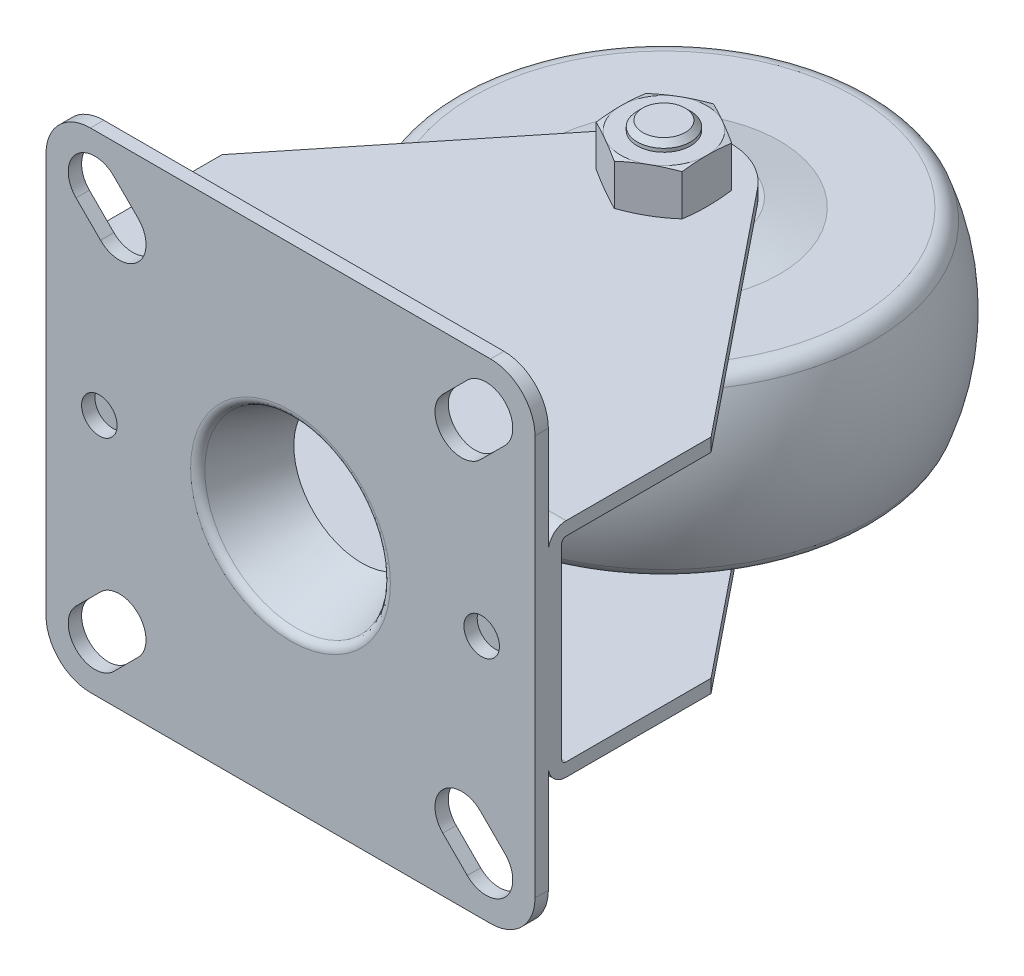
ISO-10303-21;
HEADER;
FILE_DESCRIPTION(('STEP AP214'),'2;1');
FILE_NAME('part.step','',(''),(''),'','','');
FILE_SCHEMA(('AUTOMOTIVE_DESIGN { 1 0 10303 214 1 1 1 1 }'));
ENDSEC;
DATA;
#1=APPLICATION_CONTEXT('core data for automotive mechanical design processes');
#2=APPLICATION_PROTOCOL_DEFINITION('international standard','automotive_design',2000,#1);
#3=PRODUCT_CONTEXT('',#1,'mechanical');
#4=PRODUCT('Part','Part','',(#3));
#5=PRODUCT_RELATED_PRODUCT_CATEGORY('part','',(#4));
#6=PRODUCT_DEFINITION_FORMATION('','',#4);
#7=PRODUCT_DEFINITION_CONTEXT('part definition',#1,'design');
#8=PRODUCT_DEFINITION('design','',#6,#7);
#9=PRODUCT_DEFINITION_SHAPE('','',#8);
#10=(LENGTH_UNIT() NAMED_UNIT(*) SI_UNIT(.MILLI.,.METRE.));
#11=(NAMED_UNIT(*) PLANE_ANGLE_UNIT() SI_UNIT($,.RADIAN.));
#12=(NAMED_UNIT(*) SI_UNIT($,.STERADIAN.) SOLID_ANGLE_UNIT());
#13=UNCERTAINTY_MEASURE_WITH_UNIT(LENGTH_MEASURE(1.E-05),#10,'distance_accuracy_value','');
#14=(GEOMETRIC_REPRESENTATION_CONTEXT(3) GLOBAL_UNCERTAINTY_ASSIGNED_CONTEXT((#13)) GLOBAL_UNIT_ASSIGNED_CONTEXT((#10,
#11,#12)) REPRESENTATION_CONTEXT('',''));
#15=CARTESIAN_POINT('',(0.,0.,0.));
#16=DIRECTION('',(0.,0.,1.));
#17=DIRECTION('',(1.,0.,0.));
#18=AXIS2_PLACEMENT_3D('',#15,#16,#17);
#19=CARTESIAN_POINT('',(19.2499999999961,19.25,-42.));
#20=DIRECTION('',(0.,1.,0.));
#21=DIRECTION('',(1.,0.,0.));
#22=AXIS2_PLACEMENT_3D('',#19,#20,#21);
#23=SPHERICAL_SURFACE('',#22,25.0000000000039);
#24=CARTESIAN_POINT('',(19.25,27.945652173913,-42.));
#25=DIRECTION('',(0.,1.,0.));
#26=DIRECTION('',(-1.,0.,0.));
#27=AXIS2_PLACEMENT_3D('',#24,#25,#26);
#28=CIRCLE('',#27,23.438976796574);
#29=CARTESIAN_POINT('',(42.688976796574,27.945652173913,-42.));
#30=VERTEX_POINT('',#29);
#31=EDGE_CURVE('E1514',#30,#30,#28,.T.);
#32=CARTESIAN_POINT('',(19.25,10.554347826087,-42.));
#33=DIRECTION('',(0.,1.,0.));
#34=DIRECTION('',(-1.,0.,0.));
#35=AXIS2_PLACEMENT_3D('',#32,#33,#34);
#36=CIRCLE('',#35,23.438976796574);
#37=CARTESIAN_POINT('',(42.688976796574,10.554347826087,-42.));
#38=VERTEX_POINT('',#37);
#39=EDGE_CURVE('E1511',#38,#38,#36,.T.);
#40=CARTESIAN_POINT('',(42.688976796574,27.945652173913,-42.));
#41=CARTESIAN_POINT('',(42.7533342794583,27.7721787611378,-42.));
#42=CARTESIAN_POINT('',(42.8157652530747,27.5979906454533,-42.));
#43=CARTESIAN_POINT('',(42.9367449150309,27.2482713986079,-42.));
#44=CARTESIAN_POINT('',(42.9952936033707,27.072740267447,-42.));
#45=CARTESIAN_POINT('',(43.1084794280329,26.7204213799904,-42.));
#46=CARTESIAN_POINT('',(43.1631165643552,26.5436336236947,-42.));
#47=CARTESIAN_POINT('',(43.2684524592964,26.1888886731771,-42.));
#48=CARTESIAN_POINT('',(43.3191512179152,26.0109314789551,-42.));
#49=CARTESIAN_POINT('',(43.4165853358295,25.6539353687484,-42.));
#50=CARTESIAN_POINT('',(43.4633206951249,25.4748964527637,-42.));
#51=CARTESIAN_POINT('',(43.552804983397,25.1158251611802,-42.));
#52=CARTESIAN_POINT('',(43.5955539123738,24.9357927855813,-42.));
#53=CARTESIAN_POINT('',(43.6770442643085,24.5748233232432,-42.));
#54=CARTESIAN_POINT('',(43.7157856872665,24.3938862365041,-42.));
#55=CARTESIAN_POINT('',(43.7892419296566,24.0311965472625,-42.));
#56=CARTESIAN_POINT('',(43.8239567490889,23.8494439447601,-42.));
#57=CARTESIAN_POINT('',(43.8893426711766,23.4852128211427,-42.));
#58=CARTESIAN_POINT('',(43.9200137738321,23.3027343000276,-42.));
#59=CARTESIAN_POINT('',(43.9772971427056,22.9371412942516,-42.));
#60=CARTESIAN_POINT('',(44.0039094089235,22.7540268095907,-42.));
#61=CARTESIAN_POINT('',(44.0530619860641,22.3872521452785,-42.));
#62=CARTESIAN_POINT('',(44.0756022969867,22.2035919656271,-42.));
#63=CARTESIAN_POINT('',(44.1165998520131,21.8358164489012,-42.));
#64=CARTESIAN_POINT('',(44.135057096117,21.6517011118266,-42.));
#65=CARTESIAN_POINT('',(44.1678794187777,21.2831060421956,-42.));
#66=CARTESIAN_POINT('',(44.1822444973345,21.0986263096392,-42.));
#67=CARTESIAN_POINT('',(44.2068754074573,20.7293933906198,-42.));
#68=CARTESIAN_POINT('',(44.2171412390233,20.5446402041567,-42.));
#69=CARTESIAN_POINT('',(44.2335685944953,20.1749514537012,-42.));
#70=CARTESIAN_POINT('',(44.2397301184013,19.9900158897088,-42.));
#71=CARTESIAN_POINT('',(44.2479458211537,19.6200535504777,-42.));
#72=CARTESIAN_POINT('',(44.25,19.4350267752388,-42.));
#73=CARTESIAN_POINT('',(44.25,19.0649732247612,-42.));
#74=CARTESIAN_POINT('',(44.2479458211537,18.8799464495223,-42.));
#75=CARTESIAN_POINT('',(44.2397301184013,18.5099841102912,-42.));
#76=CARTESIAN_POINT('',(44.2335685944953,18.3250485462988,-42.));
#77=CARTESIAN_POINT('',(44.2171412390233,17.9553597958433,-42.));
#78=CARTESIAN_POINT('',(44.2068754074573,17.7706066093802,-42.));
#79=CARTESIAN_POINT('',(44.1822444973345,17.4013736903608,-42.));
#80=CARTESIAN_POINT('',(44.1678794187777,17.2168939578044,-42.));
#81=CARTESIAN_POINT('',(44.135057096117,16.8482988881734,-42.));
#82=CARTESIAN_POINT('',(44.1165998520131,16.6641835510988,-42.));
#83=CARTESIAN_POINT('',(44.0756022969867,16.2964080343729,-42.));
#84=CARTESIAN_POINT('',(44.0530619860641,16.1127478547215,-42.));
#85=CARTESIAN_POINT('',(44.0039094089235,15.7459731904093,-42.));
#86=CARTESIAN_POINT('',(43.9772971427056,15.5628587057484,-42.));
#87=CARTESIAN_POINT('',(43.9200137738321,15.1972656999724,-42.));
#88=CARTESIAN_POINT('',(43.8893426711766,15.0147871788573,-42.));
#89=CARTESIAN_POINT('',(43.8239567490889,14.6505560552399,-42.));
#90=CARTESIAN_POINT('',(43.7892419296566,14.4688034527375,-42.));
#91=CARTESIAN_POINT('',(43.7157856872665,14.1061137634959,-42.));
#92=CARTESIAN_POINT('',(43.6770442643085,13.9251766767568,-42.));
#93=CARTESIAN_POINT('',(43.5955539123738,13.5642072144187,-42.));
#94=CARTESIAN_POINT('',(43.552804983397,13.3841748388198,-42.));
#95=CARTESIAN_POINT('',(43.4633206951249,13.0251035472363,-42.));
#96=CARTESIAN_POINT('',(43.4165853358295,12.8460646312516,-42.));
#97=CARTESIAN_POINT('',(43.3191512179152,12.4890685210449,-42.));
#98=CARTESIAN_POINT('',(43.2684524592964,12.3111113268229,-42.));
#99=CARTESIAN_POINT('',(43.1631165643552,11.9563663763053,-42.));
#100=CARTESIAN_POINT('',(43.1084794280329,11.7795786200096,-42.));
#101=CARTESIAN_POINT('',(42.9952936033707,11.427259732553,-42.));
#102=CARTESIAN_POINT('',(42.9367449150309,11.2517286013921,-42.));
#103=CARTESIAN_POINT('',(42.8157652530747,10.9020093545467,-42.));
#104=CARTESIAN_POINT('',(42.7533342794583,10.7278212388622,-42.));
#105=CARTESIAN_POINT('',(42.688976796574,10.554347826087,-42.));
#106=B_SPLINE_CURVE_WITH_KNOTS('',3,(#40,#41,#42,#43,#44,#45,#46,#47,#48,#49,#50,#51,#52,#53,
#54,#55,#56,#57,#58,#59,#60,#61,#62,#63,#64,#65,#66,#67,#68,#69,#70,#71,#72,#73,#74,#75,#76,#77,
#78,#79,#80,#81,#82,#83,#84,#85,#86,#87,#88,#89,#90,#91,#92,#93,#94,#95,#96,#97,#98,#99,#100,
#101,#102,#103,#104,#105),.UNSPECIFIED.,.F.,.F.,(4,2,2,2,2,2,2,2,2,2,2,2,2,2,2,2,2,2,2,2,2,2,2,
2,2,2,2,2,2,2,2,2,4),(0.,0.555068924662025,1.11013784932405,1.66520677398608,2.2202756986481,
2.77534462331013,3.33041354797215,3.88548247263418,4.4405513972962,4.99562032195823,
5.55068924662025,6.10575817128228,6.6608270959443,7.21589602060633,7.77096494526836,
8.32603386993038,8.88110279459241,9.43617171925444,9.99124064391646,10.5463095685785,
11.1013784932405,11.6564474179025,12.2115163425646,12.7665852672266,13.3216541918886,
13.8767231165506,14.4317920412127,14.9868609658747,15.5419298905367,16.0969988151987,
16.6520677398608,17.2071366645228,17.7622055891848),.UNSPECIFIED.);
#107=EDGE_CURVE('BSEAM14',#30,#38,#106,.T.);
#108=ORIENTED_EDGE('',*,*,#31,.F.);
#109=ORIENTED_EDGE('',*,*,#39,.T.);
#110=ORIENTED_EDGE('',*,*,#107,.T.);
#111=ORIENTED_EDGE('',*,*,#107,.F.);
#112=EDGE_LOOP('',(#108,#110,#109,#111));
#113=FACE_BOUND('',#112,.T.);
#114=ADVANCED_FACE('F14',(#113),#23,.T.);
#115=CARTESIAN_POINT('',(19.25,11.2500000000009,-42.));
#116=DIRECTION('',(0.,1.,0.));
#117=DIRECTION('',(-1.,0.,0.));
#118=AXIS2_PLACEMENT_3D('',#115,#116,#117);
#119=TOROIDAL_SURFACE('',#118,21.5638586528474,2.00000000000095);
#120=ORIENTED_EDGE('',*,*,#39,.F.);
#121=EDGE_LOOP('',(#120));
#122=FACE_BOUND('',#121,.T.);
#123=CARTESIAN_POINT('',(19.25,9.25,-42.));
#124=DIRECTION('',(0.,1.,0.));
#125=DIRECTION('',(-1.,0.,0.));
#126=AXIS2_PLACEMENT_3D('',#123,#124,#125);
#127=CIRCLE('',#126,21.563858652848);
#128=CARTESIAN_POINT('',(-2.313858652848,9.25,-42.));
#129=VERTEX_POINT('',#128);
#130=EDGE_CURVE('E1505',#129,#129,#127,.T.);
#131=ORIENTED_EDGE('',*,*,#130,.T.);
#132=EDGE_LOOP('',(#131));
#133=FACE_BOUND('',#132,.T.);
#134=ADVANCED_FACE('F1187',(#122,#133),#119,.T.);
#135=CARTESIAN_POINT('',(27.25,8.25,-42.));
#136=DIRECTION('',(0.,1.,0.));
#137=DIRECTION('',(-1.,0.,0.));
#138=AXIS2_PLACEMENT_3D('',#135,#136,#137);
#139=PLANE('',#138);
#140=CARTESIAN_POINT('',(19.25,8.25,-42.));
#141=DIRECTION('',(0.,1.,0.));
#142=DIRECTION('',(-1.,0.,0.));
#143=AXIS2_PLACEMENT_3D('',#140,#141,#142);
#144=CIRCLE('',#143,8.);
#145=CARTESIAN_POINT('',(26.8378722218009,8.25,-44.5345996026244));
#146=VERTEX_POINT('',#145);
#147=CARTESIAN_POINT('',(11.6621277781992,8.25,-44.5345996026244));
#148=VERTEX_POINT('',#147);
#149=EDGE_CURVE('E1499',#146,#148,#144,.T.);
#150=ORIENTED_EDGE('',*,*,#149,.F.);
#151=DIRECTION('',(-0.627081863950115,0.,-0.778953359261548));
#152=VECTOR('',#151,1.);
#153=CARTESIAN_POINT('',(28.2380035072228,8.25,-42.7953737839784));
#154=LINE('',#153,#152);
#155=CARTESIAN_POINT('',(25.0921501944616,8.25,-46.7031139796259));
#156=VERTEX_POINT('',#155);
#157=EDGE_CURVE('E9',#146,#156,#154,.T.);
#158=ORIENTED_EDGE('',*,*,#157,.T.);
#159=CARTESIAN_POINT('',(19.25,8.25,-42.));
#160=DIRECTION('',(0.,1.,0.));
#161=DIRECTION('',(-1.,0.,0.));
#162=AXIS2_PLACEMENT_3D('',#159,#160,#161);
#163=CIRCLE('',#162,7.5);
#164=CARTESIAN_POINT('',(13.4078498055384,8.25,-46.7031139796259));
#165=VERTEX_POINT('',#164);
#166=EDGE_CURVE('E30',#156,#165,#163,.T.);
#167=ORIENTED_EDGE('',*,*,#166,.T.);
#168=DIRECTION('',(-0.627081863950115,0.,0.778953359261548));
#169=VECTOR('',#168,1.);
#170=CARTESIAN_POINT('',(16.5537031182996,8.25,-50.6108541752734));
#171=LINE('',#170,#169);
#172=EDGE_CURVE('E470',#165,#148,#171,.T.);
#173=ORIENTED_EDGE('',*,*,#172,.T.);
#174=EDGE_LOOP('',(#150,#158,#167,#173));
#175=FACE_BOUND('',#174,.T.);
#176=ADVANCED_FACE('F1011',(#175),#139,.F.);
#177=CARTESIAN_POINT('',(40.813858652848,9.25,-42.));
#178=DIRECTION('',(0.,1.,0.));
#179=DIRECTION('',(-1.,0.,0.));
#180=AXIS2_PLACEMENT_3D('',#177,#178,#179);
#181=PLANE('',#180);
#182=ORIENTED_EDGE('',*,*,#130,.F.);
#183=EDGE_LOOP('',(#182));
#184=FACE_BOUND('',#183,.T.);
#185=CARTESIAN_POINT('',(19.25,9.25,-42.));
#186=DIRECTION('',(0.,1.,0.));
#187=DIRECTION('',(-1.,0.,0.));
#188=AXIS2_PLACEMENT_3D('',#185,#186,#187);
#189=CIRCLE('',#188,13.);
#190=CARTESIAN_POINT('',(6.25,9.25,-42.));
#191=VERTEX_POINT('',#190);
#192=EDGE_CURVE('E1502',#191,#191,#189,.T.);
#193=ORIENTED_EDGE('',*,*,#192,.T.);
#194=EDGE_LOOP('',(#193));
#195=FACE_BOUND('',#194,.T.);
#196=ADVANCED_FACE('F1479',(#184,#195),#181,.F.);
#197=CARTESIAN_POINT('',(19.25,8.25,-42.));
#198=DIRECTION('',(0.,1.,0.));
#199=DIRECTION('',(-1.,0.,0.));
#200=AXIS2_PLACEMENT_3D('',#197,#198,#199);
#201=CONICAL_SURFACE('',#200,8.,1.37340076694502);
#202=ORIENTED_EDGE('',*,*,#192,.F.);
#203=EDGE_LOOP('',(#202));
#204=FACE_BOUND('',#203,.T.);
#205=ORIENTED_EDGE('',*,*,#149,.T.);
#206=EDGE_CURVE('E433',#148,#146,#144,.T.);
#207=ORIENTED_EDGE('',*,*,#206,.T.);
#208=EDGE_LOOP('',(#205,#207));
#209=FACE_BOUND('',#208,.T.);
#210=ADVANCED_FACE('F1204',(#204,#209),#201,.T.);
#211=CARTESIAN_POINT('',(19.25,27.249999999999,-42.));
#212=DIRECTION('',(0.,1.,0.));
#213=DIRECTION('',(-1.,0.,0.));
#214=AXIS2_PLACEMENT_3D('',#211,#212,#213);
#215=TOROIDAL_SURFACE('',#214,21.5638586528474,2.00000000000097);
#216=CARTESIAN_POINT('',(19.25,29.25,-42.));
#217=DIRECTION('',(0.,1.,0.));
#218=DIRECTION('',(-1.,0.,0.));
#219=AXIS2_PLACEMENT_3D('',#216,#217,#218);
#220=CIRCLE('',#219,21.563858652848);
#221=CARTESIAN_POINT('',(-2.313858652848,29.25,-42.));
#222=VERTEX_POINT('',#221);
#223=EDGE_CURVE('E904',#222,#222,#220,.T.);
#224=ORIENTED_EDGE('',*,*,#223,.F.);
#225=EDGE_LOOP('',(#224));
#226=FACE_BOUND('',#225,.T.);
#227=ORIENTED_EDGE('',*,*,#31,.T.);
#228=EDGE_LOOP('',(#227));
#229=FACE_BOUND('',#228,.T.);
#230=ADVANCED_FACE('F1200',(#226,#229),#215,.T.);
#231=CARTESIAN_POINT('',(32.25,29.25,-42.));
#232=DIRECTION('',(0.,-1.,0.));
#233=DIRECTION('',(1.,0.,0.));
#234=AXIS2_PLACEMENT_3D('',#231,#232,#233);
#235=PLANE('',#234);
#236=CARTESIAN_POINT('',(19.25,29.25,-42.));
#237=DIRECTION('',(0.,1.,0.));
#238=DIRECTION('',(-1.,0.,0.));
#239=AXIS2_PLACEMENT_3D('',#236,#237,#238);
#240=CIRCLE('',#239,13.);
#241=CARTESIAN_POINT('',(6.25,29.25,-42.));
#242=VERTEX_POINT('',#241);
#243=EDGE_CURVE('E901',#242,#242,#240,.T.);
#244=ORIENTED_EDGE('',*,*,#243,.F.);
#245=EDGE_LOOP('',(#244));
#246=FACE_BOUND('',#245,.T.);
#247=ORIENTED_EDGE('',*,*,#223,.T.);
#248=EDGE_LOOP('',(#247));
#249=FACE_BOUND('',#248,.T.);
#250=ADVANCED_FACE('F1203',(#246,#249),#235,.F.);
#251=CARTESIAN_POINT('',(22.25,30.25,-42.));
#252=DIRECTION('',(0.,-1.,0.));
#253=DIRECTION('',(1.,0.,0.));
#254=AXIS2_PLACEMENT_3D('',#251,#252,#253);
#255=PLANE('',#254);
#256=CARTESIAN_POINT('',(19.25,30.25,-42.));
#257=DIRECTION('',(0.,1.,0.));
#258=DIRECTION('',(-1.,0.,0.));
#259=AXIS2_PLACEMENT_3D('',#256,#257,#258);
#260=CIRCLE('',#259,8.);
#261=CARTESIAN_POINT('',(26.8378722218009,30.25,-44.5345996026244));
#262=VERTEX_POINT('',#261);
#263=CARTESIAN_POINT('',(11.6621277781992,30.25,-44.5345996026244));
#264=VERTEX_POINT('',#263);
#265=EDGE_CURVE('E467',#262,#264,#260,.T.);
#266=ORIENTED_EDGE('',*,*,#265,.T.);
#267=DIRECTION('',(0.627081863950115,0.,-0.778953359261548));
#268=VECTOR('',#267,1.);
#269=CARTESIAN_POINT('',(14.5875447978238,30.25,-48.1685165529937));
#270=LINE('',#269,#268);
#271=CARTESIAN_POINT('',(13.4078498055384,30.25,-46.7031139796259));
#272=VERTEX_POINT('',#271);
#273=EDGE_CURVE('E460',#264,#272,#270,.T.);
#274=ORIENTED_EDGE('',*,*,#273,.T.);
#275=CARTESIAN_POINT('',(19.25,30.25,-42.));
#276=DIRECTION('',(0.,-1.,0.));
#277=DIRECTION('',(1.,0.,0.));
#278=AXIS2_PLACEMENT_3D('',#275,#276,#277);
#279=CIRCLE('',#278,7.5);
#280=CARTESIAN_POINT('',(25.0921501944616,30.25,-46.7031139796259));
#281=VERTEX_POINT('',#280);
#282=EDGE_CURVE('E450',#272,#281,#279,.T.);
#283=ORIENTED_EDGE('',*,*,#282,.T.);
#284=DIRECTION('',(0.627081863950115,0.,0.778953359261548));
#285=VECTOR('',#284,1.);
#286=CARTESIAN_POINT('',(26.2718451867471,30.25,-45.2377114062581));
#287=LINE('',#286,#285);
#288=EDGE_CURVE('E461',#281,#262,#287,.T.);
#289=ORIENTED_EDGE('',*,*,#288,.T.);
#290=EDGE_LOOP('',(#266,#274,#283,#289));
#291=FACE_BOUND('',#290,.T.);
#292=ADVANCED_FACE('F465',(#291),#255,.F.);
#293=CARTESIAN_POINT('',(19.25,29.25,-42.));
#294=DIRECTION('',(0.,-1.,0.));
#295=DIRECTION('',(1.,0.,0.));
#296=AXIS2_PLACEMENT_3D('',#293,#294,#295);
#297=CONICAL_SURFACE('',#296,13.,1.37340076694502);
#298=ORIENTED_EDGE('',*,*,#265,.F.);
#299=EDGE_CURVE('E899',#264,#262,#260,.T.);
#300=ORIENTED_EDGE('',*,*,#299,.F.);
#301=EDGE_LOOP('',(#298,#300));
#302=FACE_BOUND('',#301,.T.);
#303=ORIENTED_EDGE('',*,*,#243,.T.);
#304=EDGE_LOOP('',(#303));
#305=FACE_BOUND('',#304,.T.);
#306=ADVANCED_FACE('F1152',(#302,#305),#297,.T.);
#307=CARTESIAN_POINT('',(19.25,37.75,-39.6135));
#308=DIRECTION('',(0.,-1.,0.));
#309=DIRECTION('',(1.,0.,0.));
#310=AXIS2_PLACEMENT_3D('',#307,#308,#309);
#311=PLANE('',#310);
#312=CARTESIAN_POINT('',(19.25,37.75,-42.));
#313=DIRECTION('',(0.,-1.,0.));
#314=DIRECTION('',(1.,0.,0.));
#315=AXIS2_PLACEMENT_3D('',#312,#313,#314);
#316=CIRCLE('',#315,2.3865);
#317=CARTESIAN_POINT('',(21.6365,37.75,-42.));
#318=VERTEX_POINT('',#317);
#319=EDGE_CURVE('E1761',#318,#318,#316,.T.);
#320=ORIENTED_EDGE('',*,*,#319,.F.);
#321=EDGE_LOOP('',(#320));
#322=FACE_BOUND('',#321,.T.);
#323=ADVANCED_FACE('F952',(#322),#311,.F.);
#324=CARTESIAN_POINT('',(19.25,37.75,-42.));
#325=DIRECTION('',(0.,-1.,0.));
#326=DIRECTION('',(1.,0.,0.));
#327=AXIS2_PLACEMENT_3D('',#324,#325,#326);
#328=CONICAL_SURFACE('',#327,2.3865,0.785398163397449);
#329=CARTESIAN_POINT('',(19.25,37.1365,-42.));
#330=DIRECTION('',(0.,-1.,0.));
#331=DIRECTION('',(1.,0.,0.));
#332=AXIS2_PLACEMENT_3D('',#329,#330,#331);
#333=CIRCLE('',#332,3.);
#334=CARTESIAN_POINT('',(22.25,37.1365,-42.));
#335=VERTEX_POINT('',#334);
#336=EDGE_CURVE('E1759',#335,#335,#333,.T.);
#337=ORIENTED_EDGE('',*,*,#336,.F.);
#338=EDGE_LOOP('',(#337));
#339=FACE_BOUND('',#338,.T.);
#340=ORIENTED_EDGE('',*,*,#319,.T.);
#341=EDGE_LOOP('',(#340));
#342=FACE_BOUND('',#341,.T.);
#343=ADVANCED_FACE('F1151',(#339,#342),#328,.T.);
#344=CARTESIAN_POINT('',(19.25,2.25,-42.));
#345=DIRECTION('',(0.,1.,0.));
#346=DIRECTION('',(-1.,0.,0.));
#347=AXIS2_PLACEMENT_3D('',#344,#345,#346);
#348=PLANE('',#347);
#349=CARTESIAN_POINT('',(19.25,2.25,-42.));
#350=DIRECTION('',(0.,-1.,0.));
#351=DIRECTION('',(1.,0.,0.));
#352=AXIS2_PLACEMENT_3D('',#349,#350,#351);
#353=CIRCLE('',#352,4.8333333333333);
#354=CARTESIAN_POINT('',(24.0833333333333,2.25,-42.));
#355=VERTEX_POINT('',#354);
#356=CARTESIAN_POINT('',(21.6666666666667,2.25,-37.8142105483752));
#357=VERTEX_POINT('',#356);
#358=EDGE_CURVE('E1751',#355,#357,#353,.T.);
#359=ORIENTED_EDGE('',*,*,#358,.T.);
#360=CARTESIAN_POINT('',(16.8333333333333,2.25,-37.8142105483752));
#361=VERTEX_POINT('',#360);
#362=EDGE_CURVE('E1754',#357,#361,#353,.T.);
#363=ORIENTED_EDGE('',*,*,#362,.T.);
#364=CARTESIAN_POINT('',(14.4166666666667,2.25,-42.));
#365=VERTEX_POINT('',#364);
#366=EDGE_CURVE('E1774',#361,#365,#353,.T.);
#367=ORIENTED_EDGE('',*,*,#366,.T.);
#368=CARTESIAN_POINT('',(16.8333333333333,2.25,-46.1857894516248));
#369=VERTEX_POINT('',#368);
#370=EDGE_CURVE('E1779',#365,#369,#353,.T.);
#371=ORIENTED_EDGE('',*,*,#370,.T.);
#372=CARTESIAN_POINT('',(21.6666666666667,2.25,-46.1857894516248));
#373=VERTEX_POINT('',#372);
#374=EDGE_CURVE('E1782',#369,#373,#353,.T.);
#375=ORIENTED_EDGE('',*,*,#374,.T.);
#376=EDGE_CURVE('E1755',#373,#355,#353,.T.);
#377=ORIENTED_EDGE('',*,*,#376,.T.);
#378=EDGE_LOOP('',(#359,#363,#367,#371,#375,#377));
#379=FACE_BOUND('',#378,.T.);
#380=ADVANCED_FACE('F810',(#379),#348,.F.);
#381=CARTESIAN_POINT('',(19.25,37.75,-42.));
#382=DIRECTION('',(0.,-1.,0.));
#383=DIRECTION('',(1.,0.,0.));
#384=AXIS2_PLACEMENT_3D('',#381,#382,#383);
#385=CYLINDRICAL_SURFACE('',#384,3.);
#386=ORIENTED_EDGE('',*,*,#336,.T.);
#387=EDGE_LOOP('',(#386));
#388=FACE_BOUND('',#387,.T.);
#389=CARTESIAN_POINT('',(19.25,36.75,-42.));
#390=DIRECTION('',(0.,-1.,0.));
#391=DIRECTION('',(1.,0.,0.));
#392=AXIS2_PLACEMENT_3D('',#389,#390,#391);
#393=CIRCLE('',#392,3.);
#394=CARTESIAN_POINT('',(22.25,36.75,-42.));
#395=VERTEX_POINT('',#394);
#396=EDGE_CURVE('E1589',#395,#395,#393,.T.);
#397=ORIENTED_EDGE('',*,*,#396,.F.);
#398=EDGE_LOOP('',(#397));
#399=FACE_BOUND('',#398,.T.);
#400=ADVANCED_FACE('F1157',(#388,#399),#385,.T.);
#401=CARTESIAN_POINT('',(19.25,2.509017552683,-42.));
#402=DIRECTION('',(0.,1.,0.));
#403=DIRECTION('',(-1.,0.,0.));
#404=AXIS2_PLACEMENT_3D('',#401,#402,#403);
#405=CONICAL_SURFACE('',#404,5.8,1.30899693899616);
#406=ORIENTED_EDGE('',*,*,#374,.F.);
#407=CARTESIAN_POINT('',(12.4249635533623,2.8357694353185,-43.6406159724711));
#408=CARTESIAN_POINT('',(12.6013723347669,2.79620732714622,-43.7424656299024));
#409=CARTESIAN_POINT('',(12.7779630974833,2.75769432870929,-43.8444203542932));
#410=CARTESIAN_POINT('',(13.1315874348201,2.68331941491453,-44.0485854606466));
#411=CARTESIAN_POINT('',(13.3086210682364,2.64745787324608,-44.1507958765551));
#412=CARTESIAN_POINT('',(13.6635917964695,2.57886682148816,-44.3557383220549));
#413=CARTESIAN_POINT('',(13.8415300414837,2.54614514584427,-44.458471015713));
#414=CARTESIAN_POINT('',(14.1979035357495,2.48463124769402,-44.6642233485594));
#415=CARTESIAN_POINT('',(14.3763387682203,2.45583889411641,-44.7672429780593));
#416=CARTESIAN_POINT('',(14.9079006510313,2.37722564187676,-45.0741403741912));
#417=CARTESIAN_POINT('',(15.2618464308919,2.33424831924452,-45.2784910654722));
#418=CARTESIAN_POINT('',(15.7937468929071,2.28830387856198,-45.5855839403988));
#419=CARTESIAN_POINT('',(15.9711142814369,2.27607760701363,-45.6879870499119));
#420=CARTESIAN_POINT('',(16.3261062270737,2.25834927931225,-45.8929417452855));
#421=CARTESIAN_POINT('',(16.5037307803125,2.25284712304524,-45.9954933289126));
#422=CARTESIAN_POINT('',(16.8592133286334,2.24885697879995,-46.2007312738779));
#423=CARTESIAN_POINT('',(17.0370713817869,2.25037587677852,-46.3034176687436));
#424=CARTESIAN_POINT('',(17.3926407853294,2.26036120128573,-46.5087057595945));
#425=CARTESIAN_POINT('',(17.5703521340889,2.26882770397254,-46.6113074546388));
#426=CARTESIAN_POINT('',(17.9256505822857,2.29229147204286,-46.8164391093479));
#427=CARTESIAN_POINT('',(18.1032373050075,2.3072962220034,-46.9189688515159));
#428=CARTESIAN_POINT('',(18.457961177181,2.34315904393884,-47.1237687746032));
#429=CARTESIAN_POINT('',(18.6350983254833,2.36401713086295,-47.226038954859));
#430=CARTESIAN_POINT('',(18.991126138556,2.41109229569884,-47.4315917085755));
#431=CARTESIAN_POINT('',(19.1700102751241,2.43737446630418,-47.5348705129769));
#432=CARTESIAN_POINT('',(19.5272594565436,2.49430714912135,-47.7411284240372));
#433=CARTESIAN_POINT('',(19.7056244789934,2.52495784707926,-47.8441075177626));
#434=CARTESIAN_POINT('',(20.0614468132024,2.58979391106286,-48.0495416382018));
#435=CARTESIAN_POINT('',(20.238905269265,2.62397098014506,-48.1519973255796));
#436=CARTESIAN_POINT('',(20.5933445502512,2.69529212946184,-48.3566329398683));
#437=CARTESIAN_POINT('',(20.7703254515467,2.73243570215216,-48.4588129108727));
#438=CARTESIAN_POINT('',(20.9471067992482,2.7707556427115,-48.5608776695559));
#439=B_SPLINE_CURVE_WITH_KNOTS('',3,(#407,#408,#409,#410,#411,#412,#413,#414,#415,#416,#417,
#418,#419,#420,#421,#422,#423,#424,#425,#426,#427,#428,#429,#430,#431,#432,#433,#434,#435,#436,
#437,#438),.UNSPECIFIED.,.F.,.F.,(4,2,2,2,2,2,2,2,2,2,2,2,2,2,2,4),(0.,0.622522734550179,
1.24513303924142,1.86925851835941,2.49336317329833,3.72553733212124,4.34095766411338,
4.95636883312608,5.57238369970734,6.18840531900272,6.8051339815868,7.42186421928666,
8.04647773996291,8.67111782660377,9.29432038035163,9.91741653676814),.UNSPECIFIED.);
#440=CARTESIAN_POINT('',(19.25,2.4503507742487,-47.5810526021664));
#441=VERTEX_POINT('',#440);
#442=EDGE_CURVE('E1118',#369,#441,#439,.T.);
#443=ORIENTED_EDGE('',*,*,#442,.T.);
#444=CARTESIAN_POINT('',(15.2240457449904,3.33203484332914,-49.9054383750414));
#445=CARTESIAN_POINT('',(15.4224829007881,3.28056580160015,-49.7908706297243));
#446=CARTESIAN_POINT('',(15.6210476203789,3.22973970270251,-49.676229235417));
#447=CARTESIAN_POINT('',(16.0184990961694,3.12974105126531,-49.4467605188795));
#448=CARTESIAN_POINT('',(16.2173858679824,3.08056858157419,-49.3319331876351));
#449=CARTESIAN_POINT('',(16.6158916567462,2.98416222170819,-49.1018557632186));
#450=CARTESIAN_POINT('',(16.8155113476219,2.93693203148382,-48.986605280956));
#451=CARTESIAN_POINT('',(17.2151884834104,2.84501105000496,-48.7558515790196));
#452=CARTESIAN_POINT('',(17.4152459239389,2.800320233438,-48.640348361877));
#453=CARTESIAN_POINT('',(17.8133684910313,2.71465481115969,-48.4104921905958));
#454=CARTESIAN_POINT('',(18.0114272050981,2.67364068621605,-48.2961429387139));
#455=CARTESIAN_POINT('',(18.4081157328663,2.5954849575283,-48.0671147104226));
#456=CARTESIAN_POINT('',(18.6067455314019,2.5583432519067,-47.952435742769));
#457=CARTESIAN_POINT('',(19.0045008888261,2.48889985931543,-47.7227915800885));
#458=CARTESIAN_POINT('',(19.2036259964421,2.4565947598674,-47.6078266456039));
#459=CARTESIAN_POINT('',(19.6025353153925,2.39788641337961,-47.3775162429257));
#460=CARTESIAN_POINT('',(19.8023195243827,2.37148314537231,-47.2621707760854));
#461=CARTESIAN_POINT('',(20.2045156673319,2.32550962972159,-47.0299627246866));
#462=CARTESIAN_POINT('',(20.4069338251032,2.30601075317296,-46.9130965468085));
#463=CARTESIAN_POINT('',(20.8122466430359,2.27530838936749,-46.679089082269));
#464=CARTESIAN_POINT('',(21.0151412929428,2.26410472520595,-46.5619478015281));
#465=CARTESIAN_POINT('',(21.421249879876,2.25071950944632,-46.3274808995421));
#466=CARTESIAN_POINT('',(21.6244639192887,2.24854200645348,-46.210155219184));
#467=CARTESIAN_POINT('',(22.0308037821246,2.25337250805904,-45.9755547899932));
#468=CARTESIAN_POINT('',(22.2339296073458,2.26038031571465,-45.8582800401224));
#469=CARTESIAN_POINT('',(22.6420852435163,2.28323059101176,-45.6226312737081));
#470=CARTESIAN_POINT('',(22.8471108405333,2.29917131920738,-45.5042596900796));
#471=CARTESIAN_POINT('',(23.2566029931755,2.33897320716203,-45.2678392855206));
#472=CARTESIAN_POINT('',(23.4610694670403,2.36283546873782,-45.1497905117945));
#473=CARTESIAN_POINT('',(23.8693255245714,2.41725453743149,-44.9140837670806));
#474=CARTESIAN_POINT('',(24.0731150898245,2.44781152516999,-44.7964258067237));
#475=CARTESIAN_POINT('',(24.4799376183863,2.51442045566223,-44.5615467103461));
#476=CARTESIAN_POINT('',(24.6829708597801,2.55047012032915,-44.444325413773));
#477=CARTESIAN_POINT('',(24.8856731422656,2.5886798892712,-44.3272951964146));
#478=B_SPLINE_CURVE_WITH_KNOTS('',3,(#444,#445,#446,#447,#448,#449,#450,#451,#452,#453,#454,
#455,#456,#457,#458,#459,#460,#461,#462,#463,#464,#465,#466,#467,#468,#469,#470,#471,#472,#473,
#474,#475,#476,#477),.UNSPECIFIED.,.F.,.F.,(4,2,2,2,2,2,2,2,2,2,2,2,2,2,2,2,4),(0.,
0.704538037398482,1.40911132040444,2.11496987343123,2.82082138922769,3.51783630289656,
4.2148328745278,4.91133533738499,5.60783532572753,6.31133820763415,7.01482608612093,
7.71862947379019,8.42241777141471,9.13410402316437,9.84588930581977,10.5576937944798,
11.2692038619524),.UNSPECIFIED.);
#479=EDGE_CURVE('E1116',#441,#373,#478,.T.);
#480=ORIENTED_EDGE('',*,*,#479,.T.);
#481=EDGE_LOOP('',(#406,#443,#480));
#482=FACE_BOUND('',#481,.T.);
#483=ADVANCED_FACE('F1160',(#482),#405,.T.);
#484=ORIENTED_EDGE('',*,*,#376,.F.);
#485=CARTESIAN_POINT('',(24.0833333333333,2.4503507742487,-44.7905263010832));
#486=VERTEX_POINT('',#485);
#487=EDGE_CURVE('E1109',#373,#486,#478,.T.);
#488=ORIENTED_EDGE('',*,*,#487,.T.);
#489=CARTESIAN_POINT('',(24.0833333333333,3.3191691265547,-49.3819722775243));
#490=CARTESIAN_POINT('',(24.0833333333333,3.27002699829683,-49.1626978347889));
#491=CARTESIAN_POINT('',(24.0833333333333,3.2214858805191,-48.9432862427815));
#492=CARTESIAN_POINT('',(24.0833333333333,3.12593007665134,-48.5041214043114));
#493=CARTESIAN_POINT('',(24.0833333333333,3.07891545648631,-48.2843681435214));
#494=CARTESIAN_POINT('',(24.0833333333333,2.98669614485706,-47.8442557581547));
#495=CARTESIAN_POINT('',(24.0833333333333,2.9414932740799,-47.6238962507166));
#496=CARTESIAN_POINT('',(24.0833333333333,2.85338537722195,-47.1827185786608));
#497=CARTESIAN_POINT('',(24.0833333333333,2.81048033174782,-46.9619004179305));
#498=CARTESIAN_POINT('',(24.0833333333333,2.72784592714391,-46.5214867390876));
#499=CARTESIAN_POINT('',(24.0833333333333,2.68809401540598,-46.3018954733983));
#500=CARTESIAN_POINT('',(24.0833333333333,2.61206073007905,-45.8621139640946));
#501=CARTESIAN_POINT('',(24.0833333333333,2.57577928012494,-45.6419237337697));
#502=CARTESIAN_POINT('',(24.0833333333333,2.50750382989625,-45.2009015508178));
#503=CARTESIAN_POINT('',(24.0833333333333,2.47550930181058,-44.9800696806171));
#504=CARTESIAN_POINT('',(24.0833333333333,2.41675052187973,-44.5377032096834));
#505=CARTESIAN_POINT('',(24.0833333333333,2.38998627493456,-44.3161686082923));
#506=CARTESIAN_POINT('',(24.0833333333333,2.342445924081,-43.8698973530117));
#507=CARTESIAN_POINT('',(24.0833333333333,2.32174144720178,-43.645152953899));
#508=CARTESIAN_POINT('',(24.0833333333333,2.28774894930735,-43.195099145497));
#509=CARTESIAN_POINT('',(24.0833333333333,2.27446075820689,-42.9697897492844));
#510=CARTESIAN_POINT('',(24.0833333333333,2.25607584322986,-42.5189327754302));
#511=CARTESIAN_POINT('',(24.0833333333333,2.25097539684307,-42.2933853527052));
#512=CARTESIAN_POINT('',(24.0833333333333,2.24927959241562,-41.8422580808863));
#513=CARTESIAN_POINT('',(24.0833333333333,2.25268422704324,-41.6166782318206));
#514=CARTESIAN_POINT('',(24.0833333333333,2.26780698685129,-41.1649821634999));
#515=CARTESIAN_POINT('',(24.0833333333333,2.27955528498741,-40.9388669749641));
#516=CARTESIAN_POINT('',(24.0833333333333,2.31069525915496,-40.4871685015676));
#517=CARTESIAN_POINT('',(24.0833333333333,2.33008710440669,-40.2615852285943));
#518=CARTESIAN_POINT('',(24.0833333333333,2.37553276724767,-39.8109518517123));
#519=CARTESIAN_POINT('',(24.0833333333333,2.40159093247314,-39.5859021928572));
#520=CARTESIAN_POINT('',(24.0833333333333,2.45929190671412,-39.136529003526));
#521=CARTESIAN_POINT('',(24.0833333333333,2.49093473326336,-38.912205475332));
#522=CARTESIAN_POINT('',(24.0833333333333,2.58818999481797,-38.2699454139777));
#523=CARTESIAN_POINT('',(24.0833333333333,2.65945765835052,-37.8528694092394));
#524=CARTESIAN_POINT('',(24.0833333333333,2.81254866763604,-37.020659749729));
#525=CARTESIAN_POINT('',(24.0833333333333,2.8943733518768,-36.6055263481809));
#526=CARTESIAN_POINT('',(24.0833333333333,3.06510972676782,-35.7766255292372));
#527=CARTESIAN_POINT('',(24.0833333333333,3.1540231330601,-35.3628584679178));
#528=CARTESIAN_POINT('',(24.0833333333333,3.33667222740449,-34.5364238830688));
#529=CARTESIAN_POINT('',(24.0833333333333,3.43040763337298,-34.1237562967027));
#530=CARTESIAN_POINT('',(24.0833333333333,3.62032945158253,-33.3032596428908));
#531=CARTESIAN_POINT('',(24.0833333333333,3.71648272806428,-32.8954228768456));
#532=CARTESIAN_POINT('',(24.0833333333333,3.91119713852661,-32.0803182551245));
#533=CARTESIAN_POINT('',(24.0833333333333,4.00975831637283,-31.6730504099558));
#534=CARTESIAN_POINT('',(24.0833333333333,4.20853642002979,-30.8594524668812));
#535=CARTESIAN_POINT('',(24.0833333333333,4.30875115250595,-30.4531218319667));
#536=CARTESIAN_POINT('',(24.0833333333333,4.51054902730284,-29.6408145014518));
#537=CARTESIAN_POINT('',(24.0833333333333,4.61213212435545,-29.2348377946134));
#538=CARTESIAN_POINT('',(24.0833333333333,4.71419989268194,-28.8289844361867));
#539=B_SPLINE_CURVE_WITH_KNOTS('',3,(#489,#490,#491,#492,#493,#494,#495,#496,#497,#498,#499,
#500,#501,#502,#503,#504,#505,#506,#507,#508,#509,#510,#511,#512,#513,#514,#515,#516,#517,#518,
#519,#520,#521,#522,#523,#524,#525,#526,#527,#528,#529,#530,#531,#532,#533,#534,#535,#536,#537,
#538),.UNSPECIFIED.,.F.,.F.,(4,2,2,2,2,2,2,2,2,2,2,2,2,2,2,2,2,2,2,2,2,2,2,2,4),(0.,
0.674143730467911,1.3483165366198,2.02315067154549,2.69797911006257,3.36743789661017,
4.03688194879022,4.70624350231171,5.3756056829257,6.05258681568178,6.72955242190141,
7.40621016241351,8.08286731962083,8.76198399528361,9.44111570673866,10.1206914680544,
10.8002693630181,12.0693940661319,13.3386798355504,14.6082737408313,15.8777934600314,
17.1348382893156,18.391906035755,19.6474225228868,20.9028975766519),.UNSPECIFIED.);
#540=EDGE_CURVE('E1117',#486,#355,#539,.T.);
#541=ORIENTED_EDGE('',*,*,#540,.T.);
#542=EDGE_LOOP('',(#484,#488,#541));
#543=FACE_BOUND('',#542,.T.);
#544=ADVANCED_FACE('F1096',(#543),#405,.T.);
#545=ORIENTED_EDGE('',*,*,#358,.F.);
#546=CARTESIAN_POINT('',(24.0833333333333,2.4503507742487,-39.2094736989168));
#547=VERTEX_POINT('',#546);
#548=EDGE_CURVE('E1080',#355,#547,#539,.T.);
#549=ORIENTED_EDGE('',*,*,#548,.T.);
#550=CARTESIAN_POINT('',(25.7800500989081,2.77067105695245,-40.18907358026));
#551=CARTESIAN_POINT('',(25.603267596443,2.73235271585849,-40.0870081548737));
#552=CARTESIAN_POINT('',(25.4262855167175,2.69521093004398,-39.9848275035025));
#553=CARTESIAN_POINT('',(25.0718438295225,2.62389381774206,-39.7801904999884));
#554=CARTESIAN_POINT('',(24.8943841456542,2.58971899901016,-39.6777341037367));
#555=CARTESIAN_POINT('',(24.5385593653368,2.52488800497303,-39.4722985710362));
#556=CARTESIAN_POINT('',(24.3601931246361,2.49424012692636,-39.3693187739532));
#557=CARTESIAN_POINT('',(24.0029414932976,2.43731372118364,-39.1630594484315));
#558=CARTESIAN_POINT('',(23.8240561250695,2.41103500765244,-39.059779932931));
#559=CARTESIAN_POINT('',(23.4680258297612,2.36396738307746,-38.8542257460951));
#560=CARTESIAN_POINT('',(23.2908874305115,2.34311337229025,-38.7519548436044));
#561=CARTESIAN_POINT('',(22.9361611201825,2.30725934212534,-38.5471535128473));
#562=CARTESIAN_POINT('',(22.7585732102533,2.29225930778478,-38.4446230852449));
#563=CARTESIAN_POINT('',(22.4032724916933,2.26880547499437,-38.239490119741));
#564=CARTESIAN_POINT('',(22.2255600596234,2.26034419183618,-38.1368877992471));
#565=CARTESIAN_POINT('',(21.8699886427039,2.25036958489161,-37.9315985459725));
#566=CARTESIAN_POINT('',(21.6921296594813,2.24885618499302,-37.8289116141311));
#567=CARTESIAN_POINT('',(21.3366458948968,2.2528572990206,-37.6236729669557));
#568=CARTESIAN_POINT('',(21.1590210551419,2.25836490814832,-37.5211212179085));
#569=CARTESIAN_POINT('',(20.8040286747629,2.27610382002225,-37.3161662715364));
#570=CARTESIAN_POINT('',(20.62666113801,2.28833522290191,-37.2137630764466));
#571=CARTESIAN_POINT('',(20.0947603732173,2.33429426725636,-36.9066700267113));
#572=CARTESIAN_POINT('',(19.7408145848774,2.37728025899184,-36.7023193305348));
#573=CARTESIAN_POINT('',(19.2092526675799,2.45590469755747,-36.3954219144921));
#574=CARTESIAN_POINT('',(19.030817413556,2.48470049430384,-36.2924022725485));
#575=CARTESIAN_POINT('',(18.6744438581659,2.54622071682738,-36.086649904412));
#576=CARTESIAN_POINT('',(18.4965055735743,2.57894527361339,-35.9839171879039));
#577=CARTESIAN_POINT('',(18.1415347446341,2.64754159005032,-35.7789746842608));
#578=CARTESIAN_POINT('',(17.9645010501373,2.68340551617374,-35.6767642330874));
#579=CARTESIAN_POINT('',(17.6108765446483,2.75778479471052,-35.4725990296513));
#580=CARTESIAN_POINT('',(17.4342856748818,2.79629977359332,-35.3706442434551));
#581=CARTESIAN_POINT('',(17.2578767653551,2.8358637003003,-35.2687945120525));
#582=B_SPLINE_CURVE_WITH_KNOTS('',3,(#550,#551,#552,#553,#554,#555,#556,#557,#558,#559,#560,
#561,#562,#563,#564,#565,#566,#567,#568,#569,#570,#571,#572,#573,#574,#575,#576,#577,#578,#579,
#580,#581),.UNSPECIFIED.,.F.,.F.,(4,2,2,2,2,2,2,2,2,2,2,2,2,2,2,4),(0.,0.623099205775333,
1.24630483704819,1.87094784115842,2.49556427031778,3.11229756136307,3.72902927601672,
4.34505398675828,4.96107194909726,5.57648455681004,6.19190632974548,7.42408338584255,
8.04818955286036,8.6723165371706,9.29492829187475,9.91745250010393),.UNSPECIFIED.);
#583=EDGE_CURVE('E1079',#547,#357,#582,.T.);
#584=ORIENTED_EDGE('',*,*,#583,.T.);
#585=EDGE_LOOP('',(#545,#549,#584));
#586=FACE_BOUND('',#585,.T.);
#587=ADVANCED_FACE('F1087',(#586),#405,.T.);
#588=CARTESIAN_POINT('',(19.25,2.4503507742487,-36.4189473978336));
#589=VERTEX_POINT('',#588);
#590=EDGE_CURVE('E1072',#357,#589,#582,.T.);
#591=ORIENTED_EDGE('',*,*,#590,.T.);
#592=CARTESIAN_POINT('',(20.0526229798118,2.5887333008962,-35.9555528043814));
#593=CARTESIAN_POINT('',(19.8499210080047,2.55052148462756,-36.0725828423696));
#594=CARTESIAN_POINT('',(19.6468880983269,2.51446953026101,-36.1898039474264));
#595=CARTESIAN_POINT('',(19.2400662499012,2.44785548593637,-36.4246826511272));
#596=CARTESIAN_POINT('',(19.0362770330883,2.41729567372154,-36.5423404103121));
#597=CARTESIAN_POINT('',(18.6280214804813,2.36287034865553,-36.7780468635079));
#598=CARTESIAN_POINT('',(18.4235551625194,2.33900466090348,-36.8960955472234));
#599=CARTESIAN_POINT('',(18.0140632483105,2.29919539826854,-37.1325158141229));
#600=CARTESIAN_POINT('',(17.8090377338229,2.28325072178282,-37.250887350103));
#601=CARTESIAN_POINT('',(17.4008823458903,2.26039225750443,-37.4865359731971));
#602=CARTESIAN_POINT('',(17.1977566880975,2.25338020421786,-37.6038106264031));
#603=CARTESIAN_POINT('',(16.791417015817,2.24854112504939,-37.8384109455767));
#604=CARTESIAN_POINT('',(16.5882029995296,2.25071429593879,-37.9557366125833));
#605=CARTESIAN_POINT('',(16.1820943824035,2.26409106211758,-38.1902035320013));
#606=CARTESIAN_POINT('',(15.9791996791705,2.2752906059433,-38.30734484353));
#607=CARTESIAN_POINT('',(15.5738866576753,2.30598516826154,-38.5413524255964));
#608=CARTESIAN_POINT('',(15.3714683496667,2.32548036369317,-38.658218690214));
#609=CARTESIAN_POINT('',(14.9692717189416,2.37144711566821,-38.8904270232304));
#610=CARTESIAN_POINT('',(14.7694871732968,2.39784730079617,-39.0057726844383));
#611=CARTESIAN_POINT('',(14.3705771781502,2.4565500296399,-39.2360834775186));
#612=CARTESIAN_POINT('',(14.1714517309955,2.48885259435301,-39.3510486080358));
#613=CARTESIAN_POINT('',(13.77369566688,2.55829141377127,-39.5806931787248));
#614=CARTESIAN_POINT('',(13.5750655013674,2.59543108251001,-39.6953723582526));
#615=CARTESIAN_POINT('',(13.1783762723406,2.67358314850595,-39.9244009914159));
#616=CARTESIAN_POINT('',(12.9803172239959,2.71459564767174,-40.0387504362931));
#617=CARTESIAN_POINT('',(12.5821938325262,2.80025817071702,-40.2686070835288));
#618=CARTESIAN_POINT('',(12.3821359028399,2.84494772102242,-40.3841105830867));
#619=CARTESIAN_POINT('',(11.9824578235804,2.93686644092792,-40.6148648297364));
#620=CARTESIAN_POINT('',(11.7828376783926,2.98409563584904,-40.7301155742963));
#621=CARTESIAN_POINT('',(11.3843310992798,3.08050019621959,-40.9601934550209));
#622=CARTESIAN_POINT('',(11.1854439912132,3.12967186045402,-41.0750209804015));
#623=CARTESIAN_POINT('',(10.7879918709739,3.22966906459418,-41.3044900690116));
#624=CARTESIAN_POINT('',(10.5894268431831,3.28049452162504,-41.4191316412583));
#625=CARTESIAN_POINT('',(10.3909893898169,3.33196298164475,-41.5336995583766));
#626=B_SPLINE_CURVE_WITH_KNOTS('',3,(#592,#593,#594,#595,#596,#597,#598,#599,#600,#601,#602,
#603,#604,#605,#606,#607,#608,#609,#610,#611,#612,#613,#614,#615,#616,#617,#618,#619,#620,#621,
#622,#623,#624,#625),.UNSPECIFIED.,.F.,.F.,(4,2,2,2,2,2,2,2,2,2,2,2,2,2,2,2,4),(0.,
0.711509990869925,1.4233143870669,2.13510018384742,2.84678696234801,3.55057506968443,
4.25437825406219,4.95786571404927,5.66136817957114,6.35786825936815,7.0543708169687,
7.75136765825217,8.44838284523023,9.15423529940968,9.86009479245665,10.5646687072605,
11.2692073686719),.UNSPECIFIED.);
#627=EDGE_CURVE('E1763',#589,#361,#626,.T.);
#628=ORIENTED_EDGE('',*,*,#627,.T.);
#629=ORIENTED_EDGE('',*,*,#362,.F.);
#630=EDGE_LOOP('',(#591,#628,#629));
#631=FACE_BOUND('',#630,.T.);
#632=ADVANCED_FACE('F1244',(#631),#405,.T.);
#633=ORIENTED_EDGE('',*,*,#366,.F.);
#634=CARTESIAN_POINT('',(14.4166666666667,2.4503507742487,-39.2094736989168));
#635=VERTEX_POINT('',#634);
#636=EDGE_CURVE('E1134',#361,#635,#626,.T.);
#637=ORIENTED_EDGE('',*,*,#636,.T.);
#638=CARTESIAN_POINT('',(14.4166666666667,3.3191691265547,-49.3819722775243));
#639=CARTESIAN_POINT('',(14.4166666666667,3.27002699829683,-49.1626978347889));
#640=CARTESIAN_POINT('',(14.4166666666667,3.22148588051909,-48.9432862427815));
#641=CARTESIAN_POINT('',(14.4166666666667,3.12593007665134,-48.5041214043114));
#642=CARTESIAN_POINT('',(14.4166666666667,3.07891545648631,-48.2843681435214));
#643=CARTESIAN_POINT('',(14.4166666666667,2.98669614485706,-47.8442557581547));
#644=CARTESIAN_POINT('',(14.4166666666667,2.9414932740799,-47.6238962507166));
#645=CARTESIAN_POINT('',(14.4166666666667,2.85338537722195,-47.1827185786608));
#646=CARTESIAN_POINT('',(14.4166666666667,2.81048033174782,-46.9619004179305));
#647=CARTESIAN_POINT('',(14.4166666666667,2.72784592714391,-46.5214867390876));
#648=CARTESIAN_POINT('',(14.4166666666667,2.68809401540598,-46.3018954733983));
#649=CARTESIAN_POINT('',(14.4166666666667,2.61206073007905,-45.8621139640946));
#650=CARTESIAN_POINT('',(14.4166666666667,2.57577928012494,-45.6419237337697));
#651=CARTESIAN_POINT('',(14.4166666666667,2.50750382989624,-45.2009015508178));
#652=CARTESIAN_POINT('',(14.4166666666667,2.47550930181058,-44.9800696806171));
#653=CARTESIAN_POINT('',(14.4166666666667,2.41675052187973,-44.5377032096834));
#654=CARTESIAN_POINT('',(14.4166666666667,2.38998627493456,-44.3161686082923));
#655=CARTESIAN_POINT('',(14.4166666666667,2.342445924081,-43.8698973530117));
#656=CARTESIAN_POINT('',(14.4166666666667,2.32174144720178,-43.645152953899));
#657=CARTESIAN_POINT('',(14.4166666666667,2.28774894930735,-43.195099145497));
#658=CARTESIAN_POINT('',(14.4166666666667,2.27446075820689,-42.9697897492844));
#659=CARTESIAN_POINT('',(14.4166666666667,2.25607584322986,-42.5189327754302));
#660=CARTESIAN_POINT('',(14.4166666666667,2.25097539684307,-42.2933853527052));
#661=CARTESIAN_POINT('',(14.4166666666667,2.24927959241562,-41.8422580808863));
#662=CARTESIAN_POINT('',(14.4166666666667,2.25268422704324,-41.6166782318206));
#663=CARTESIAN_POINT('',(14.4166666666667,2.26780698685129,-41.1649821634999));
#664=CARTESIAN_POINT('',(14.4166666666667,2.27955528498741,-40.9388669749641));
#665=CARTESIAN_POINT('',(14.4166666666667,2.31069525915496,-40.4871685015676));
#666=CARTESIAN_POINT('',(14.4166666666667,2.33008710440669,-40.2615852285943));
#667=CARTESIAN_POINT('',(14.4166666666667,2.37553276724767,-39.8109518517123));
#668=CARTESIAN_POINT('',(14.4166666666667,2.40159093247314,-39.5859021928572));
#669=CARTESIAN_POINT('',(14.4166666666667,2.45929190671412,-39.136529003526));
#670=CARTESIAN_POINT('',(14.4166666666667,2.49093473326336,-38.9122054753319));
#671=CARTESIAN_POINT('',(14.4166666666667,2.58818999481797,-38.2699454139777));
#672=CARTESIAN_POINT('',(14.4166666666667,2.65945765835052,-37.8528694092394));
#673=CARTESIAN_POINT('',(14.4166666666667,2.81254866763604,-37.020659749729));
#674=CARTESIAN_POINT('',(14.4166666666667,2.8943733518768,-36.6055263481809));
#675=CARTESIAN_POINT('',(14.4166666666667,3.06510972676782,-35.7766255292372));
#676=CARTESIAN_POINT('',(14.4166666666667,3.1540231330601,-35.3628584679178));
#677=CARTESIAN_POINT('',(14.4166666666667,3.33667222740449,-34.5364238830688));
#678=CARTESIAN_POINT('',(14.4166666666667,3.43040763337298,-34.1237562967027));
#679=CARTESIAN_POINT('',(14.4166666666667,3.62032945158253,-33.3032596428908));
#680=CARTESIAN_POINT('',(14.4166666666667,3.71648272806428,-32.8954228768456));
#681=CARTESIAN_POINT('',(14.4166666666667,3.91119713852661,-32.0803182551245));
#682=CARTESIAN_POINT('',(14.4166666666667,4.00975831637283,-31.6730504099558));
#683=CARTESIAN_POINT('',(14.4166666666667,4.20853642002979,-30.8594524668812));
#684=CARTESIAN_POINT('',(14.4166666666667,4.30875115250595,-30.4531218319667));
#685=CARTESIAN_POINT('',(14.4166666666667,4.51054902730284,-29.6408145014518));
#686=CARTESIAN_POINT('',(14.4166666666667,4.61213212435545,-29.2348377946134));
#687=CARTESIAN_POINT('',(14.4166666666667,4.71419989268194,-28.8289844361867));
#688=B_SPLINE_CURVE_WITH_KNOTS('',3,(#638,#639,#640,#641,#642,#643,#644,#645,#646,#647,#648,
#649,#650,#651,#652,#653,#654,#655,#656,#657,#658,#659,#660,#661,#662,#663,#664,#665,#666,#667,
#668,#669,#670,#671,#672,#673,#674,#675,#676,#677,#678,#679,#680,#681,#682,#683,#684,#685,#686,
#687),.UNSPECIFIED.,.F.,.F.,(4,2,2,2,2,2,2,2,2,2,2,2,2,2,2,2,2,2,2,2,2,2,2,2,4),(0.,
0.674143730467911,1.3483165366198,2.02315067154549,2.69797911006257,3.36743789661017,
4.03688194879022,4.70624350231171,5.3756056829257,6.05258681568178,6.72955242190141,
7.40621016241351,8.08286731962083,8.76198399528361,9.44111570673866,10.1206914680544,
10.8002693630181,12.0693940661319,13.3386798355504,14.6082737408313,15.8777934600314,
17.1348382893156,18.391906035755,19.6474225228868,20.9028975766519),.UNSPECIFIED.);
#689=EDGE_CURVE('E1133',#635,#365,#688,.F.);
#690=ORIENTED_EDGE('',*,*,#689,.T.);
#691=EDGE_LOOP('',(#633,#637,#690));
#692=FACE_BOUND('',#691,.T.);
#693=ADVANCED_FACE('F1273',(#692),#405,.T.);
#694=ORIENTED_EDGE('',*,*,#370,.F.);
#695=CARTESIAN_POINT('',(14.4166666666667,2.4503507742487,-44.7905263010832));
#696=VERTEX_POINT('',#695);
#697=EDGE_CURVE('E1126',#365,#696,#688,.F.);
#698=ORIENTED_EDGE('',*,*,#697,.T.);
#699=EDGE_CURVE('E1125',#696,#369,#439,.T.);
#700=ORIENTED_EDGE('',*,*,#699,.T.);
#701=EDGE_LOOP('',(#694,#698,#700));
#702=FACE_BOUND('',#701,.T.);
#703=ADVANCED_FACE('F1258',(#702),#405,.T.);
#704=CARTESIAN_POINT('',(19.25,36.75,-37.1666666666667));
#705=DIRECTION('',(0.,-1.,0.));
#706=DIRECTION('',(1.,0.,0.));
#707=AXIS2_PLACEMENT_3D('',#704,#705,#706);
#708=PLANE('',#707);
#709=CARTESIAN_POINT('',(19.25,36.75,-42.));
#710=DIRECTION('',(0.,-1.,0.));
#711=DIRECTION('',(1.,0.,0.));
#712=AXIS2_PLACEMENT_3D('',#709,#710,#711);
#713=CIRCLE('',#712,4.8333333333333);
#714=CARTESIAN_POINT('',(24.0833333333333,36.75,-42.));
#715=VERTEX_POINT('',#714);
#716=CARTESIAN_POINT('',(21.6666666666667,36.75,-37.8142105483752));
#717=VERTEX_POINT('',#716);
#718=EDGE_CURVE('E1037',#715,#717,#713,.T.);
#719=ORIENTED_EDGE('',*,*,#718,.F.);
#720=CARTESIAN_POINT('',(21.6666666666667,36.75,-46.1857894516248));
#721=VERTEX_POINT('',#720);
#722=EDGE_CURVE('E1042',#721,#715,#713,.T.);
#723=ORIENTED_EDGE('',*,*,#722,.F.);
#724=CARTESIAN_POINT('',(16.8333333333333,36.75,-46.1857894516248));
#725=VERTEX_POINT('',#724);
#726=EDGE_CURVE('E1553',#725,#721,#713,.T.);
#727=ORIENTED_EDGE('',*,*,#726,.F.);
#728=CARTESIAN_POINT('',(14.4166666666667,36.75,-42.));
#729=VERTEX_POINT('',#728);
#730=EDGE_CURVE('E1551',#729,#725,#713,.T.);
#731=ORIENTED_EDGE('',*,*,#730,.F.);
#732=CARTESIAN_POINT('',(16.8333333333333,36.75,-37.8142105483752));
#733=VERTEX_POINT('',#732);
#734=EDGE_CURVE('E1547',#733,#729,#713,.T.);
#735=ORIENTED_EDGE('',*,*,#734,.F.);
#736=EDGE_CURVE('E1041',#717,#733,#713,.T.);
#737=ORIENTED_EDGE('',*,*,#736,.F.);
#738=EDGE_LOOP('',(#719,#723,#727,#731,#735,#737));
#739=FACE_BOUND('',#738,.T.);
#740=ORIENTED_EDGE('',*,*,#396,.T.);
#741=EDGE_LOOP('',(#740));
#742=FACE_BOUND('',#741,.T.);
#743=ADVANCED_FACE('F982',(#739,#742),#708,.F.);
#744=CARTESIAN_POINT('',(14.4166666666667,1.25,-44.7905263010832));
#745=DIRECTION('',(0.5,0.,0.866025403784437));
#746=DIRECTION('',(-0.866025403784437,0.,0.5));
#747=AXIS2_PLACEMENT_3D('',#744,#745,#746);
#748=PLANE('',#747);
#749=DIRECTION('',(0.,1.,0.));
#750=VECTOR('',#749,1.);
#751=CARTESIAN_POINT('',(14.4166666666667,1.25,-44.7905263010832));
#752=LINE('',#751,#750);
#753=CARTESIAN_POINT('',(14.4166666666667,6.25,-44.7905263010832));
#754=VERTEX_POINT('',#753);
#755=EDGE_CURVE('E1068',#696,#754,#752,.T.);
#756=ORIENTED_EDGE('',*,*,#755,.T.);
#757=DIRECTION('',(0.866025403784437,0.,-0.5));
#758=VECTOR('',#757,1.);
#759=CARTESIAN_POINT('',(14.4166666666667,6.25,-44.7905263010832));
#760=LINE('',#759,#758);
#761=CARTESIAN_POINT('',(19.25,6.25,-47.5810526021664));
#762=VERTEX_POINT('',#761);
#763=EDGE_CURVE('E1048',#754,#762,#760,.T.);
#764=ORIENTED_EDGE('',*,*,#763,.T.);
#765=DIRECTION('',(0.,1.,0.));
#766=VECTOR('',#765,1.);
#767=CARTESIAN_POINT('',(19.25,1.25,-47.5810526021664));
#768=LINE('',#767,#766);
#769=EDGE_CURVE('E1066',#441,#762,#768,.T.);
#770=ORIENTED_EDGE('',*,*,#769,.F.);
#771=ORIENTED_EDGE('',*,*,#442,.F.);
#772=ORIENTED_EDGE('',*,*,#699,.F.);
#773=EDGE_LOOP('',(#756,#764,#770,#771,#772));
#774=FACE_BOUND('',#773,.T.);
#775=ADVANCED_FACE('F1105',(#774),#748,.F.);
#776=CARTESIAN_POINT('',(19.25,1.25,-47.5810526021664));
#777=DIRECTION('',(-0.5,0.,0.866025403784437));
#778=DIRECTION('',(-0.866025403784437,0.,-0.5));
#779=AXIS2_PLACEMENT_3D('',#776,#777,#778);
#780=PLANE('',#779);
#781=ORIENTED_EDGE('',*,*,#769,.T.);
#782=DIRECTION('',(0.866025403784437,0.,0.5));
#783=VECTOR('',#782,1.);
#784=CARTESIAN_POINT('',(19.25,6.25,-47.5810526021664));
#785=LINE('',#784,#783);
#786=CARTESIAN_POINT('',(24.0833333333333,6.25,-44.7905263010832));
#787=VERTEX_POINT('',#786);
#788=EDGE_CURVE('E1051',#762,#787,#785,.T.);
#789=ORIENTED_EDGE('',*,*,#788,.T.);
#790=DIRECTION('',(0.,1.,0.));
#791=VECTOR('',#790,1.);
#792=CARTESIAN_POINT('',(24.0833333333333,1.25,-44.7905263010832));
#793=LINE('',#792,#791);
#794=EDGE_CURVE('E1064',#486,#787,#793,.T.);
#795=ORIENTED_EDGE('',*,*,#794,.F.);
#796=ORIENTED_EDGE('',*,*,#487,.F.);
#797=ORIENTED_EDGE('',*,*,#479,.F.);
#798=EDGE_LOOP('',(#781,#789,#795,#796,#797));
#799=FACE_BOUND('',#798,.T.);
#800=ADVANCED_FACE('F1100',(#799),#780,.F.);
#801=CARTESIAN_POINT('',(24.0833333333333,1.25,-44.7905263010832));
#802=DIRECTION('',(-1.,0.,0.));
#803=DIRECTION('',(0.,-1.,0.));
#804=AXIS2_PLACEMENT_3D('',#801,#802,#803);
#805=PLANE('',#804);
#806=ORIENTED_EDGE('',*,*,#794,.T.);
#807=DIRECTION('',(0.,0.,1.));
#808=VECTOR('',#807,1.);
#809=CARTESIAN_POINT('',(24.0833333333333,6.25,-44.7905263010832));
#810=LINE('',#809,#808);
#811=CARTESIAN_POINT('',(24.0833333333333,6.25,-39.2094736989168));
#812=VERTEX_POINT('',#811);
#813=EDGE_CURVE('E1054',#787,#812,#810,.T.);
#814=ORIENTED_EDGE('',*,*,#813,.T.);
#815=DIRECTION('',(0.,1.,0.));
#816=VECTOR('',#815,1.);
#817=CARTESIAN_POINT('',(24.0833333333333,1.25,-39.2094736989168));
#818=LINE('',#817,#816);
#819=EDGE_CURVE('E1061',#547,#812,#818,.T.);
#820=ORIENTED_EDGE('',*,*,#819,.F.);
#821=ORIENTED_EDGE('',*,*,#548,.F.);
#822=ORIENTED_EDGE('',*,*,#540,.F.);
#823=EDGE_LOOP('',(#806,#814,#820,#821,#822));
#824=FACE_BOUND('',#823,.T.);
#825=ADVANCED_FACE('F1094',(#824),#805,.F.);
#826=CARTESIAN_POINT('',(24.0833333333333,1.25,-39.2094736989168));
#827=DIRECTION('',(-0.5,0.,-0.866025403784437));
#828=DIRECTION('',(0.866025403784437,0.,-0.5));
#829=AXIS2_PLACEMENT_3D('',#826,#827,#828);
#830=PLANE('',#829);
#831=ORIENTED_EDGE('',*,*,#819,.T.);
#832=DIRECTION('',(-0.866025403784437,0.,0.5));
#833=VECTOR('',#832,1.);
#834=CARTESIAN_POINT('',(24.0833333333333,6.25,-39.2094736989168));
#835=LINE('',#834,#833);
#836=CARTESIAN_POINT('',(19.25,6.25,-36.4189473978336));
#837=VERTEX_POINT('',#836);
#838=EDGE_CURVE('E1056',#812,#837,#835,.T.);
#839=ORIENTED_EDGE('',*,*,#838,.T.);
#840=DIRECTION('',(0.,1.,0.));
#841=VECTOR('',#840,1.);
#842=CARTESIAN_POINT('',(19.25,1.25,-36.4189473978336));
#843=LINE('',#842,#841);
#844=EDGE_CURVE('E1059',#589,#837,#843,.T.);
#845=ORIENTED_EDGE('',*,*,#844,.F.);
#846=ORIENTED_EDGE('',*,*,#590,.F.);
#847=ORIENTED_EDGE('',*,*,#583,.F.);
#848=EDGE_LOOP('',(#831,#839,#845,#846,#847));
#849=FACE_BOUND('',#848,.T.);
#850=ADVANCED_FACE('F1090',(#849),#830,.F.);
#851=CARTESIAN_POINT('',(19.25,1.25,-36.4189473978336));
#852=DIRECTION('',(0.5,0.,-0.866025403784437));
#853=DIRECTION('',(0.866025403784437,0.,0.5));
#854=AXIS2_PLACEMENT_3D('',#851,#852,#853);
#855=PLANE('',#854);
#856=ORIENTED_EDGE('',*,*,#844,.T.);
#857=DIRECTION('',(-0.866025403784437,0.,-0.5));
#858=VECTOR('',#857,1.);
#859=CARTESIAN_POINT('',(19.25,6.25,-36.4189473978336));
#860=LINE('',#859,#858);
#861=CARTESIAN_POINT('',(14.4166666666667,6.25,-39.2094736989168));
#862=VERTEX_POINT('',#861);
#863=EDGE_CURVE('E1040',#837,#862,#860,.T.);
#864=ORIENTED_EDGE('',*,*,#863,.T.);
#865=DIRECTION('',(0.,1.,0.));
#866=VECTOR('',#865,1.);
#867=CARTESIAN_POINT('',(14.4166666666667,1.25,-39.2094736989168));
#868=LINE('',#867,#866);
#869=EDGE_CURVE('E1070',#635,#862,#868,.T.);
#870=ORIENTED_EDGE('',*,*,#869,.F.);
#871=ORIENTED_EDGE('',*,*,#636,.F.);
#872=ORIENTED_EDGE('',*,*,#627,.F.);
#873=EDGE_LOOP('',(#856,#864,#870,#871,#872));
#874=FACE_BOUND('',#873,.T.);
#875=ADVANCED_FACE('F1093',(#874),#855,.F.);
#876=CARTESIAN_POINT('',(14.4166666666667,1.25,-39.2094736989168));
#877=DIRECTION('',(1.,0.,0.));
#878=DIRECTION('',(0.,1.,0.));
#879=AXIS2_PLACEMENT_3D('',#876,#877,#878);
#880=PLANE('',#879);
#881=ORIENTED_EDGE('',*,*,#869,.T.);
#882=DIRECTION('',(0.,0.,-1.));
#883=VECTOR('',#882,1.);
#884=CARTESIAN_POINT('',(14.4166666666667,6.25,-39.2094736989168));
#885=LINE('',#884,#883);
#886=EDGE_CURVE('E1045',#862,#754,#885,.T.);
#887=ORIENTED_EDGE('',*,*,#886,.T.);
#888=ORIENTED_EDGE('',*,*,#755,.F.);
#889=ORIENTED_EDGE('',*,*,#697,.F.);
#890=ORIENTED_EDGE('',*,*,#689,.F.);
#891=EDGE_LOOP('',(#881,#887,#888,#889,#890));
#892=FACE_BOUND('',#891,.T.);
#893=ADVANCED_FACE('F978',(#892),#880,.F.);
#894=CARTESIAN_POINT('',(19.25,36.75,-42.));
#895=DIRECTION('',(0.,-1.,0.));
#896=DIRECTION('',(1.,0.,0.));
#897=AXIS2_PLACEMENT_3D('',#894,#895,#896);
#898=CONICAL_SURFACE('',#897,4.8333333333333,1.30899693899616);
#899=CARTESIAN_POINT('',(24.0833333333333,35.6808308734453,-49.3819722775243));
#900=CARTESIAN_POINT('',(24.0833333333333,35.7299730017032,-49.1626978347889));
#901=CARTESIAN_POINT('',(24.0833333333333,35.7785141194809,-48.9432862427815));
#902=CARTESIAN_POINT('',(24.0833333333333,35.8740699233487,-48.5041214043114));
#903=CARTESIAN_POINT('',(24.0833333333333,35.9210845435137,-48.2843681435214));
#904=CARTESIAN_POINT('',(24.0833333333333,36.0133038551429,-47.8442557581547));
#905=CARTESIAN_POINT('',(24.0833333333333,36.0585067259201,-47.6238962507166));
#906=CARTESIAN_POINT('',(24.0833333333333,36.1466146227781,-47.1827185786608));
#907=CARTESIAN_POINT('',(24.0833333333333,36.1895196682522,-46.9619004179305));
#908=CARTESIAN_POINT('',(24.0833333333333,36.2721540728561,-46.5214867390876));
#909=CARTESIAN_POINT('',(24.0833333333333,36.311905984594,-46.3018954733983));
#910=CARTESIAN_POINT('',(24.0833333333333,36.3879392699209,-45.8621139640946));
#911=CARTESIAN_POINT('',(24.0833333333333,36.4242207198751,-45.6419237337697));
#912=CARTESIAN_POINT('',(24.0833333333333,36.4924961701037,-45.2009015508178));
#913=CARTESIAN_POINT('',(24.0833333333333,36.5244906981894,-44.9800696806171));
#914=CARTESIAN_POINT('',(24.0833333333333,36.5832494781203,-44.5377032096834));
#915=CARTESIAN_POINT('',(24.0833333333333,36.6100137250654,-44.3161686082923));
#916=CARTESIAN_POINT('',(24.0833333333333,36.657554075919,-43.8698973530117));
#917=CARTESIAN_POINT('',(24.0833333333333,36.6782585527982,-43.645152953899));
#918=CARTESIAN_POINT('',(24.0833333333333,36.7122510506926,-43.195099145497));
#919=CARTESIAN_POINT('',(24.0833333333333,36.7255392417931,-42.9697897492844));
#920=CARTESIAN_POINT('',(24.0833333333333,36.7439241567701,-42.5189327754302));
#921=CARTESIAN_POINT('',(24.0833333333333,36.7490246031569,-42.2933853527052));
#922=CARTESIAN_POINT('',(24.0833333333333,36.7507204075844,-41.8422580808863));
#923=CARTESIAN_POINT('',(24.0833333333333,36.7473157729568,-41.6166782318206));
#924=CARTESIAN_POINT('',(24.0833333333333,36.7321930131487,-41.1649821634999));
#925=CARTESIAN_POINT('',(24.0833333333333,36.7204447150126,-40.9388669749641));
#926=CARTESIAN_POINT('',(24.0833333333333,36.689304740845,-40.4871685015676));
#927=CARTESIAN_POINT('',(24.0833333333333,36.6699128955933,-40.2615852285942));
#928=CARTESIAN_POINT('',(24.0833333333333,36.6244672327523,-39.8109518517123));
#929=CARTESIAN_POINT('',(24.0833333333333,36.5984090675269,-39.5859021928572));
#930=CARTESIAN_POINT('',(24.0833333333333,36.5407080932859,-39.136529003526));
#931=CARTESIAN_POINT('',(24.0833333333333,36.5090652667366,-38.912205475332));
#932=CARTESIAN_POINT('',(24.0833333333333,36.411810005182,-38.2699454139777));
#933=CARTESIAN_POINT('',(24.0833333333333,36.3405423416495,-37.8528694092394));
#934=CARTESIAN_POINT('',(24.0833333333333,36.187451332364,-37.020659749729));
#935=CARTESIAN_POINT('',(24.0833333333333,36.1056266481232,-36.6055263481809));
#936=CARTESIAN_POINT('',(24.0833333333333,35.9348902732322,-35.7766255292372));
#937=CARTESIAN_POINT('',(24.0833333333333,35.8459768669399,-35.3628584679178));
#938=CARTESIAN_POINT('',(24.0833333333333,35.6633277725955,-34.5364238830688));
#939=CARTESIAN_POINT('',(24.0833333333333,35.569592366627,-34.1237562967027));
#940=CARTESIAN_POINT('',(24.0833333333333,35.3796705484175,-33.3032596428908));
#941=CARTESIAN_POINT('',(24.0833333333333,35.2835172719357,-32.8954228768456));
#942=CARTESIAN_POINT('',(24.0833333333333,35.0888028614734,-32.0803182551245));
#943=CARTESIAN_POINT('',(24.0833333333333,34.9902416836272,-31.6730504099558));
#944=CARTESIAN_POINT('',(24.0833333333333,34.7914635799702,-30.8594524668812));
#945=CARTESIAN_POINT('',(24.0833333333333,34.6912488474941,-30.4531218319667));
#946=CARTESIAN_POINT('',(24.0833333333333,34.4894509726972,-29.6408145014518));
#947=CARTESIAN_POINT('',(24.0833333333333,34.3878678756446,-29.2348377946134));
#948=CARTESIAN_POINT('',(24.0833333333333,34.2858001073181,-28.8289844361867));
#949=B_SPLINE_CURVE_WITH_KNOTS('',3,(#899,#900,#901,#902,#903,#904,#905,#906,#907,#908,#909,
#910,#911,#912,#913,#914,#915,#916,#917,#918,#919,#920,#921,#922,#923,#924,#925,#926,#927,#928,
#929,#930,#931,#932,#933,#934,#935,#936,#937,#938,#939,#940,#941,#942,#943,#944,#945,#946,#947,
#948),.UNSPECIFIED.,.F.,.F.,(4,2,2,2,2,2,2,2,2,2,2,2,2,2,2,2,2,2,2,2,2,2,2,2,4),(0.,
0.674143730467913,1.3483165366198,2.02315067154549,2.69797911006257,3.36743789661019,
4.03688194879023,4.70624350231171,5.3756056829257,6.05258681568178,6.72955242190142,
7.40621016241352,8.08286731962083,8.76198399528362,9.44111570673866,10.1206914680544,
10.800269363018,12.0693940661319,13.3386798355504,14.6082737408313,15.8777934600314,
17.1348382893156,18.391906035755,19.6474225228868,20.9028975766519),.UNSPECIFIED.);
#950=CARTESIAN_POINT('',(24.0833333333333,36.5496492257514,-44.7905263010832));
#951=VERTEX_POINT('',#950);
#952=EDGE_CURVE('E1507',#951,#715,#949,.T.);
#953=ORIENTED_EDGE('',*,*,#952,.F.);
#954=CARTESIAN_POINT('',(15.2240457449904,35.6679651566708,-49.9054383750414));
#955=CARTESIAN_POINT('',(15.4224829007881,35.7194341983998,-49.7908706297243));
#956=CARTESIAN_POINT('',(15.6210476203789,35.7702602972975,-49.676229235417));
#957=CARTESIAN_POINT('',(16.0184990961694,35.8702589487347,-49.4467605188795));
#958=CARTESIAN_POINT('',(16.2173858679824,35.9194314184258,-49.3319331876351));
#959=CARTESIAN_POINT('',(16.6158916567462,36.0158377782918,-49.1018557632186));
#960=CARTESIAN_POINT('',(16.8155113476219,36.0630679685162,-48.986605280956));
#961=CARTESIAN_POINT('',(17.2151884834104,36.154988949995,-48.7558515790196));
#962=CARTESIAN_POINT('',(17.4152459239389,36.199679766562,-48.640348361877));
#963=CARTESIAN_POINT('',(17.8133684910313,36.2853451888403,-48.4104921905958));
#964=CARTESIAN_POINT('',(18.0114272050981,36.326359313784,-48.296142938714));
#965=CARTESIAN_POINT('',(18.4081157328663,36.4045150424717,-48.0671147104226));
#966=CARTESIAN_POINT('',(18.6067455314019,36.4416567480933,-47.952435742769));
#967=CARTESIAN_POINT('',(19.0045008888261,36.5111001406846,-47.7227915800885));
#968=CARTESIAN_POINT('',(19.2036259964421,36.5434052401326,-47.6078266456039));
#969=CARTESIAN_POINT('',(19.6025353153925,36.6021135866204,-47.3775162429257));
#970=CARTESIAN_POINT('',(19.8023195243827,36.6285168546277,-47.2621707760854));
#971=CARTESIAN_POINT('',(20.2045156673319,36.6744903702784,-47.0299627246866));
#972=CARTESIAN_POINT('',(20.4069338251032,36.693989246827,-46.9130965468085));
#973=CARTESIAN_POINT('',(20.8122466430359,36.7246916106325,-46.679089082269));
#974=CARTESIAN_POINT('',(21.0151412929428,36.735895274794,-46.5619478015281));
#975=CARTESIAN_POINT('',(21.421249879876,36.7492804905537,-46.3274808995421));
#976=CARTESIAN_POINT('',(21.6244639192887,36.7514579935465,-46.210155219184));
#977=CARTESIAN_POINT('',(22.0308037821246,36.7466274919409,-45.9755547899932));
#978=CARTESIAN_POINT('',(22.2339296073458,36.7396196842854,-45.8582800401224));
#979=CARTESIAN_POINT('',(22.6420852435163,36.7167694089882,-45.6226312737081));
#980=CARTESIAN_POINT('',(22.8471108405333,36.7008286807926,-45.5042596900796));
#981=CARTESIAN_POINT('',(23.2566029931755,36.661026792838,-45.2678392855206));
#982=CARTESIAN_POINT('',(23.4610694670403,36.6371645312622,-45.1497905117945));
#983=CARTESIAN_POINT('',(23.8693255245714,36.5827454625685,-44.9140837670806));
#984=CARTESIAN_POINT('',(24.0731150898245,36.55218847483,-44.7964258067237));
#985=CARTESIAN_POINT('',(24.4799376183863,36.4855795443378,-44.5615467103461));
#986=CARTESIAN_POINT('',(24.6829708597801,36.4495298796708,-44.444325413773));
#987=CARTESIAN_POINT('',(24.8856731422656,36.4113201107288,-44.3272951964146));
#988=B_SPLINE_CURVE_WITH_KNOTS('',3,(#954,#955,#956,#957,#958,#959,#960,#961,#962,#963,#964,
#965,#966,#967,#968,#969,#970,#971,#972,#973,#974,#975,#976,#977,#978,#979,#980,#981,#982,#983,
#984,#985,#986,#987),.UNSPECIFIED.,.F.,.F.,(4,2,2,2,2,2,2,2,2,2,2,2,2,2,2,2,4),(0.,
0.704538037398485,1.40911132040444,2.11496987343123,2.82082138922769,3.51783630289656,
4.21483287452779,4.91133533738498,5.60783532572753,6.31133820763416,7.01482608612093,
7.71862947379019,8.42241777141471,9.13410402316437,9.84588930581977,10.5576937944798,
11.2692038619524),.UNSPECIFIED.);
#989=EDGE_CURVE('E1528',#721,#951,#988,.T.);
#990=ORIENTED_EDGE('',*,*,#989,.F.);
#991=ORIENTED_EDGE('',*,*,#722,.T.);
#992=EDGE_LOOP('',(#953,#990,#991));
#993=FACE_BOUND('',#992,.T.);
#994=ADVANCED_FACE('F974',(#993),#898,.T.);
#995=CARTESIAN_POINT('',(19.25,36.5496492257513,-47.5810526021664));
#996=VERTEX_POINT('',#995);
#997=EDGE_CURVE('E994',#996,#721,#988,.T.);
#998=ORIENTED_EDGE('',*,*,#997,.F.);
#999=CARTESIAN_POINT('',(12.4249635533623,36.1642305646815,-43.6406159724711));
#1000=CARTESIAN_POINT('',(12.6013723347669,36.2037926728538,-43.7424656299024));
#1001=CARTESIAN_POINT('',(12.7779630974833,36.2423056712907,-43.8444203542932));
#1002=CARTESIAN_POINT('',(13.1315874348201,36.3166805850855,-44.0485854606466));
#1003=CARTESIAN_POINT('',(13.3086210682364,36.3525421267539,-44.1507958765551));
#1004=CARTESIAN_POINT('',(13.6635917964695,36.4211331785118,-44.3557383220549));
#1005=CARTESIAN_POINT('',(13.8415300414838,36.4538548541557,-44.458471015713));
#1006=CARTESIAN_POINT('',(14.1979035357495,36.515368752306,-44.6642233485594));
#1007=CARTESIAN_POINT('',(14.3763387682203,36.5441611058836,-44.7672429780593));
#1008=CARTESIAN_POINT('',(14.9079006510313,36.6227743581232,-45.0741403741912));
#1009=CARTESIAN_POINT('',(15.2618464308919,36.6657516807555,-45.2784910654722));
#1010=CARTESIAN_POINT('',(15.7937468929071,36.711696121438,-45.5855839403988));
#1011=CARTESIAN_POINT('',(15.9711142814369,36.7239223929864,-45.6879870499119));
#1012=CARTESIAN_POINT('',(16.3261062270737,36.7416507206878,-45.8929417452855));
#1013=CARTESIAN_POINT('',(16.5037307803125,36.7471528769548,-45.9954933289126));
#1014=CARTESIAN_POINT('',(16.8592133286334,36.7511430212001,-46.2007312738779));
#1015=CARTESIAN_POINT('',(17.0370713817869,36.7496241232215,-46.3034176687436));
#1016=CARTESIAN_POINT('',(17.3926407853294,36.7396387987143,-46.5087057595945));
#1017=CARTESIAN_POINT('',(17.5703521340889,36.7311722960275,-46.6113074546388));
#1018=CARTESIAN_POINT('',(17.9256505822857,36.7077085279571,-46.8164391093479));
#1019=CARTESIAN_POINT('',(18.1032373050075,36.6927037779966,-46.9189688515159));
#1020=CARTESIAN_POINT('',(18.457961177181,36.6568409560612,-47.1237687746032));
#1021=CARTESIAN_POINT('',(18.6350983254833,36.635982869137,-47.226038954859));
#1022=CARTESIAN_POINT('',(18.991126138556,36.5889077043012,-47.4315917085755));
#1023=CARTESIAN_POINT('',(19.1700102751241,36.5626255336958,-47.5348705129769));
#1024=CARTESIAN_POINT('',(19.5272594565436,36.5056928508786,-47.7411284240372));
#1025=CARTESIAN_POINT('',(19.7056244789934,36.4750421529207,-47.8441075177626));
#1026=CARTESIAN_POINT('',(20.0614468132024,36.4102060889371,-48.0495416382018));
#1027=CARTESIAN_POINT('',(20.238905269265,36.3760290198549,-48.1519973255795));
#1028=CARTESIAN_POINT('',(20.5933445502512,36.3047078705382,-48.3566329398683));
#1029=CARTESIAN_POINT('',(20.7703254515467,36.2675642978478,-48.4588129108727));
#1030=CARTESIAN_POINT('',(20.9471067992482,36.2292443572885,-48.5608776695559));
#1031=B_SPLINE_CURVE_WITH_KNOTS('',3,(#999,#1000,#1001,#1002,#1003,#1004,#1005,#1006,#1007,
#1008,#1009,#1010,#1011,#1012,#1013,#1014,#1015,#1016,#1017,#1018,#1019,#1020,#1021,#1022,#1023,
#1024,#1025,#1026,#1027,#1028,#1029,#1030),.UNSPECIFIED.,.F.,.F.,(4,2,2,2,2,2,2,2,2,2,2,2,2,2,2,
4),(0.,0.622522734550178,1.24513303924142,1.8692585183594,2.49336317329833,3.72553733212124,
4.34095766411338,4.95636883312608,5.57238369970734,6.18840531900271,6.80513398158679,
7.42186421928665,8.0464777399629,8.67111782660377,9.29432038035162,9.91741653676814),.UNSPECIFIED.);
#1032=EDGE_CURVE('E1532',#725,#996,#1031,.T.);
#1033=ORIENTED_EDGE('',*,*,#1032,.F.);
#1034=ORIENTED_EDGE('',*,*,#726,.T.);
#1035=EDGE_LOOP('',(#998,#1033,#1034));
#1036=FACE_BOUND('',#1035,.T.);
#1037=ADVANCED_FACE('F977',(#1036),#898,.T.);
#1038=CARTESIAN_POINT('',(14.4166666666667,36.5496492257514,-44.7905263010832));
#1039=VERTEX_POINT('',#1038);
#1040=EDGE_CURVE('E968',#1039,#725,#1031,.T.);
#1041=ORIENTED_EDGE('',*,*,#1040,.F.);
#1042=CARTESIAN_POINT('',(14.4166666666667,35.6808308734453,-49.3819722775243));
#1043=CARTESIAN_POINT('',(14.4166666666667,35.7299730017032,-49.1626978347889));
#1044=CARTESIAN_POINT('',(14.4166666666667,35.7785141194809,-48.9432862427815));
#1045=CARTESIAN_POINT('',(14.4166666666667,35.8740699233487,-48.5041214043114));
#1046=CARTESIAN_POINT('',(14.4166666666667,35.9210845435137,-48.2843681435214));
#1047=CARTESIAN_POINT('',(14.4166666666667,36.0133038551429,-47.8442557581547));
#1048=CARTESIAN_POINT('',(14.4166666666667,36.0585067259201,-47.6238962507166));
#1049=CARTESIAN_POINT('',(14.4166666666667,36.1466146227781,-47.1827185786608));
#1050=CARTESIAN_POINT('',(14.4166666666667,36.1895196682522,-46.9619004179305));
#1051=CARTESIAN_POINT('',(14.4166666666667,36.2721540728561,-46.5214867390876));
#1052=CARTESIAN_POINT('',(14.4166666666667,36.311905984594,-46.3018954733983));
#1053=CARTESIAN_POINT('',(14.4166666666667,36.3879392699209,-45.8621139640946));
#1054=CARTESIAN_POINT('',(14.4166666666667,36.4242207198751,-45.6419237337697));
#1055=CARTESIAN_POINT('',(14.4166666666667,36.4924961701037,-45.2009015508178));
#1056=CARTESIAN_POINT('',(14.4166666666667,36.5244906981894,-44.9800696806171));
#1057=CARTESIAN_POINT('',(14.4166666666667,36.5832494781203,-44.5377032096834));
#1058=CARTESIAN_POINT('',(14.4166666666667,36.6100137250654,-44.3161686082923));
#1059=CARTESIAN_POINT('',(14.4166666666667,36.657554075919,-43.8698973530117));
#1060=CARTESIAN_POINT('',(14.4166666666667,36.6782585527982,-43.645152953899));
#1061=CARTESIAN_POINT('',(14.4166666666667,36.7122510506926,-43.195099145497));
#1062=CARTESIAN_POINT('',(14.4166666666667,36.7255392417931,-42.9697897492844));
#1063=CARTESIAN_POINT('',(14.4166666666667,36.7439241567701,-42.5189327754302));
#1064=CARTESIAN_POINT('',(14.4166666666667,36.7490246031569,-42.2933853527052));
#1065=CARTESIAN_POINT('',(14.4166666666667,36.7507204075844,-41.8422580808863));
#1066=CARTESIAN_POINT('',(14.4166666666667,36.7473157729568,-41.6166782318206));
#1067=CARTESIAN_POINT('',(14.4166666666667,36.7321930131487,-41.1649821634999));
#1068=CARTESIAN_POINT('',(14.4166666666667,36.7204447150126,-40.9388669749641));
#1069=CARTESIAN_POINT('',(14.4166666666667,36.689304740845,-40.4871685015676));
#1070=CARTESIAN_POINT('',(14.4166666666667,36.6699128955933,-40.2615852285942));
#1071=CARTESIAN_POINT('',(14.4166666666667,36.6244672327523,-39.8109518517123));
#1072=CARTESIAN_POINT('',(14.4166666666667,36.5984090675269,-39.5859021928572));
#1073=CARTESIAN_POINT('',(14.4166666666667,36.5407080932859,-39.136529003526));
#1074=CARTESIAN_POINT('',(14.4166666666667,36.5090652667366,-38.912205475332));
#1075=CARTESIAN_POINT('',(14.4166666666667,36.411810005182,-38.2699454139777));
#1076=CARTESIAN_POINT('',(14.4166666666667,36.3405423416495,-37.8528694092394));
#1077=CARTESIAN_POINT('',(14.4166666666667,36.187451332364,-37.020659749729));
#1078=CARTESIAN_POINT('',(14.4166666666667,36.1056266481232,-36.6055263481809));
#1079=CARTESIAN_POINT('',(14.4166666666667,35.9348902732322,-35.7766255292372));
#1080=CARTESIAN_POINT('',(14.4166666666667,35.8459768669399,-35.3628584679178));
#1081=CARTESIAN_POINT('',(14.4166666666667,35.6633277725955,-34.5364238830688));
#1082=CARTESIAN_POINT('',(14.4166666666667,35.569592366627,-34.1237562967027));
#1083=CARTESIAN_POINT('',(14.4166666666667,35.3796705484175,-33.3032596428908));
#1084=CARTESIAN_POINT('',(14.4166666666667,35.2835172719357,-32.8954228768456));
#1085=CARTESIAN_POINT('',(14.4166666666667,35.0888028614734,-32.0803182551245));
#1086=CARTESIAN_POINT('',(14.4166666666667,34.9902416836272,-31.6730504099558));
#1087=CARTESIAN_POINT('',(14.4166666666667,34.7914635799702,-30.8594524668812));
#1088=CARTESIAN_POINT('',(14.4166666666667,34.6912488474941,-30.4531218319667));
#1089=CARTESIAN_POINT('',(14.4166666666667,34.4894509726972,-29.6408145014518));
#1090=CARTESIAN_POINT('',(14.4166666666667,34.3878678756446,-29.2348377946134));
#1091=CARTESIAN_POINT('',(14.4166666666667,34.2858001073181,-28.8289844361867));
#1092=B_SPLINE_CURVE_WITH_KNOTS('',3,(#1042,#1043,#1044,#1045,#1046,#1047,#1048,#1049,#1050,
#1051,#1052,#1053,#1054,#1055,#1056,#1057,#1058,#1059,#1060,#1061,#1062,#1063,#1064,#1065,#1066,
#1067,#1068,#1069,#1070,#1071,#1072,#1073,#1074,#1075,#1076,#1077,#1078,#1079,#1080,#1081,#1082,
#1083,#1084,#1085,#1086,#1087,#1088,#1089,#1090,#1091),.UNSPECIFIED.,.F.,.F.,(4,2,2,2,2,2,2,2,2,
2,2,2,2,2,2,2,2,2,2,2,2,2,2,2,4),(0.,0.674143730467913,1.3483165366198,2.02315067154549,
2.69797911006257,3.36743789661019,4.03688194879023,4.70624350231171,5.3756056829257,
6.05258681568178,6.72955242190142,7.40621016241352,8.08286731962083,8.76198399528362,
9.44111570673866,10.1206914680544,10.800269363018,12.0693940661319,13.3386798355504,
14.6082737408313,15.8777934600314,17.1348382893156,18.391906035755,19.6474225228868,
20.9028975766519),.UNSPECIFIED.);
#1093=EDGE_CURVE('E960',#729,#1039,#1092,.F.);
#1094=ORIENTED_EDGE('',*,*,#1093,.F.);
#1095=ORIENTED_EDGE('',*,*,#730,.T.);
#1096=EDGE_LOOP('',(#1041,#1094,#1095));
#1097=FACE_BOUND('',#1096,.T.);
#1098=ADVANCED_FACE('F981',(#1097),#898,.T.);
#1099=CARTESIAN_POINT('',(24.0833333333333,36.5496492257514,-39.2094736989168));
#1100=VERTEX_POINT('',#1099);
#1101=EDGE_CURVE('E18',#715,#1100,#949,.T.);
#1102=ORIENTED_EDGE('',*,*,#1101,.F.);
#1103=ORIENTED_EDGE('',*,*,#718,.T.);
#1104=CARTESIAN_POINT('',(25.7800500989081,36.2293289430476,-40.18907358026));
#1105=CARTESIAN_POINT('',(25.603267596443,36.2676472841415,-40.0870081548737));
#1106=CARTESIAN_POINT('',(25.4262855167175,36.304789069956,-39.9848275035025));
#1107=CARTESIAN_POINT('',(25.0718438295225,36.3761061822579,-39.7801904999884));
#1108=CARTESIAN_POINT('',(24.8943841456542,36.4102810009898,-39.6777341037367));
#1109=CARTESIAN_POINT('',(24.5385593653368,36.475111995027,-39.4722985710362));
#1110=CARTESIAN_POINT('',(24.3601931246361,36.5057598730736,-39.3693187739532));
#1111=CARTESIAN_POINT('',(24.0029414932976,36.5626862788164,-39.1630594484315));
#1112=CARTESIAN_POINT('',(23.8240561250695,36.5889649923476,-39.059779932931));
#1113=CARTESIAN_POINT('',(23.4680258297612,36.6360326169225,-38.8542257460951));
#1114=CARTESIAN_POINT('',(23.2908874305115,36.6568866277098,-38.7519548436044));
#1115=CARTESIAN_POINT('',(22.9361611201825,36.6927406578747,-38.5471535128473));
#1116=CARTESIAN_POINT('',(22.7585732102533,36.7077406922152,-38.4446230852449));
#1117=CARTESIAN_POINT('',(22.4032724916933,36.7311945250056,-38.239490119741));
#1118=CARTESIAN_POINT('',(22.2255600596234,36.7396558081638,-38.1368877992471));
#1119=CARTESIAN_POINT('',(21.8699886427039,36.7496304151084,-37.9315985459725));
#1120=CARTESIAN_POINT('',(21.6921296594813,36.751143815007,-37.8289116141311));
#1121=CARTESIAN_POINT('',(21.3366458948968,36.7471427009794,-37.6236729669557));
#1122=CARTESIAN_POINT('',(21.1590210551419,36.7416350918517,-37.5211212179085));
#1123=CARTESIAN_POINT('',(20.8040286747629,36.7238961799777,-37.3161662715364));
#1124=CARTESIAN_POINT('',(20.62666113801,36.7116647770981,-37.2137630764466));
#1125=CARTESIAN_POINT('',(20.0947603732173,36.6657057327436,-36.9066700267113));
#1126=CARTESIAN_POINT('',(19.7408145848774,36.6227197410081,-36.7023193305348));
#1127=CARTESIAN_POINT('',(19.2092526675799,36.5440953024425,-36.3954219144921));
#1128=CARTESIAN_POINT('',(19.030817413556,36.5152995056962,-36.2924022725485));
#1129=CARTESIAN_POINT('',(18.6744438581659,36.4537792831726,-36.086649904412));
#1130=CARTESIAN_POINT('',(18.4965055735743,36.4210547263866,-35.9839171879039));
#1131=CARTESIAN_POINT('',(18.1415347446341,36.3524584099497,-35.7789746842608));
#1132=CARTESIAN_POINT('',(17.9645010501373,36.3165944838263,-35.6767642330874));
#1133=CARTESIAN_POINT('',(17.6108765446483,36.2422152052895,-35.4725990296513));
#1134=CARTESIAN_POINT('',(17.4342856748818,36.2037002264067,-35.3706442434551));
#1135=CARTESIAN_POINT('',(17.2578767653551,36.1641362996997,-35.2687945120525));
#1136=B_SPLINE_CURVE_WITH_KNOTS('',3,(#1104,#1105,#1106,#1107,#1108,#1109,#1110,#1111,#1112,
#1113,#1114,#1115,#1116,#1117,#1118,#1119,#1120,#1121,#1122,#1123,#1124,#1125,#1126,#1127,#1128,
#1129,#1130,#1131,#1132,#1133,#1134,#1135),.UNSPECIFIED.,.F.,.F.,(4,2,2,2,2,2,2,2,2,2,2,2,2,2,2,
4),(0.,0.623099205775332,1.24630483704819,1.87094784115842,2.49556427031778,3.11229756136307,
3.72902927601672,4.34505398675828,4.96107194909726,5.57648455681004,6.19190632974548,
7.42408338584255,8.04818955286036,8.6723165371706,9.29492829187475,9.91745250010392),.UNSPECIFIED.);
#1137=EDGE_CURVE('E1005',#1100,#717,#1136,.T.);
#1138=ORIENTED_EDGE('',*,*,#1137,.F.);
#1139=EDGE_LOOP('',(#1102,#1103,#1138));
#1140=FACE_BOUND('',#1139,.T.);
#1141=ADVANCED_FACE('F980',(#1140),#898,.T.);
#1142=CARTESIAN_POINT('',(20.0526229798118,36.4112666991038,-35.9555528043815));
#1143=CARTESIAN_POINT('',(19.8499210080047,36.4494785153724,-36.0725828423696));
#1144=CARTESIAN_POINT('',(19.6468880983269,36.485530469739,-36.1898039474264));
#1145=CARTESIAN_POINT('',(19.2400662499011,36.5521445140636,-36.4246826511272));
#1146=CARTESIAN_POINT('',(19.0362770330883,36.5827043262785,-36.5423404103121));
#1147=CARTESIAN_POINT('',(18.6280214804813,36.6371296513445,-36.7780468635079));
#1148=CARTESIAN_POINT('',(18.4235551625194,36.6609953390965,-36.8960955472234));
#1149=CARTESIAN_POINT('',(18.0140632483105,36.7008046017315,-37.1325158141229));
#1150=CARTESIAN_POINT('',(17.8090377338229,36.7167492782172,-37.250887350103));
#1151=CARTESIAN_POINT('',(17.4008823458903,36.7396077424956,-37.4865359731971));
#1152=CARTESIAN_POINT('',(17.1977566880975,36.7466197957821,-37.6038106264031));
#1153=CARTESIAN_POINT('',(16.791417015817,36.7514588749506,-37.8384109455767));
#1154=CARTESIAN_POINT('',(16.5882029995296,36.7492857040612,-37.9557366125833));
#1155=CARTESIAN_POINT('',(16.1820943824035,36.7359089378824,-38.1902035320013));
#1156=CARTESIAN_POINT('',(15.9791996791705,36.7247093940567,-38.30734484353));
#1157=CARTESIAN_POINT('',(15.5738866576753,36.6940148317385,-38.5413524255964));
#1158=CARTESIAN_POINT('',(15.3714683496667,36.6745196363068,-38.658218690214));
#1159=CARTESIAN_POINT('',(14.9692717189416,36.6285528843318,-38.8904270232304));
#1160=CARTESIAN_POINT('',(14.7694871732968,36.6021526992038,-39.0057726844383));
#1161=CARTESIAN_POINT('',(14.3705771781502,36.5434499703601,-39.2360834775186));
#1162=CARTESIAN_POINT('',(14.1714517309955,36.511147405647,-39.3510486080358));
#1163=CARTESIAN_POINT('',(13.77369566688,36.4417085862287,-39.5806931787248));
#1164=CARTESIAN_POINT('',(13.5750655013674,36.40456891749,-39.6953723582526));
#1165=CARTESIAN_POINT('',(13.1783762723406,36.3264168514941,-39.9244009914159));
#1166=CARTESIAN_POINT('',(12.9803172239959,36.2854043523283,-40.0387504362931));
#1167=CARTESIAN_POINT('',(12.5821938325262,36.199741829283,-40.2686070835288));
#1168=CARTESIAN_POINT('',(12.3821359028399,36.1550522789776,-40.3841105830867));
#1169=CARTESIAN_POINT('',(11.9824578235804,36.0631335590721,-40.6148648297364));
#1170=CARTESIAN_POINT('',(11.7828376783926,36.015904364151,-40.7301155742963));
#1171=CARTESIAN_POINT('',(11.3843310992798,35.9194998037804,-40.9601934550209));
#1172=CARTESIAN_POINT('',(11.1854439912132,35.870328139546,-41.0750209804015));
#1173=CARTESIAN_POINT('',(10.7879918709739,35.7703309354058,-41.3044900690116));
#1174=CARTESIAN_POINT('',(10.5894268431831,35.719505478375,-41.4191316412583));
#1175=CARTESIAN_POINT('',(10.3909893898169,35.6680370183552,-41.5336995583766));
#1176=B_SPLINE_CURVE_WITH_KNOTS('',3,(#1142,#1143,#1144,#1145,#1146,#1147,#1148,#1149,#1150,
#1151,#1152,#1153,#1154,#1155,#1156,#1157,#1158,#1159,#1160,#1161,#1162,#1163,#1164,#1165,#1166,
#1167,#1168,#1169,#1170,#1171,#1172,#1173,#1174,#1175),.UNSPECIFIED.,.F.,.F.,(4,2,2,2,2,2,2,2,2,
2,2,2,2,2,2,2,4),(0.,0.711509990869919,1.4233143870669,2.13510018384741,2.846786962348,
3.55057506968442,4.25437825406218,4.95786571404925,5.66136817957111,6.35786825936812,
7.05437081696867,7.75136765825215,8.4483828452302,9.15423529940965,9.86009479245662,
10.5646687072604,11.2692073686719),.UNSPECIFIED.);
#1177=CARTESIAN_POINT('',(14.4166666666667,36.5496492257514,-39.2094736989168));
#1178=VERTEX_POINT('',#1177);
#1179=EDGE_CURVE('E988',#733,#1178,#1176,.T.);
#1180=ORIENTED_EDGE('',*,*,#1179,.F.);
#1181=ORIENTED_EDGE('',*,*,#734,.T.);
#1182=EDGE_CURVE('E419',#1178,#729,#1092,.F.);
#1183=ORIENTED_EDGE('',*,*,#1182,.F.);
#1184=EDGE_LOOP('',(#1180,#1181,#1183));
#1185=FACE_BOUND('',#1184,.T.);
#1186=ADVANCED_FACE('F1347',(#1185),#898,.T.);
#1187=CARTESIAN_POINT('',(19.25,36.5496492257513,-36.4189473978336));
#1188=VERTEX_POINT('',#1187);
#1189=EDGE_CURVE('E999',#717,#1188,#1136,.T.);
#1190=ORIENTED_EDGE('',*,*,#1189,.F.);
#1191=ORIENTED_EDGE('',*,*,#736,.T.);
#1192=EDGE_CURVE('E1535',#1188,#733,#1176,.T.);
#1193=ORIENTED_EDGE('',*,*,#1192,.F.);
#1194=EDGE_LOOP('',(#1190,#1191,#1193));
#1195=FACE_BOUND('',#1194,.T.);
#1196=ADVANCED_FACE('F1162',(#1195),#898,.T.);
#1197=CARTESIAN_POINT('',(26.8742678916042,19.25,-8.));
#1198=DIRECTION('',(0.,0.,1.));
#1199=DIRECTION('',(0.,-1.,0.));
#1200=AXIS2_PLACEMENT_3D('',#1197,#1198,#1199);
#1201=PLANE('',#1200);
#1202=CARTESIAN_POINT('',(19.25,19.25,-8.));
#1203=DIRECTION('',(0.,0.,1.));
#1204=DIRECTION('',(0.,-1.,0.));
#1205=AXIS2_PLACEMENT_3D('',#1202,#1203,#1204);
#1206=CIRCLE('',#1205,8.5203270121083);
#1207=CARTESIAN_POINT('',(19.25,10.7296729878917,-8.));
#1208=VERTEX_POINT('',#1207);
#1209=EDGE_CURVE('E1743',#1208,#1208,#1206,.T.);
#1210=ORIENTED_EDGE('',*,*,#1209,.F.);
#1211=EDGE_LOOP('',(#1210));
#1212=FACE_BOUND('',#1211,.T.);
#1213=CARTESIAN_POINT('',(19.25,19.25,-8.));
#1214=DIRECTION('',(0.,0.,1.));
#1215=DIRECTION('',(0.,-1.,0.));
#1216=AXIS2_PLACEMENT_3D('',#1213,#1214,#1215);
#1217=CIRCLE('',#1216,7.6242678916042);
#1218=CARTESIAN_POINT('',(19.25,11.6257321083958,-8.));
#1219=VERTEX_POINT('',#1218);
#1220=EDGE_CURVE('E1739',#1219,#1219,#1217,.T.);
#1221=ORIENTED_EDGE('',*,*,#1220,.T.);
#1222=EDGE_LOOP('',(#1221));
#1223=FACE_BOUND('',#1222,.T.);
#1224=ADVANCED_FACE('F809',(#1212,#1223),#1201,.F.);
#1225=CARTESIAN_POINT('',(46.75,29.75,-1.5));
#1226=DIRECTION('',(0.,0.,-1.));
#1227=DIRECTION('',(0.,1.,0.));
#1228=AXIS2_PLACEMENT_3D('',#1225,#1226,#1227);
#1229=PLANE('',#1228);
#1230=CARTESIAN_POINT('',(40.75,19.25,-1.5));
#1231=DIRECTION('',(0.,0.,1.));
#1232=DIRECTION('',(0.,-1.,0.));
#1233=AXIS2_PLACEMENT_3D('',#1230,#1231,#1232);
#1234=CIRCLE('',#1233,2.);
#1235=CARTESIAN_POINT('',(40.75,17.25,-1.5));
#1236=VERTEX_POINT('',#1235);
#1237=EDGE_CURVE('E708',#1236,#1236,#1234,.T.);
#1238=ORIENTED_EDGE('',*,*,#1237,.T.);
#1239=EDGE_LOOP('',(#1238));
#1240=FACE_BOUND('',#1239,.T.);
#1241=ADVANCED_FACE('F1382',(#1240),#1229,.F.);
#1242=CARTESIAN_POINT('',(-2.25,19.25,-1.5));
#1243=DIRECTION('',(0.,0.,1.));
#1244=DIRECTION('',(0.,-1.,0.));
#1245=AXIS2_PLACEMENT_3D('',#1242,#1243,#1244);
#1246=CIRCLE('',#1245,2.);
#1247=CARTESIAN_POINT('',(-2.25,17.25,-1.5));
#1248=VERTEX_POINT('',#1247);
#1249=EDGE_CURVE('E638',#1248,#1248,#1246,.T.);
#1250=ORIENTED_EDGE('',*,*,#1249,.T.);
#1251=EDGE_LOOP('',(#1250));
#1252=FACE_BOUND('',#1251,.T.);
#1253=ADVANCED_FACE('F1178',(#1252),#1229,.F.);
#1254=CARTESIAN_POINT('',(19.25,19.25,-7.342020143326));
#1255=DIRECTION('',(0.,0.,1.));
#1256=DIRECTION('',(0.,-1.,0.));
#1257=AXIS2_PLACEMENT_3D('',#1254,#1255,#1256);
#1258=CONICAL_SURFACE('',#1257,7.8637529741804,0.349065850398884);
#1259=CARTESIAN_POINT('',(19.25,19.25,-0.657979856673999));
#1260=DIRECTION('',(0.,0.,1.));
#1261=DIRECTION('',(0.,-1.,0.));
#1262=AXIS2_PLACEMENT_3D('',#1259,#1260,#1261);
#1263=CIRCLE('',#1262,10.296544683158);
#1264=CARTESIAN_POINT('',(19.25,8.953455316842,-0.657979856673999));
#1265=VERTEX_POINT('',#1264);
#1266=EDGE_CURVE('E872',#1265,#1265,#1263,.T.);
#1267=ORIENTED_EDGE('',*,*,#1266,.T.);
#1268=EDGE_LOOP('',(#1267));
#1269=FACE_BOUND('',#1268,.T.);
#1270=ORIENTED_EDGE('',*,*,#1220,.F.);
#1271=EDGE_LOOP('',(#1270));
#1272=FACE_BOUND('',#1271,.T.);
#1273=ADVANCED_FACE('F1168',(#1269,#1272),#1258,.F.);
#1274=CARTESIAN_POINT('',(19.25,6.25,-36.2));
#1275=DIRECTION('',(0.,-1.,0.));
#1276=DIRECTION('',(1.,0.,0.));
#1277=AXIS2_PLACEMENT_3D('',#1274,#1275,#1276);
#1278=PLANE('',#1277);
#1279=ORIENTED_EDGE('',*,*,#886,.F.);
#1280=ORIENTED_EDGE('',*,*,#863,.F.);
#1281=ORIENTED_EDGE('',*,*,#838,.F.);
#1282=ORIENTED_EDGE('',*,*,#813,.F.);
#1283=ORIENTED_EDGE('',*,*,#788,.F.);
#1284=ORIENTED_EDGE('',*,*,#763,.F.);
#1285=EDGE_LOOP('',(#1279,#1280,#1281,#1282,#1283,#1284));
#1286=FACE_BOUND('',#1285,.T.);
#1287=CARTESIAN_POINT('',(19.25,6.25,-42.));
#1288=DIRECTION('',(0.,-1.,0.));
#1289=DIRECTION('',(1.,0.,0.));
#1290=AXIS2_PLACEMENT_3D('',#1287,#1288,#1289);
#1291=CIRCLE('',#1290,4.4);
#1292=CARTESIAN_POINT('',(23.65,6.25,-42.));
#1293=VERTEX_POINT('',#1292);
#1294=EDGE_CURVE('E1756',#1293,#1293,#1291,.T.);
#1295=ORIENTED_EDGE('',*,*,#1294,.T.);
#1296=EDGE_LOOP('',(#1295));
#1297=FACE_BOUND('',#1296,.T.);
#1298=ADVANCED_FACE('F1166',(#1286,#1297),#1278,.F.);
#1299=CARTESIAN_POINT('',(24.0833333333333,36.75,-44.7905263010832));
#1300=DIRECTION('',(1.,0.,0.));
#1301=DIRECTION('',(0.,1.,0.));
#1302=AXIS2_PLACEMENT_3D('',#1299,#1300,#1301);
#1303=PLANE('',#1302);
#1304=CARTESIAN_POINT('',(24.0833333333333,32.8191691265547,-49.3819722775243));
#1305=CARTESIAN_POINT('',(24.0833333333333,32.7700269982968,-49.1626978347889));
#1306=CARTESIAN_POINT('',(24.0833333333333,32.7214858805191,-48.9432862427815));
#1307=CARTESIAN_POINT('',(24.0833333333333,32.6259300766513,-48.5041214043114));
#1308=CARTESIAN_POINT('',(24.0833333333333,32.5789154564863,-48.2843681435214));
#1309=CARTESIAN_POINT('',(24.0833333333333,32.486696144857,-47.8442557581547));
#1310=CARTESIAN_POINT('',(24.0833333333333,32.4414932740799,-47.6238962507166));
#1311=CARTESIAN_POINT('',(24.0833333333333,32.3533853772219,-47.1827185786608));
#1312=CARTESIAN_POINT('',(24.0833333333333,32.3104803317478,-46.9619004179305));
#1313=CARTESIAN_POINT('',(24.0833333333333,32.2278459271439,-46.5214867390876));
#1314=CARTESIAN_POINT('',(24.0833333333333,32.188094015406,-46.3018954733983));
#1315=CARTESIAN_POINT('',(24.0833333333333,32.112060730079,-45.8621139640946));
#1316=CARTESIAN_POINT('',(24.0833333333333,32.0757792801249,-45.6419237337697));
#1317=CARTESIAN_POINT('',(24.0833333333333,32.0075038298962,-45.2009015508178));
#1318=CARTESIAN_POINT('',(24.0833333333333,31.9755093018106,-44.9800696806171));
#1319=CARTESIAN_POINT('',(24.0833333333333,31.9167505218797,-44.5377032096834));
#1320=CARTESIAN_POINT('',(24.0833333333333,31.8899862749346,-44.3161686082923));
#1321=CARTESIAN_POINT('',(24.0833333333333,31.842445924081,-43.8698973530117));
#1322=CARTESIAN_POINT('',(24.0833333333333,31.8217414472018,-43.645152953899));
#1323=CARTESIAN_POINT('',(24.0833333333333,31.7877489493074,-43.195099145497));
#1324=CARTESIAN_POINT('',(24.0833333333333,31.7744607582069,-42.9697897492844));
#1325=CARTESIAN_POINT('',(24.0833333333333,31.7560758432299,-42.5189327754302));
#1326=CARTESIAN_POINT('',(24.0833333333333,31.7509753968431,-42.2933853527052));
#1327=CARTESIAN_POINT('',(24.0833333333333,31.7492795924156,-41.8422580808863));
#1328=CARTESIAN_POINT('',(24.0833333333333,31.7526842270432,-41.6166782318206));
#1329=CARTESIAN_POINT('',(24.0833333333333,31.7678069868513,-41.1649821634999));
#1330=CARTESIAN_POINT('',(24.0833333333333,31.7795552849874,-40.9388669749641));
#1331=CARTESIAN_POINT('',(24.0833333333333,31.810695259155,-40.4871685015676));
#1332=CARTESIAN_POINT('',(24.0833333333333,31.8300871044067,-40.2615852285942));
#1333=CARTESIAN_POINT('',(24.0833333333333,31.8755327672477,-39.8109518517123));
#1334=CARTESIAN_POINT('',(24.0833333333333,31.9015909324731,-39.5859021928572));
#1335=CARTESIAN_POINT('',(24.0833333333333,31.9592919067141,-39.136529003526));
#1336=CARTESIAN_POINT('',(24.0833333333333,31.9909347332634,-38.912205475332));
#1337=CARTESIAN_POINT('',(24.0833333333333,32.088189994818,-38.2699454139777));
#1338=CARTESIAN_POINT('',(24.0833333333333,32.1594576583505,-37.8528694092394));
#1339=CARTESIAN_POINT('',(24.0833333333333,32.312548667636,-37.020659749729));
#1340=CARTESIAN_POINT('',(24.0833333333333,32.3943733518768,-36.6055263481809));
#1341=CARTESIAN_POINT('',(24.0833333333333,32.5651097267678,-35.7766255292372));
#1342=CARTESIAN_POINT('',(24.0833333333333,32.6540231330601,-35.3628584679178));
#1343=CARTESIAN_POINT('',(24.0833333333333,32.8366722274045,-34.5364238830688));
#1344=CARTESIAN_POINT('',(24.0833333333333,32.930407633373,-34.1237562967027));
#1345=CARTESIAN_POINT('',(24.0833333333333,33.1203294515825,-33.3032596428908));
#1346=CARTESIAN_POINT('',(24.0833333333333,33.2164827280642,-32.8954228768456));
#1347=CARTESIAN_POINT('',(24.0833333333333,33.4111971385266,-32.0803182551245));
#1348=CARTESIAN_POINT('',(24.0833333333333,33.5097583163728,-31.6730504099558));
#1349=CARTESIAN_POINT('',(24.0833333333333,33.7085364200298,-30.8594524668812));
#1350=CARTESIAN_POINT('',(24.0833333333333,33.8087511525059,-30.4531218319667));
#1351=CARTESIAN_POINT('',(24.0833333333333,34.0105490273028,-29.6408145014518));
#1352=CARTESIAN_POINT('',(24.0833333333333,34.1121321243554,-29.2348377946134));
#1353=CARTESIAN_POINT('',(24.0833333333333,34.2141998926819,-28.8289844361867));
#1354=B_SPLINE_CURVE_WITH_KNOTS('',3,(#1304,#1305,#1306,#1307,#1308,#1309,#1310,#1311,#1312,
#1313,#1314,#1315,#1316,#1317,#1318,#1319,#1320,#1321,#1322,#1323,#1324,#1325,#1326,#1327,#1328,
#1329,#1330,#1331,#1332,#1333,#1334,#1335,#1336,#1337,#1338,#1339,#1340,#1341,#1342,#1343,#1344,
#1345,#1346,#1347,#1348,#1349,#1350,#1351,#1352,#1353),.UNSPECIFIED.,.F.,.F.,(4,2,2,2,2,2,2,2,2,
2,2,2,2,2,2,2,2,2,2,2,2,2,2,2,4),(0.,0.674143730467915,1.3483165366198,2.0231506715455,
2.69797911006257,3.36743789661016,4.03688194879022,4.70624350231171,5.3756056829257,
6.05258681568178,6.72955242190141,7.40621016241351,8.08286731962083,8.76198399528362,
9.44111570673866,10.1206914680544,10.8002693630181,12.0693940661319,13.3386798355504,
14.6082737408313,15.8777934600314,17.1348382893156,18.391906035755,19.6474225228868,
20.9028975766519),.UNSPECIFIED.);
#1355=CARTESIAN_POINT('',(24.0833333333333,31.9503507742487,-39.2094736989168));
#1356=VERTEX_POINT('',#1355);
#1357=CARTESIAN_POINT('',(24.0833333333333,31.75,-42.));
#1358=VERTEX_POINT('',#1357);
#1359=EDGE_CURVE('E1024',#1356,#1358,#1354,.F.);
#1360=ORIENTED_EDGE('',*,*,#1359,.T.);
#1361=CARTESIAN_POINT('',(24.0833333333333,31.9503507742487,-44.7905263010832));
#1362=VERTEX_POINT('',#1361);
#1363=EDGE_CURVE('E1025',#1358,#1362,#1354,.F.);
#1364=ORIENTED_EDGE('',*,*,#1363,.T.);
#1365=DIRECTION('',(0.,-1.,0.));
#1366=VECTOR('',#1365,1.);
#1367=CARTESIAN_POINT('',(24.0833333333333,36.75,-44.7905263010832));
#1368=LINE('',#1367,#1366);
#1369=EDGE_CURVE('E918',#951,#1362,#1368,.T.);
#1370=ORIENTED_EDGE('',*,*,#1369,.F.);
#1371=ORIENTED_EDGE('',*,*,#952,.T.);
#1372=ORIENTED_EDGE('',*,*,#1101,.T.);
#1373=DIRECTION('',(0.,-1.,0.));
#1374=VECTOR('',#1373,1.);
#1375=CARTESIAN_POINT('',(24.0833333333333,36.75,-39.2094736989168));
#1376=LINE('',#1375,#1374);
#1377=EDGE_CURVE('E915',#1100,#1356,#1376,.T.);
#1378=ORIENTED_EDGE('',*,*,#1377,.T.);
#1379=EDGE_LOOP('',(#1360,#1364,#1370,#1371,#1372,#1378));
#1380=FACE_BOUND('',#1379,.T.);
#1381=ADVANCED_FACE('F1010',(#1380),#1303,.T.);
#1382=CARTESIAN_POINT('',(19.25,36.75,-47.5810526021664));
#1383=DIRECTION('',(0.5,0.,-0.866025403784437));
#1384=DIRECTION('',(0.866025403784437,0.,0.5));
#1385=AXIS2_PLACEMENT_3D('',#1382,#1383,#1384);
#1386=PLANE('',#1385);
#1387=CARTESIAN_POINT('',(24.8856731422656,32.0886798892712,-44.3272951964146));
#1388=CARTESIAN_POINT('',(24.6829708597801,32.0504701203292,-44.444325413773));
#1389=CARTESIAN_POINT('',(24.4799376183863,32.0144204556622,-44.5615467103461));
#1390=CARTESIAN_POINT('',(24.0731150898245,31.94781152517,-44.7964258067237));
#1391=CARTESIAN_POINT('',(23.8693255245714,31.9172545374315,-44.9140837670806));
#1392=CARTESIAN_POINT('',(23.4610694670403,31.8628354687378,-45.1497905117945));
#1393=CARTESIAN_POINT('',(23.2566029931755,31.838973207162,-45.2678392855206));
#1394=CARTESIAN_POINT('',(22.8471108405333,31.7991713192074,-45.5042596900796));
#1395=CARTESIAN_POINT('',(22.6420852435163,31.7832305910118,-45.6226312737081));
#1396=CARTESIAN_POINT('',(22.2339296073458,31.7603803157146,-45.8582800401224));
#1397=CARTESIAN_POINT('',(22.0308037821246,31.753372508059,-45.9755547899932));
#1398=CARTESIAN_POINT('',(21.6244639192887,31.7485420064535,-46.210155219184));
#1399=CARTESIAN_POINT('',(21.421249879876,31.7507195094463,-46.3274808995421));
#1400=CARTESIAN_POINT('',(21.0151412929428,31.764104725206,-46.5619478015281));
#1401=CARTESIAN_POINT('',(20.8122466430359,31.7753083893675,-46.679089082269));
#1402=CARTESIAN_POINT('',(20.4069338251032,31.806010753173,-46.9130965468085));
#1403=CARTESIAN_POINT('',(20.2045156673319,31.8255096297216,-47.0299627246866));
#1404=CARTESIAN_POINT('',(19.8023195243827,31.8714831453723,-47.2621707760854));
#1405=CARTESIAN_POINT('',(19.6025353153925,31.8978864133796,-47.3775162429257));
#1406=CARTESIAN_POINT('',(19.2036259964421,31.9565947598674,-47.6078266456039));
#1407=CARTESIAN_POINT('',(19.0045008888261,31.9888998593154,-47.7227915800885));
#1408=CARTESIAN_POINT('',(18.6067455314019,32.0583432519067,-47.952435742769));
#1409=CARTESIAN_POINT('',(18.4081157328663,32.0954849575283,-48.0671147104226));
#1410=CARTESIAN_POINT('',(18.0114272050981,32.173640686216,-48.2961429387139));
#1411=CARTESIAN_POINT('',(17.8133684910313,32.2146548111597,-48.4104921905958));
#1412=CARTESIAN_POINT('',(17.4152459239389,32.300320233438,-48.640348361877));
#1413=CARTESIAN_POINT('',(17.2151884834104,32.3450110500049,-48.7558515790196));
#1414=CARTESIAN_POINT('',(16.8155113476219,32.4369320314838,-48.986605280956));
#1415=CARTESIAN_POINT('',(16.6158916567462,32.4841622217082,-49.1018557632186));
#1416=CARTESIAN_POINT('',(16.2173858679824,32.5805685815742,-49.331933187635));
#1417=CARTESIAN_POINT('',(16.0184990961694,32.6297410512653,-49.4467605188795));
#1418=CARTESIAN_POINT('',(15.621047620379,32.7297397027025,-49.676229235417));
#1419=CARTESIAN_POINT('',(15.4224829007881,32.7805658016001,-49.7908706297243));
#1420=CARTESIAN_POINT('',(15.2240457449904,32.8320348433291,-49.9054383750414));
#1421=B_SPLINE_CURVE_WITH_KNOTS('',3,(#1387,#1388,#1389,#1390,#1391,#1392,#1393,#1394,#1395,
#1396,#1397,#1398,#1399,#1400,#1401,#1402,#1403,#1404,#1405,#1406,#1407,#1408,#1409,#1410,#1411,
#1412,#1413,#1414,#1415,#1416,#1417,#1418,#1419,#1420),.UNSPECIFIED.,.F.,.F.,(4,2,2,2,2,2,2,2,2,
2,2,2,2,2,2,2,4),(0.,0.711510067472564,1.42331455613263,2.13509983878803,2.8467860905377,
3.55057438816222,4.25437777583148,4.95786565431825,5.66136853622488,6.35786852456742,
7.05437098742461,7.75136755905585,8.44838247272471,9.15423398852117,9.86009254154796,
10.5646658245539,11.2692038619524),.UNSPECIFIED.);
#1422=CARTESIAN_POINT('',(21.6666666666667,31.75,-46.1857894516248));
#1423=VERTEX_POINT('',#1422);
#1424=EDGE_CURVE('E2235',#1362,#1423,#1421,.T.);
#1425=ORIENTED_EDGE('',*,*,#1424,.T.);
#1426=CARTESIAN_POINT('',(19.25,31.9503507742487,-47.5810526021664));
#1427=VERTEX_POINT('',#1426);
#1428=EDGE_CURVE('E2234',#1423,#1427,#1421,.T.);
#1429=ORIENTED_EDGE('',*,*,#1428,.T.);
#1430=DIRECTION('',(0.,-1.,0.));
#1431=VECTOR('',#1430,1.);
#1432=CARTESIAN_POINT('',(19.25,36.75,-47.5810526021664));
#1433=LINE('',#1432,#1431);
#1434=EDGE_CURVE('E921',#996,#1427,#1433,.T.);
#1435=ORIENTED_EDGE('',*,*,#1434,.F.);
#1436=ORIENTED_EDGE('',*,*,#997,.T.);
#1437=ORIENTED_EDGE('',*,*,#989,.T.);
#1438=ORIENTED_EDGE('',*,*,#1369,.T.);
#1439=EDGE_LOOP('',(#1425,#1429,#1435,#1436,#1437,#1438));
#1440=FACE_BOUND('',#1439,.T.);
#1441=ADVANCED_FACE('F1176',(#1440),#1386,.T.);
#1442=CARTESIAN_POINT('',(14.4166666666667,36.75,-44.7905263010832));
#1443=DIRECTION('',(-0.5,0.,-0.866025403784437));
#1444=DIRECTION('',(0.866025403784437,0.,-0.5));
#1445=AXIS2_PLACEMENT_3D('',#1442,#1443,#1444);
#1446=PLANE('',#1445);
#1447=CARTESIAN_POINT('',(20.9471067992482,32.2707556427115,-48.5608776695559));
#1448=CARTESIAN_POINT('',(20.7703254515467,32.2324357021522,-48.4588129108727));
#1449=CARTESIAN_POINT('',(20.5933445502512,32.1952921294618,-48.3566329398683));
#1450=CARTESIAN_POINT('',(20.238905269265,32.1239709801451,-48.1519973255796));
#1451=CARTESIAN_POINT('',(20.0614468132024,32.0897939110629,-48.0495416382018));
#1452=CARTESIAN_POINT('',(19.7056244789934,32.0249578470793,-47.8441075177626));
#1453=CARTESIAN_POINT('',(19.5272594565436,31.9943071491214,-47.7411284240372));
#1454=CARTESIAN_POINT('',(19.1700102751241,31.9373744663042,-47.5348705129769));
#1455=CARTESIAN_POINT('',(18.991126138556,31.9110922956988,-47.4315917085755));
#1456=CARTESIAN_POINT('',(18.6350983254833,31.864017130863,-47.226038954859));
#1457=CARTESIAN_POINT('',(18.457961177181,31.8431590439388,-47.1237687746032));
#1458=CARTESIAN_POINT('',(18.1032373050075,31.8072962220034,-46.9189688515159));
#1459=CARTESIAN_POINT('',(17.9256505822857,31.7922914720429,-46.8164391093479));
#1460=CARTESIAN_POINT('',(17.5703521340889,31.7688277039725,-46.6113074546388));
#1461=CARTESIAN_POINT('',(17.3926407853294,31.7603612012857,-46.5087057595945));
#1462=CARTESIAN_POINT('',(17.0370713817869,31.7503758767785,-46.3034176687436));
#1463=CARTESIAN_POINT('',(16.8592133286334,31.7488569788,-46.2007312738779));
#1464=CARTESIAN_POINT('',(16.5037307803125,31.7528471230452,-45.9954933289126));
#1465=CARTESIAN_POINT('',(16.3261062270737,31.7583492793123,-45.8929417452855));
#1466=CARTESIAN_POINT('',(15.9711142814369,31.7760776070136,-45.6879870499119));
#1467=CARTESIAN_POINT('',(15.7937468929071,31.788303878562,-45.5855839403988));
#1468=CARTESIAN_POINT('',(15.2618464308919,31.8342483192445,-45.2784910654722));
#1469=CARTESIAN_POINT('',(14.9079006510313,31.8772256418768,-45.0741403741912));
#1470=CARTESIAN_POINT('',(14.3763387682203,31.9558388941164,-44.7672429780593));
#1471=CARTESIAN_POINT('',(14.1979035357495,31.984631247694,-44.6642233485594));
#1472=CARTESIAN_POINT('',(13.8415300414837,32.0461451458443,-44.458471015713));
#1473=CARTESIAN_POINT('',(13.6635917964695,32.0788668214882,-44.3557383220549));
#1474=CARTESIAN_POINT('',(13.3086210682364,32.1474578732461,-44.1507958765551));
#1475=CARTESIAN_POINT('',(13.1315874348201,32.1833194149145,-44.0485854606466));
#1476=CARTESIAN_POINT('',(12.7779630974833,32.2576943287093,-43.8444203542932));
#1477=CARTESIAN_POINT('',(12.6013723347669,32.2962073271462,-43.7424656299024));
#1478=CARTESIAN_POINT('',(12.4249635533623,32.3357694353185,-43.6406159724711));
#1479=B_SPLINE_CURVE_WITH_KNOTS('',3,(#1447,#1448,#1449,#1450,#1451,#1452,#1453,#1454,#1455,
#1456,#1457,#1458,#1459,#1460,#1461,#1462,#1463,#1464,#1465,#1466,#1467,#1468,#1469,#1470,#1471,
#1472,#1473,#1474,#1475,#1476,#1477,#1478),.UNSPECIFIED.,.F.,.F.,(4,2,2,2,2,2,2,2,2,2,2,2,2,2,2,
4),(0.,0.623096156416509,1.24629871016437,1.87093879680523,2.49555231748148,3.11228255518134,
3.72901121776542,4.34503283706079,4.96104770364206,5.57645887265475,6.19187920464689,
7.42405336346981,8.04815801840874,8.67228349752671,9.29489380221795,9.91741653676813),.UNSPECIFIED.);
#1480=CARTESIAN_POINT('',(16.8333333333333,31.75,-46.1857894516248));
#1481=VERTEX_POINT('',#1480);
#1482=EDGE_CURVE('E2233',#1427,#1481,#1479,.T.);
#1483=ORIENTED_EDGE('',*,*,#1482,.T.);
#1484=CARTESIAN_POINT('',(14.4166666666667,31.9503507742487,-44.7905263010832));
#1485=VERTEX_POINT('',#1484);
#1486=EDGE_CURVE('E936',#1481,#1485,#1479,.T.);
#1487=ORIENTED_EDGE('',*,*,#1486,.T.);
#1488=DIRECTION('',(0.,-1.,0.));
#1489=VECTOR('',#1488,1.);
#1490=CARTESIAN_POINT('',(14.4166666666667,36.75,-44.7905263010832));
#1491=LINE('',#1490,#1489);
#1492=EDGE_CURVE('E924',#1039,#1485,#1491,.T.);
#1493=ORIENTED_EDGE('',*,*,#1492,.F.);
#1494=ORIENTED_EDGE('',*,*,#1040,.T.);
#1495=ORIENTED_EDGE('',*,*,#1032,.T.);
#1496=ORIENTED_EDGE('',*,*,#1434,.T.);
#1497=EDGE_LOOP('',(#1483,#1487,#1493,#1494,#1495,#1496));
#1498=FACE_BOUND('',#1497,.T.);
#1499=ADVANCED_FACE('F951',(#1498),#1446,.T.);
#1500=CARTESIAN_POINT('',(14.4166666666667,36.75,-39.2094736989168));
#1501=DIRECTION('',(-1.,0.,0.));
#1502=DIRECTION('',(0.,-1.,0.));
#1503=AXIS2_PLACEMENT_3D('',#1500,#1501,#1502);
#1504=PLANE('',#1503);
#1505=CARTESIAN_POINT('',(14.4166666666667,32.8191691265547,-49.3819722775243));
#1506=CARTESIAN_POINT('',(14.4166666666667,32.7700269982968,-49.1626978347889));
#1507=CARTESIAN_POINT('',(14.4166666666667,32.7214858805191,-48.9432862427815));
#1508=CARTESIAN_POINT('',(14.4166666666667,32.6259300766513,-48.5041214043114));
#1509=CARTESIAN_POINT('',(14.4166666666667,32.5789154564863,-48.2843681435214));
#1510=CARTESIAN_POINT('',(14.4166666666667,32.486696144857,-47.8442557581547));
#1511=CARTESIAN_POINT('',(14.4166666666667,32.4414932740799,-47.6238962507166));
#1512=CARTESIAN_POINT('',(14.4166666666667,32.3533853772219,-47.1827185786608));
#1513=CARTESIAN_POINT('',(14.4166666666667,32.3104803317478,-46.9619004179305));
#1514=CARTESIAN_POINT('',(14.4166666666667,32.2278459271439,-46.5214867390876));
#1515=CARTESIAN_POINT('',(14.4166666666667,32.188094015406,-46.3018954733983));
#1516=CARTESIAN_POINT('',(14.4166666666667,32.112060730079,-45.8621139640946));
#1517=CARTESIAN_POINT('',(14.4166666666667,32.0757792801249,-45.6419237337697));
#1518=CARTESIAN_POINT('',(14.4166666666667,32.0075038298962,-45.2009015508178));
#1519=CARTESIAN_POINT('',(14.4166666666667,31.9755093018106,-44.9800696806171));
#1520=CARTESIAN_POINT('',(14.4166666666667,31.9167505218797,-44.5377032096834));
#1521=CARTESIAN_POINT('',(14.4166666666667,31.8899862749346,-44.3161686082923));
#1522=CARTESIAN_POINT('',(14.4166666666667,31.842445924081,-43.8698973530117));
#1523=CARTESIAN_POINT('',(14.4166666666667,31.8217414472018,-43.645152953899));
#1524=CARTESIAN_POINT('',(14.4166666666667,31.7877489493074,-43.195099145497));
#1525=CARTESIAN_POINT('',(14.4166666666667,31.7744607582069,-42.9697897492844));
#1526=CARTESIAN_POINT('',(14.4166666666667,31.7560758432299,-42.5189327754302));
#1527=CARTESIAN_POINT('',(14.4166666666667,31.7509753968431,-42.2933853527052));
#1528=CARTESIAN_POINT('',(14.4166666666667,31.7492795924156,-41.8422580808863));
#1529=CARTESIAN_POINT('',(14.4166666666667,31.7526842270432,-41.6166782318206));
#1530=CARTESIAN_POINT('',(14.4166666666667,31.7678069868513,-41.1649821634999));
#1531=CARTESIAN_POINT('',(14.4166666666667,31.7795552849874,-40.9388669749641));
#1532=CARTESIAN_POINT('',(14.4166666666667,31.810695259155,-40.4871685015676));
#1533=CARTESIAN_POINT('',(14.4166666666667,31.8300871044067,-40.2615852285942));
#1534=CARTESIAN_POINT('',(14.4166666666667,31.8755327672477,-39.8109518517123));
#1535=CARTESIAN_POINT('',(14.4166666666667,31.9015909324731,-39.5859021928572));
#1536=CARTESIAN_POINT('',(14.4166666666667,31.9592919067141,-39.136529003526));
#1537=CARTESIAN_POINT('',(14.4166666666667,31.9909347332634,-38.912205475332));
#1538=CARTESIAN_POINT('',(14.4166666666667,32.088189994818,-38.2699454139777));
#1539=CARTESIAN_POINT('',(14.4166666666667,32.1594576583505,-37.8528694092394));
#1540=CARTESIAN_POINT('',(14.4166666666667,32.312548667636,-37.020659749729));
#1541=CARTESIAN_POINT('',(14.4166666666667,32.3943733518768,-36.6055263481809));
#1542=CARTESIAN_POINT('',(14.4166666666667,32.5651097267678,-35.7766255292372));
#1543=CARTESIAN_POINT('',(14.4166666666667,32.6540231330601,-35.3628584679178));
#1544=CARTESIAN_POINT('',(14.4166666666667,32.8366722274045,-34.5364238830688));
#1545=CARTESIAN_POINT('',(14.4166666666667,32.930407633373,-34.1237562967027));
#1546=CARTESIAN_POINT('',(14.4166666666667,33.1203294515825,-33.3032596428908));
#1547=CARTESIAN_POINT('',(14.4166666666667,33.2164827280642,-32.8954228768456));
#1548=CARTESIAN_POINT('',(14.4166666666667,33.4111971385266,-32.0803182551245));
#1549=CARTESIAN_POINT('',(14.4166666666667,33.5097583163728,-31.6730504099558));
#1550=CARTESIAN_POINT('',(14.4166666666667,33.7085364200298,-30.8594524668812));
#1551=CARTESIAN_POINT('',(14.4166666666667,33.8087511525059,-30.4531218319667));
#1552=CARTESIAN_POINT('',(14.4166666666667,34.0105490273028,-29.6408145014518));
#1553=CARTESIAN_POINT('',(14.4166666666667,34.1121321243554,-29.2348377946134));
#1554=CARTESIAN_POINT('',(14.4166666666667,34.2141998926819,-28.8289844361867));
#1555=B_SPLINE_CURVE_WITH_KNOTS('',3,(#1505,#1506,#1507,#1508,#1509,#1510,#1511,#1512,#1513,
#1514,#1515,#1516,#1517,#1518,#1519,#1520,#1521,#1522,#1523,#1524,#1525,#1526,#1527,#1528,#1529,
#1530,#1531,#1532,#1533,#1534,#1535,#1536,#1537,#1538,#1539,#1540,#1541,#1542,#1543,#1544,#1545,
#1546,#1547,#1548,#1549,#1550,#1551,#1552,#1553,#1554),.UNSPECIFIED.,.F.,.F.,(4,2,2,2,2,2,2,2,2,
2,2,2,2,2,2,2,2,2,2,2,2,2,2,2,4),(0.,0.674143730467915,1.3483165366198,2.0231506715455,
2.69797911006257,3.36743789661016,4.03688194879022,4.70624350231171,5.3756056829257,
6.05258681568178,6.72955242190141,7.40621016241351,8.08286731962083,8.76198399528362,
9.44111570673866,10.1206914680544,10.8002693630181,12.0693940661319,13.3386798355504,
14.6082737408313,15.8777934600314,17.1348382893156,18.391906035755,19.6474225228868,
20.9028975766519),.UNSPECIFIED.);
#1556=CARTESIAN_POINT('',(14.4166666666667,31.75,-42.));
#1557=VERTEX_POINT('',#1556);
#1558=EDGE_CURVE('E425',#1485,#1557,#1555,.T.);
#1559=ORIENTED_EDGE('',*,*,#1558,.T.);
#1560=CARTESIAN_POINT('',(14.4166666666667,31.9503507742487,-39.2094736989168));
#1561=VERTEX_POINT('',#1560);
#1562=EDGE_CURVE('E914',#1557,#1561,#1555,.T.);
#1563=ORIENTED_EDGE('',*,*,#1562,.T.);
#1564=DIRECTION('',(0.,-1.,0.));
#1565=VECTOR('',#1564,1.);
#1566=CARTESIAN_POINT('',(14.4166666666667,36.75,-39.2094736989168));
#1567=LINE('',#1566,#1565);
#1568=EDGE_CURVE('E926',#1178,#1561,#1567,.T.);
#1569=ORIENTED_EDGE('',*,*,#1568,.F.);
#1570=ORIENTED_EDGE('',*,*,#1182,.T.);
#1571=ORIENTED_EDGE('',*,*,#1093,.T.);
#1572=ORIENTED_EDGE('',*,*,#1492,.T.);
#1573=EDGE_LOOP('',(#1559,#1563,#1569,#1570,#1571,#1572));
#1574=FACE_BOUND('',#1573,.T.);
#1575=ADVANCED_FACE('F946',(#1574),#1504,.T.);
#1576=CARTESIAN_POINT('',(24.0833333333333,36.75,-39.2094736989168));
#1577=DIRECTION('',(0.5,0.,0.866025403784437));
#1578=DIRECTION('',(-0.866025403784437,0.,0.5));
#1579=AXIS2_PLACEMENT_3D('',#1576,#1577,#1578);
#1580=PLANE('',#1579);
#1581=CARTESIAN_POINT('',(17.2578767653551,32.3358637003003,-35.2687945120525));
#1582=CARTESIAN_POINT('',(17.4342856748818,32.2962997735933,-35.3706442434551));
#1583=CARTESIAN_POINT('',(17.6108765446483,32.2577847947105,-35.4725990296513));
#1584=CARTESIAN_POINT('',(17.9645010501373,32.1834055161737,-35.6767642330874));
#1585=CARTESIAN_POINT('',(18.1415347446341,32.1475415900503,-35.7789746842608));
#1586=CARTESIAN_POINT('',(18.4965055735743,32.0789452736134,-35.9839171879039));
#1587=CARTESIAN_POINT('',(18.6744438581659,32.0462207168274,-36.086649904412));
#1588=CARTESIAN_POINT('',(19.030817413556,31.9847004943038,-36.2924022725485));
#1589=CARTESIAN_POINT('',(19.2092526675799,31.9559046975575,-36.3954219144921));
#1590=CARTESIAN_POINT('',(19.7408145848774,31.8772802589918,-36.7023193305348));
#1591=CARTESIAN_POINT('',(20.0947603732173,31.8342942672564,-36.9066700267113));
#1592=CARTESIAN_POINT('',(20.62666113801,31.7883352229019,-37.2137630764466));
#1593=CARTESIAN_POINT('',(20.8040286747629,31.7761038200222,-37.3161662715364));
#1594=CARTESIAN_POINT('',(21.1590210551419,31.7583649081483,-37.5211212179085));
#1595=CARTESIAN_POINT('',(21.3366458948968,31.7528572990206,-37.6236729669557));
#1596=CARTESIAN_POINT('',(21.6921296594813,31.748856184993,-37.8289116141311));
#1597=CARTESIAN_POINT('',(21.8699886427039,31.7503695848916,-37.9315985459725));
#1598=CARTESIAN_POINT('',(22.2255600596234,31.7603441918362,-38.1368877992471));
#1599=CARTESIAN_POINT('',(22.4032724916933,31.7688054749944,-38.239490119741));
#1600=CARTESIAN_POINT('',(22.7585732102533,31.7922593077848,-38.4446230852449));
#1601=CARTESIAN_POINT('',(22.9361611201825,31.8072593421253,-38.5471535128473));
#1602=CARTESIAN_POINT('',(23.2908874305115,31.8431133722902,-38.7519548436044));
#1603=CARTESIAN_POINT('',(23.4680258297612,31.8639673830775,-38.8542257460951));
#1604=CARTESIAN_POINT('',(23.8240561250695,31.9110350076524,-39.059779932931));
#1605=CARTESIAN_POINT('',(24.0029414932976,31.9373137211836,-39.1630594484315));
#1606=CARTESIAN_POINT('',(24.3601931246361,31.9942401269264,-39.3693187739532));
#1607=CARTESIAN_POINT('',(24.5385593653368,32.024888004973,-39.4722985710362));
#1608=CARTESIAN_POINT('',(24.8943841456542,32.0897189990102,-39.6777341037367));
#1609=CARTESIAN_POINT('',(25.0718438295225,32.1238938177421,-39.7801904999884));
#1610=CARTESIAN_POINT('',(25.4262855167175,32.195210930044,-39.9848275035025));
#1611=CARTESIAN_POINT('',(25.603267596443,32.2323527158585,-40.0870081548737));
#1612=CARTESIAN_POINT('',(25.7800500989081,32.2706710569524,-40.18907358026));
#1613=B_SPLINE_CURVE_WITH_KNOTS('',3,(#1581,#1582,#1583,#1584,#1585,#1586,#1587,#1588,#1589,
#1590,#1591,#1592,#1593,#1594,#1595,#1596,#1597,#1598,#1599,#1600,#1601,#1602,#1603,#1604,#1605,
#1606,#1607,#1608,#1609,#1610,#1611,#1612),.UNSPECIFIED.,.F.,.F.,(4,2,2,2,2,2,2,2,2,2,2,2,2,2,2,
4),(0.,0.622524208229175,1.24513596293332,1.86926294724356,2.49336911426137,3.72554617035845,
4.34096794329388,4.95638055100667,5.57239851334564,6.1884232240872,6.80515493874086,
7.42188822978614,8.0465046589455,8.67114766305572,9.29435329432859,9.91745250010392),.UNSPECIFIED.);
#1614=CARTESIAN_POINT('',(19.25,31.9503507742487,-36.4189473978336));
#1615=VERTEX_POINT('',#1614);
#1616=CARTESIAN_POINT('',(21.6666666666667,31.75,-37.8142105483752));
#1617=VERTEX_POINT('',#1616);
#1618=EDGE_CURVE('E1023',#1615,#1617,#1613,.T.);
#1619=ORIENTED_EDGE('',*,*,#1618,.T.);
#1620=EDGE_CURVE('E1016',#1617,#1356,#1613,.T.);
#1621=ORIENTED_EDGE('',*,*,#1620,.T.);
#1622=ORIENTED_EDGE('',*,*,#1377,.F.);
#1623=ORIENTED_EDGE('',*,*,#1137,.T.);
#1624=ORIENTED_EDGE('',*,*,#1189,.T.);
#1625=DIRECTION('',(0.,-1.,0.));
#1626=VECTOR('',#1625,1.);
#1627=CARTESIAN_POINT('',(19.25,36.75,-36.4189473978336));
#1628=LINE('',#1627,#1626);
#1629=EDGE_CURVE('E911',#1188,#1615,#1628,.T.);
#1630=ORIENTED_EDGE('',*,*,#1629,.T.);
#1631=EDGE_LOOP('',(#1619,#1621,#1622,#1623,#1624,#1630));
#1632=FACE_BOUND('',#1631,.T.);
#1633=ADVANCED_FACE('F950',(#1632),#1580,.T.);
#1634=CARTESIAN_POINT('',(19.25,36.75,-36.4189473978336));
#1635=DIRECTION('',(-0.5,0.,0.866025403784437));
#1636=DIRECTION('',(-0.866025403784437,0.,-0.5));
#1637=AXIS2_PLACEMENT_3D('',#1634,#1635,#1636);
#1638=PLANE('',#1637);
#1639=CARTESIAN_POINT('',(10.3909893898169,32.8319629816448,-41.5336995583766));
#1640=CARTESIAN_POINT('',(10.5894268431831,32.780494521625,-41.4191316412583));
#1641=CARTESIAN_POINT('',(10.7879918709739,32.7296690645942,-41.3044900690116));
#1642=CARTESIAN_POINT('',(11.1854439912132,32.629671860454,-41.0750209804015));
#1643=CARTESIAN_POINT('',(11.3843310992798,32.5805001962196,-40.9601934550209));
#1644=CARTESIAN_POINT('',(11.7828376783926,32.484095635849,-40.7301155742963));
#1645=CARTESIAN_POINT('',(11.9824578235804,32.4368664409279,-40.6148648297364));
#1646=CARTESIAN_POINT('',(12.3821359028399,32.3449477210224,-40.3841105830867));
#1647=CARTESIAN_POINT('',(12.5821938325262,32.300258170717,-40.2686070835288));
#1648=CARTESIAN_POINT('',(12.9803172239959,32.2145956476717,-40.0387504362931));
#1649=CARTESIAN_POINT('',(13.1783762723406,32.1735831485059,-39.9244009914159));
#1650=CARTESIAN_POINT('',(13.5750655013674,32.09543108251,-39.6953723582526));
#1651=CARTESIAN_POINT('',(13.77369566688,32.0582914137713,-39.5806931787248));
#1652=CARTESIAN_POINT('',(14.1714517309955,31.988852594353,-39.3510486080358));
#1653=CARTESIAN_POINT('',(14.3705771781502,31.9565500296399,-39.2360834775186));
#1654=CARTESIAN_POINT('',(14.7694871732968,31.8978473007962,-39.0057726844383));
#1655=CARTESIAN_POINT('',(14.9692717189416,31.8714471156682,-38.8904270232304));
#1656=CARTESIAN_POINT('',(15.3714683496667,31.8254803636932,-38.658218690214));
#1657=CARTESIAN_POINT('',(15.5738866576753,31.8059851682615,-38.5413524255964));
#1658=CARTESIAN_POINT('',(15.9791996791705,31.7752906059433,-38.30734484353));
#1659=CARTESIAN_POINT('',(16.1820943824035,31.7640910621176,-38.1902035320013));
#1660=CARTESIAN_POINT('',(16.5882029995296,31.7507142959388,-37.9557366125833));
#1661=CARTESIAN_POINT('',(16.791417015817,31.7485411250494,-37.8384109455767));
#1662=CARTESIAN_POINT('',(17.1977566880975,31.7533802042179,-37.6038106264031));
#1663=CARTESIAN_POINT('',(17.4008823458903,31.7603922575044,-37.4865359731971));
#1664=CARTESIAN_POINT('',(17.8090377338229,31.7832507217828,-37.250887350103));
#1665=CARTESIAN_POINT('',(18.0140632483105,31.7991953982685,-37.1325158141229));
#1666=CARTESIAN_POINT('',(18.4235551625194,31.8390046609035,-36.8960955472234));
#1667=CARTESIAN_POINT('',(18.6280214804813,31.8628703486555,-36.7780468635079));
#1668=CARTESIAN_POINT('',(19.0362770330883,31.9172956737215,-36.5423404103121));
#1669=CARTESIAN_POINT('',(19.2400662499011,31.9478554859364,-36.4246826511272));
#1670=CARTESIAN_POINT('',(19.6468880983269,32.014469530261,-36.1898039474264));
#1671=CARTESIAN_POINT('',(19.8499210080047,32.0505214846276,-36.0725828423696));
#1672=CARTESIAN_POINT('',(20.0526229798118,32.0887333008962,-35.9555528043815));
#1673=B_SPLINE_CURVE_WITH_KNOTS('',3,(#1639,#1640,#1641,#1642,#1643,#1644,#1645,#1646,#1647,
#1648,#1649,#1650,#1651,#1652,#1653,#1654,#1655,#1656,#1657,#1658,#1659,#1660,#1661,#1662,#1663,
#1664,#1665,#1666,#1667,#1668,#1669,#1670,#1671,#1672),.UNSPECIFIED.,.F.,.F.,(4,2,2,2,2,2,2,2,2,
2,2,2,2,2,2,2,4),(0.,0.704538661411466,1.40911257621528,2.11497206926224,2.82082452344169,
3.51783971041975,4.21483655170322,4.91133910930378,5.60783918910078,6.31134165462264,
7.01482911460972,7.71863229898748,8.42242040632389,9.13410718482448,9.845892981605,
10.557697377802,11.2692073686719),.UNSPECIFIED.);
#1674=CARTESIAN_POINT('',(16.8333333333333,31.75,-37.8142105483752));
#1675=VERTEX_POINT('',#1674);
#1676=EDGE_CURVE('E1036',#1561,#1675,#1673,.T.);
#1677=ORIENTED_EDGE('',*,*,#1676,.T.);
#1678=EDGE_CURVE('E1030',#1675,#1615,#1673,.T.);
#1679=ORIENTED_EDGE('',*,*,#1678,.T.);
#1680=ORIENTED_EDGE('',*,*,#1629,.F.);
#1681=ORIENTED_EDGE('',*,*,#1192,.T.);
#1682=ORIENTED_EDGE('',*,*,#1179,.T.);
#1683=ORIENTED_EDGE('',*,*,#1568,.T.);
#1684=EDGE_LOOP('',(#1677,#1679,#1680,#1681,#1682,#1683));
#1685=FACE_BOUND('',#1684,.T.);
#1686=ADVANCED_FACE('F955',(#1685),#1638,.T.);
#1687=CARTESIAN_POINT('',(19.25,19.25,-7.));
#1688=DIRECTION('',(0.,0.,1.));
#1689=DIRECTION('',(0.,-1.,0.));
#1690=AXIS2_PLACEMENT_3D('',#1687,#1688,#1689);
#1691=TOROIDAL_SURFACE('',#1690,8.52032701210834,1.0000000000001);
#1692=CARTESIAN_POINT('',(19.25,19.25,-7.342020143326));
#1693=DIRECTION('',(0.,0.,1.));
#1694=DIRECTION('',(0.,-1.,0.));
#1695=AXIS2_PLACEMENT_3D('',#1692,#1693,#1694);
#1696=CIRCLE('',#1695,9.4600196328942);
#1697=CARTESIAN_POINT('',(19.25,9.7899803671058,-7.342020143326));
#1698=VERTEX_POINT('',#1697);
#1699=EDGE_CURVE('E1748',#1698,#1698,#1696,.T.);
#1700=ORIENTED_EDGE('',*,*,#1699,.F.);
#1701=EDGE_LOOP('',(#1700));
#1702=FACE_BOUND('',#1701,.T.);
#1703=ORIENTED_EDGE('',*,*,#1209,.T.);
#1704=EDGE_LOOP('',(#1703));
#1705=FACE_BOUND('',#1704,.T.);
#1706=ADVANCED_FACE('F812',(#1702,#1705),#1691,.T.);
#1707=CARTESIAN_POINT('',(19.25,19.25,-7.342020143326));
#1708=DIRECTION('',(0.,0.,1.));
#1709=DIRECTION('',(0.,-1.,0.));
#1710=AXIS2_PLACEMENT_3D('',#1707,#1708,#1709);
#1711=CONICAL_SURFACE('',#1710,9.4600196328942,0.349065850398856);
#1712=CARTESIAN_POINT('',(13.2588798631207,29.124451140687,-1.60034513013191));
#1713=CARTESIAN_POINT('',(13.3079957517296,29.1591081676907,-1.58893961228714));
#1714=CARTESIAN_POINT('',(13.3578308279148,29.1931207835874,-1.57878287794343));
#1715=CARTESIAN_POINT('',(13.4587326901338,29.2598358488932,-1.56068604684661));
#1716=CARTESIAN_POINT('',(13.5097988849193,29.292538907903,-1.55274490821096));
#1717=CARTESIAN_POINT('',(13.6643518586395,29.3885425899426,-1.53184397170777));
#1718=CARTESIAN_POINT('',(13.7694356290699,29.449907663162,-1.52175355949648));
#1719=CARTESIAN_POINT('',(13.9817714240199,29.5669837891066,-1.50752780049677));
#1720=CARTESIAN_POINT('',(14.0889945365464,29.6227417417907,-1.50333842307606));
#1721=CARTESIAN_POINT('',(14.3059595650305,29.7294807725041,-1.49939228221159));
#1722=CARTESIAN_POINT('',(14.4157034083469,29.7804580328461,-1.49963903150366));
#1723=CARTESIAN_POINT('',(14.6503209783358,29.8835873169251,-1.50372202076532));
#1724=CARTESIAN_POINT('',(14.7754414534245,29.9351576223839,-1.50798179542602));
#1725=CARTESIAN_POINT('',(15.0276827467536,30.0328248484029,-1.5194884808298));
#1726=CARTESIAN_POINT('',(15.1548040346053,30.0789204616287,-1.52673610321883));
#1727=CARTESIAN_POINT('',(15.4107469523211,30.1659235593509,-1.54322478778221));
#1728=CARTESIAN_POINT('',(15.5395694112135,30.2068284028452,-1.55246685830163));
#1729=CARTESIAN_POINT('',(15.7986054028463,30.2836722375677,-1.57210949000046));
#1730=CARTESIAN_POINT('',(15.9288191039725,30.3196106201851,-1.58251019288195));
#1731=CARTESIAN_POINT('',(16.3232575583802,30.4208278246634,-1.61451430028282));
#1732=CARTESIAN_POINT('',(16.5893158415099,30.4788497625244,-1.63677047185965));
#1733=CARTESIAN_POINT('',(17.1248405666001,30.5770460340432,-1.67823450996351));
#1734=CARTESIAN_POINT('',(17.3943061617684,30.6172247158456,-1.69744311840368));
#1735=CARTESIAN_POINT('',(17.8346716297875,30.6689003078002,-1.72345749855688));
#1736=CARTESIAN_POINT('',(18.0048725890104,30.6855058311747,-1.73221755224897));
#1737=CARTESIAN_POINT('',(18.3459258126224,30.7122489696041,-1.74662827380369));
#1738=CARTESIAN_POINT('',(18.5167781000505,30.7223863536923,-1.75227883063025));
#1739=CARTESIAN_POINT('',(18.858860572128,30.7362935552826,-1.76008973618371));
#1740=CARTESIAN_POINT('',(19.0300908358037,30.7400618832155,-1.76224926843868));
#1741=CARTESIAN_POINT('',(19.3725783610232,30.7412630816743,-1.76293399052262));
#1742=CARTESIAN_POINT('',(19.5438356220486,30.7386960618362,-1.76145924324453));
#1743=CARTESIAN_POINT('',(19.8858456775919,30.7272091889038,-1.75497698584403));
#1744=CARTESIAN_POINT('',(20.0565988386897,30.7182976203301,-1.74997408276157));
#1745=CARTESIAN_POINT('',(20.3975284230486,30.6940434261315,-1.73677219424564));
#1746=CARTESIAN_POINT('',(20.5677048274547,30.6787005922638,-1.72857310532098));
#1747=CARTESIAN_POINT('',(20.9071356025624,30.6414402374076,-1.70953310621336));
#1748=CARTESIAN_POINT('',(21.0763902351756,30.6195246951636,-1.69869299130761));
#1749=CARTESIAN_POINT('',(21.4137328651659,30.568907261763,-1.67512478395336));
#1750=CARTESIAN_POINT('',(21.5818209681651,30.5402059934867,-1.6623968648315));
#1751=CARTESIAN_POINT('',(21.9338287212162,30.4724141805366,-1.63463221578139));
#1752=CARTESIAN_POINT('',(22.1175935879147,30.4325575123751,-1.61949274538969));
#1753=CARTESIAN_POINT('',(22.4829449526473,30.3437825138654,-1.58960285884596));
#1754=CARTESIAN_POINT('',(22.6645316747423,30.2948651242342,-1.57485240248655));
#1755=CARTESIAN_POINT('',(23.0242030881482,30.187633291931,-1.54768748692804));
#1756=CARTESIAN_POINT('',(23.2022999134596,30.1293624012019,-1.53526275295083));
#1757=CARTESIAN_POINT('',(23.5551143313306,30.0025874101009,-1.51497276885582));
#1758=CARTESIAN_POINT('',(23.7298324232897,29.9340848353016,-1.50710683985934));
#1759=CARTESIAN_POINT('',(24.0046998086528,29.816143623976,-1.50061230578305));
#1760=CARTESIAN_POINT('',(24.106319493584,29.7702592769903,-1.49952973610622));
#1761=CARTESIAN_POINT('',(24.3075707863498,29.6744664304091,-1.50085218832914));
#1762=CARTESIAN_POINT('',(24.4072034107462,29.6245600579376,-1.50325537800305));
#1763=CARTESIAN_POINT('',(24.6047420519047,29.5201874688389,-1.51255137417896));
#1764=CARTESIAN_POINT('',(24.7026317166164,29.4656925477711,-1.51947460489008));
#1765=CARTESIAN_POINT('',(24.8471719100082,29.3806402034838,-1.53419200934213));
#1766=CARTESIAN_POINT('',(24.8950073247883,29.3517130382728,-1.53982621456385));
#1767=CARTESIAN_POINT('',(24.9897837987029,29.2927520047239,-1.55273729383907));
#1768=CARTESIAN_POINT('',(25.0367245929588,29.262717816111,-1.56001464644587));
#1769=CARTESIAN_POINT('',(25.0831535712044,29.232130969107,-1.56821024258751));
#1770=B_SPLINE_CURVE_WITH_KNOTS('',3,(#1712,#1713,#1714,#1715,#1716,#1717,#1718,#1719,#1720,
#1721,#1722,#1723,#1724,#1725,#1726,#1727,#1728,#1729,#1730,#1731,#1732,#1733,#1734,#1735,#1736,
#1737,#1738,#1739,#1740,#1741,#1742,#1743,#1744,#1745,#1746,#1747,#1748,#1749,#1750,#1751,#1752,
#1753,#1754,#1755,#1756,#1757,#1758,#1759,#1760,#1761,#1762,#1763,#1764,#1765,#1766,#1767,#1768,
#1769),.UNSPECIFIED.,.F.,.F.,(4,2,2,2,2,2,2,2,2,2,2,2,2,2,2,2,2,2,2,2,2,2,2,2,2,2,2,2,4),(0.,
0.183501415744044,0.366916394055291,0.732846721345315,1.09540426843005,1.45824891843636,
1.86425970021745,2.27036724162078,2.6766805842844,3.08304367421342,3.90198462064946,
4.720725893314,5.23428898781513,5.74787041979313,6.2615719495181,6.77526458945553,
7.28828769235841,7.80132740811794,8.31421282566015,8.82705118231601,9.39277147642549,
9.9584330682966,10.5215333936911,11.0845498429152,11.4189422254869,11.7531589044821,
12.089648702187,12.2581662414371,12.4267329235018),.UNSPECIFIED.);
#1771=CARTESIAN_POINT('',(24.1482955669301,29.75,-1.5));
#1772=VERTEX_POINT('',#1771);
#1773=CARTESIAN_POINT('',(14.3517044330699,29.75,-1.5));
#1774=VERTEX_POINT('',#1773);
#1775=EDGE_CURVE('E819',#1772,#1774,#1770,.F.);
#1776=ORIENTED_EDGE('',*,*,#1775,.T.);
#1777=CARTESIAN_POINT('',(19.25,19.25,-1.5));
#1778=DIRECTION('',(0.,0.,1.));
#1779=DIRECTION('',(0.,-1.,0.));
#1780=AXIS2_PLACEMENT_3D('',#1777,#1778,#1779);
#1781=CIRCLE('',#1780,11.5863410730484);
#1782=EDGE_CURVE('E837',#1774,#1772,#1781,.F.);
#1783=ORIENTED_EDGE('',*,*,#1782,.T.);
#1784=EDGE_LOOP('',(#1776,#1783));
#1785=FACE_BOUND('',#1784,.T.);
#1786=ADVANCED_FACE('F807',(#1785),#1711,.T.);
#1787=CARTESIAN_POINT('',(41.75,46.75,-1.5));
#1788=DIRECTION('',(0.,1.,0.));
#1789=DIRECTION('',(-1.,0.,0.));
#1790=AXIS2_PLACEMENT_3D('',#1787,#1788,#1789);
#1791=PLANE('',#1790);
#1792=DIRECTION('',(-1.,0.,0.));
#1793=VECTOR('',#1792,1.);
#1794=CARTESIAN_POINT('',(41.75,46.75,0.));
#1795=LINE('',#1794,#1793);
#1796=CARTESIAN_POINT('',(41.75,46.75,0.));
#1797=VERTEX_POINT('',#1796);
#1798=CARTESIAN_POINT('',(-3.25,46.75,0.));
#1799=VERTEX_POINT('',#1798);
#1800=EDGE_CURVE('E718',#1797,#1799,#1795,.T.);
#1801=ORIENTED_EDGE('',*,*,#1800,.F.);
#1802=DIRECTION('',(0.,0.,1.));
#1803=VECTOR('',#1802,1.);
#1804=CARTESIAN_POINT('',(41.75,46.75,-1.5));
#1805=LINE('',#1804,#1803);
#1806=CARTESIAN_POINT('',(41.75,46.75,-1.5));
#1807=VERTEX_POINT('',#1806);
#1808=EDGE_CURVE('E766',#1807,#1797,#1805,.T.);
#1809=ORIENTED_EDGE('',*,*,#1808,.F.);
#1810=DIRECTION('',(-1.,0.,0.));
#1811=VECTOR('',#1810,1.);
#1812=CARTESIAN_POINT('',(41.75,46.75,-1.5));
#1813=LINE('',#1812,#1811);
#1814=CARTESIAN_POINT('',(-3.25,46.75,-1.5));
#1815=VERTEX_POINT('',#1814);
#1816=EDGE_CURVE('E738',#1807,#1815,#1813,.T.);
#1817=ORIENTED_EDGE('',*,*,#1816,.T.);
#1818=DIRECTION('',(0.,0.,1.));
#1819=VECTOR('',#1818,1.);
#1820=CARTESIAN_POINT('',(-3.25,46.75,-1.5));
#1821=LINE('',#1820,#1819);
#1822=EDGE_CURVE('E764',#1815,#1799,#1821,.T.);
#1823=ORIENTED_EDGE('',*,*,#1822,.T.);
#1824=EDGE_LOOP('',(#1801,#1809,#1817,#1823));
#1825=FACE_BOUND('',#1824,.T.);
#1826=ADVANCED_FACE('F1683',(#1825),#1791,.T.);
#1827=CARTESIAN_POINT('',(40.75,19.25,-1.5));
#1828=DIRECTION('',(0.,0.,1.));
#1829=DIRECTION('',(0.,-1.,0.));
#1830=AXIS2_PLACEMENT_3D('',#1827,#1828,#1829);
#1831=CYLINDRICAL_SURFACE('',#1830,2.);
#1832=ORIENTED_EDGE('',*,*,#1237,.F.);
#1833=EDGE_LOOP('',(#1832));
#1834=FACE_BOUND('',#1833,.T.);
#1835=CARTESIAN_POINT('',(40.75,19.25,0.));
#1836=DIRECTION('',(0.,0.,1.));
#1837=DIRECTION('',(0.,-1.,0.));
#1838=AXIS2_PLACEMENT_3D('',#1835,#1836,#1837);
#1839=CIRCLE('',#1838,2.);
#1840=CARTESIAN_POINT('',(40.75,17.25,0.));
#1841=VERTEX_POINT('',#1840);
#1842=EDGE_CURVE('E701',#1841,#1841,#1839,.T.);
#1843=ORIENTED_EDGE('',*,*,#1842,.T.);
#1844=EDGE_LOOP('',(#1843));
#1845=FACE_BOUND('',#1844,.T.);
#1846=ADVANCED_FACE('F1661',(#1834,#1845),#1831,.F.);
#1847=CARTESIAN_POINT('',(40.62132034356,36.37867965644,-1.5));
#1848=DIRECTION('',(0.707106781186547,-0.707106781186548,0.));
#1849=DIRECTION('',(0.707106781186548,0.707106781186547,0.));
#1850=AXIS2_PLACEMENT_3D('',#1847,#1848,#1849);
#1851=PLANE('',#1850);
#1852=DIRECTION('',(0.707106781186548,0.707106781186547,0.));
#1853=VECTOR('',#1852,1.);
#1854=CARTESIAN_POINT('',(40.62132034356,36.37867965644,0.));
#1855=LINE('',#1854,#1853);
#1856=CARTESIAN_POINT('',(40.62132034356,36.37867965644,0.));
#1857=VERTEX_POINT('',#1856);
#1858=CARTESIAN_POINT('',(43.37132034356,39.12867965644,0.));
#1859=VERTEX_POINT('',#1858);
#1860=EDGE_CURVE('E659',#1857,#1859,#1855,.T.);
#1861=ORIENTED_EDGE('',*,*,#1860,.T.);
#1862=DIRECTION('',(0.,0.,1.));
#1863=VECTOR('',#1862,1.);
#1864=CARTESIAN_POINT('',(43.37132034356,39.12867965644,-1.5));
#1865=LINE('',#1864,#1863);
#1866=CARTESIAN_POINT('',(43.37132034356,39.12867965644,-1.5));
#1867=VERTEX_POINT('',#1866);
#1868=EDGE_CURVE('E672',#1867,#1859,#1865,.T.);
#1869=ORIENTED_EDGE('',*,*,#1868,.F.);
#1870=DIRECTION('',(0.707106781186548,0.707106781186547,0.));
#1871=VECTOR('',#1870,1.);
#1872=CARTESIAN_POINT('',(40.62132034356,36.37867965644,-1.5));
#1873=LINE('',#1872,#1871);
#1874=CARTESIAN_POINT('',(40.62132034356,36.37867965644,-1.5));
#1875=VERTEX_POINT('',#1874);
#1876=EDGE_CURVE('E647',#1875,#1867,#1873,.T.);
#1877=ORIENTED_EDGE('',*,*,#1876,.F.);
#1878=DIRECTION('',(0.,0.,1.));
#1879=VECTOR('',#1878,1.);
#1880=CARTESIAN_POINT('',(40.62132034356,36.37867965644,-1.5));
#1881=LINE('',#1880,#1879);
#1882=EDGE_CURVE('E657',#1875,#1857,#1881,.T.);
#1883=ORIENTED_EDGE('',*,*,#1882,.T.);
#1884=EDGE_LOOP('',(#1861,#1869,#1877,#1883));
#1885=FACE_BOUND('',#1884,.T.);
#1886=ADVANCED_FACE('F1650',(#1885),#1851,.F.);
#1887=CARTESIAN_POINT('',(41.25,41.25,-1.5));
#1888=DIRECTION('',(0.,0.,1.));
#1889=DIRECTION('',(0.,-1.,0.));
#1890=AXIS2_PLACEMENT_3D('',#1887,#1888,#1889);
#1891=CYLINDRICAL_SURFACE('',#1890,3.0000000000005);
#1892=CARTESIAN_POINT('',(41.25,41.25,0.));
#1893=DIRECTION('',(0.,0.,1.));
#1894=DIRECTION('',(0.,-1.,0.));
#1895=AXIS2_PLACEMENT_3D('',#1892,#1893,#1894);
#1896=CIRCLE('',#1895,3.0000000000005);
#1897=CARTESIAN_POINT('',(39.12867965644,43.37132034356,0.));
#1898=VERTEX_POINT('',#1897);
#1899=EDGE_CURVE('E662',#1859,#1898,#1896,.T.);
#1900=ORIENTED_EDGE('',*,*,#1899,.T.);
#1901=DIRECTION('',(0.,0.,1.));
#1902=VECTOR('',#1901,1.);
#1903=CARTESIAN_POINT('',(39.12867965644,43.37132034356,-1.5));
#1904=LINE('',#1903,#1902);
#1905=CARTESIAN_POINT('',(39.12867965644,43.37132034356,-1.5));
#1906=VERTEX_POINT('',#1905);
#1907=EDGE_CURVE('E670',#1906,#1898,#1904,.T.);
#1908=ORIENTED_EDGE('',*,*,#1907,.F.);
#1909=CARTESIAN_POINT('',(41.25,41.25,-1.5));
#1910=DIRECTION('',(0.,0.,1.));
#1911=DIRECTION('',(0.,-1.,0.));
#1912=AXIS2_PLACEMENT_3D('',#1909,#1910,#1911);
#1913=CIRCLE('',#1912,3.0000000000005);
#1914=EDGE_CURVE('E651',#1867,#1906,#1913,.T.);
#1915=ORIENTED_EDGE('',*,*,#1914,.F.);
#1916=ORIENTED_EDGE('',*,*,#1868,.T.);
#1917=EDGE_LOOP('',(#1900,#1908,#1915,#1916));
#1918=FACE_BOUND('',#1917,.T.);
#1919=ADVANCED_FACE('F1654',(#1918),#1891,.F.);
#1920=CARTESIAN_POINT('',(39.12867965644,43.37132034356,-1.5));
#1921=DIRECTION('',(-0.707106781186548,0.707106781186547,0.));
#1922=DIRECTION('',(-0.707106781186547,-0.707106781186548,0.));
#1923=AXIS2_PLACEMENT_3D('',#1920,#1921,#1922);
#1924=PLANE('',#1923);
#1925=DIRECTION('',(-0.707106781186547,-0.707106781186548,0.));
#1926=VECTOR('',#1925,1.);
#1927=CARTESIAN_POINT('',(39.12867965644,43.37132034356,0.));
#1928=LINE('',#1927,#1926);
#1929=CARTESIAN_POINT('',(36.37867965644,40.62132034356,0.));
#1930=VERTEX_POINT('',#1929);
#1931=EDGE_CURVE('E648',#1898,#1930,#1928,.T.);
#1932=ORIENTED_EDGE('',*,*,#1931,.T.);
#1933=DIRECTION('',(0.,0.,1.));
#1934=VECTOR('',#1933,1.);
#1935=CARTESIAN_POINT('',(36.37867965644,40.62132034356,-1.5));
#1936=LINE('',#1935,#1934);
#1937=CARTESIAN_POINT('',(36.37867965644,40.62132034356,-1.5));
#1938=VERTEX_POINT('',#1937);
#1939=EDGE_CURVE('E667',#1938,#1930,#1936,.T.);
#1940=ORIENTED_EDGE('',*,*,#1939,.F.);
#1941=DIRECTION('',(-0.707106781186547,-0.707106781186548,0.));
#1942=VECTOR('',#1941,1.);
#1943=CARTESIAN_POINT('',(39.12867965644,43.37132034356,-1.5));
#1944=LINE('',#1943,#1942);
#1945=EDGE_CURVE('E654',#1906,#1938,#1944,.T.);
#1946=ORIENTED_EDGE('',*,*,#1945,.F.);
#1947=ORIENTED_EDGE('',*,*,#1907,.T.);
#1948=EDGE_LOOP('',(#1932,#1940,#1946,#1947));
#1949=FACE_BOUND('',#1948,.T.);
#1950=ADVANCED_FACE('F1651',(#1949),#1924,.F.);
#1951=CARTESIAN_POINT('',(38.5,38.5,-1.5));
#1952=DIRECTION('',(0.,0.,1.));
#1953=DIRECTION('',(0.,-1.,0.));
#1954=AXIS2_PLACEMENT_3D('',#1951,#1952,#1953);
#1955=CYLINDRICAL_SURFACE('',#1954,3.0000000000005);
#1956=CARTESIAN_POINT('',(38.5,38.5,0.));
#1957=DIRECTION('',(0.,0.,1.));
#1958=DIRECTION('',(0.,-1.,0.));
#1959=AXIS2_PLACEMENT_3D('',#1956,#1957,#1958);
#1960=CIRCLE('',#1959,3.0000000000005);
#1961=EDGE_CURVE('E641',#1930,#1857,#1960,.T.);
#1962=ORIENTED_EDGE('',*,*,#1961,.T.);
#1963=ORIENTED_EDGE('',*,*,#1882,.F.);
#1964=CARTESIAN_POINT('',(38.5,38.5,-1.5));
#1965=DIRECTION('',(0.,0.,1.));
#1966=DIRECTION('',(0.,-1.,0.));
#1967=AXIS2_PLACEMENT_3D('',#1964,#1965,#1966);
#1968=CIRCLE('',#1967,3.0000000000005);
#1969=EDGE_CURVE('E644',#1938,#1875,#1968,.T.);
#1970=ORIENTED_EDGE('',*,*,#1969,.F.);
#1971=ORIENTED_EDGE('',*,*,#1939,.T.);
#1972=EDGE_LOOP('',(#1962,#1963,#1970,#1971));
#1973=FACE_BOUND('',#1972,.T.);
#1974=ADVANCED_FACE('F1648',(#1973),#1955,.F.);
#1975=CARTESIAN_POINT('',(-2.25,19.25,-1.5));
#1976=DIRECTION('',(0.,0.,1.));
#1977=DIRECTION('',(0.,-1.,0.));
#1978=AXIS2_PLACEMENT_3D('',#1975,#1976,#1977);
#1979=CYLINDRICAL_SURFACE('',#1978,2.);
#1980=ORIENTED_EDGE('',*,*,#1249,.F.);
#1981=EDGE_LOOP('',(#1980));
#1982=FACE_BOUND('',#1981,.T.);
#1983=CARTESIAN_POINT('',(-2.25,19.25,0.));
#1984=DIRECTION('',(0.,0.,1.));
#1985=DIRECTION('',(0.,-1.,0.));
#1986=AXIS2_PLACEMENT_3D('',#1983,#1984,#1985);
#1987=CIRCLE('',#1986,2.);
#1988=CARTESIAN_POINT('',(-2.25,17.25,0.));
#1989=VERTEX_POINT('',#1988);
#1990=EDGE_CURVE('E631',#1989,#1989,#1987,.T.);
#1991=ORIENTED_EDGE('',*,*,#1990,.T.);
#1992=EDGE_LOOP('',(#1991));
#1993=FACE_BOUND('',#1992,.T.);
#1994=ADVANCED_FACE('F1623',(#1982,#1993),#1979,.F.);
#1995=CARTESIAN_POINT('',(-4.87132034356,39.12867965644,-1.5));
#1996=DIRECTION('',(-0.707106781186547,-0.707106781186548,0.));
#1997=DIRECTION('',(0.707106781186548,-0.707106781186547,0.));
#1998=AXIS2_PLACEMENT_3D('',#1995,#1996,#1997);
#1999=PLANE('',#1998);
#2000=DIRECTION('',(0.707106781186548,-0.707106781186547,0.));
#2001=VECTOR('',#2000,1.);
#2002=CARTESIAN_POINT('',(-4.87132034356,39.12867965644,0.));
#2003=LINE('',#2002,#2001);
#2004=CARTESIAN_POINT('',(-4.87132034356,39.12867965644,0.));
#2005=VERTEX_POINT('',#2004);
#2006=CARTESIAN_POINT('',(-2.12132034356,36.37867965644,0.));
#2007=VERTEX_POINT('',#2006);
#2008=EDGE_CURVE('E589',#2005,#2007,#2003,.T.);
#2009=ORIENTED_EDGE('',*,*,#2008,.T.);
#2010=DIRECTION('',(0.,0.,1.));
#2011=VECTOR('',#2010,1.);
#2012=CARTESIAN_POINT('',(-2.12132034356,36.37867965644,-1.5));
#2013=LINE('',#2012,#2011);
#2014=CARTESIAN_POINT('',(-2.12132034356,36.37867965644,-1.5));
#2015=VERTEX_POINT('',#2014);
#2016=EDGE_CURVE('E602',#2015,#2007,#2013,.T.);
#2017=ORIENTED_EDGE('',*,*,#2016,.F.);
#2018=DIRECTION('',(0.707106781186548,-0.707106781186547,0.));
#2019=VECTOR('',#2018,1.);
#2020=CARTESIAN_POINT('',(-4.87132034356,39.12867965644,-1.5));
#2021=LINE('',#2020,#2019);
#2022=CARTESIAN_POINT('',(-4.87132034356,39.12867965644,-1.5));
#2023=VERTEX_POINT('',#2022);
#2024=EDGE_CURVE('E577',#2023,#2015,#2021,.T.);
#2025=ORIENTED_EDGE('',*,*,#2024,.F.);
#2026=DIRECTION('',(0.,0.,1.));
#2027=VECTOR('',#2026,1.);
#2028=CARTESIAN_POINT('',(-4.87132034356,39.12867965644,-1.5));
#2029=LINE('',#2028,#2027);
#2030=EDGE_CURVE('E587',#2023,#2005,#2029,.T.);
#2031=ORIENTED_EDGE('',*,*,#2030,.T.);
#2032=EDGE_LOOP('',(#2009,#2017,#2025,#2031));
#2033=FACE_BOUND('',#2032,.T.);
#2034=ADVANCED_FACE('F1397',(#2033),#1999,.F.);
#2035=CARTESIAN_POINT('',(0.,38.5,-1.5));
#2036=DIRECTION('',(0.,0.,1.));
#2037=DIRECTION('',(0.,-1.,0.));
#2038=AXIS2_PLACEMENT_3D('',#2035,#2036,#2037);
#2039=CYLINDRICAL_SURFACE('',#2038,3.0000000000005);
#2040=CARTESIAN_POINT('',(0.,38.5,0.));
#2041=DIRECTION('',(0.,0.,1.));
#2042=DIRECTION('',(0.,-1.,0.));
#2043=AXIS2_PLACEMENT_3D('',#2040,#2041,#2042);
#2044=CIRCLE('',#2043,3.0000000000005);
#2045=CARTESIAN_POINT('',(2.12132034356,40.62132034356,0.));
#2046=VERTEX_POINT('',#2045);
#2047=EDGE_CURVE('E592',#2007,#2046,#2044,.T.);
#2048=ORIENTED_EDGE('',*,*,#2047,.T.);
#2049=DIRECTION('',(0.,0.,1.));
#2050=VECTOR('',#2049,1.);
#2051=CARTESIAN_POINT('',(2.12132034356,40.62132034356,-1.5));
#2052=LINE('',#2051,#2050);
#2053=CARTESIAN_POINT('',(2.12132034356,40.62132034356,-1.5));
#2054=VERTEX_POINT('',#2053);
#2055=EDGE_CURVE('E600',#2054,#2046,#2052,.T.);
#2056=ORIENTED_EDGE('',*,*,#2055,.F.);
#2057=CARTESIAN_POINT('',(0.,38.5,-1.5));
#2058=DIRECTION('',(0.,0.,1.));
#2059=DIRECTION('',(0.,-1.,0.));
#2060=AXIS2_PLACEMENT_3D('',#2057,#2058,#2059);
#2061=CIRCLE('',#2060,3.0000000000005);
#2062=EDGE_CURVE('E581',#2015,#2054,#2061,.T.);
#2063=ORIENTED_EDGE('',*,*,#2062,.F.);
#2064=ORIENTED_EDGE('',*,*,#2016,.T.);
#2065=EDGE_LOOP('',(#2048,#2056,#2063,#2064));
#2066=FACE_BOUND('',#2065,.T.);
#2067=ADVANCED_FACE('F1616',(#2066),#2039,.F.);
#2068=CARTESIAN_POINT('',(2.12132034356,40.62132034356,-1.5));
#2069=DIRECTION('',(0.707106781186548,0.707106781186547,0.));
#2070=DIRECTION('',(-0.707106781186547,0.707106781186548,0.));
#2071=AXIS2_PLACEMENT_3D('',#2068,#2069,#2070);
#2072=PLANE('',#2071);
#2073=DIRECTION('',(-0.707106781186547,0.707106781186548,0.));
#2074=VECTOR('',#2073,1.);
#2075=CARTESIAN_POINT('',(2.12132034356,40.62132034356,0.));
#2076=LINE('',#2075,#2074);
#2077=CARTESIAN_POINT('',(-0.628679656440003,43.37132034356,0.));
#2078=VERTEX_POINT('',#2077);
#2079=EDGE_CURVE('E578',#2046,#2078,#2076,.T.);
#2080=ORIENTED_EDGE('',*,*,#2079,.T.);
#2081=DIRECTION('',(0.,0.,1.));
#2082=VECTOR('',#2081,1.);
#2083=CARTESIAN_POINT('',(-0.628679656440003,43.37132034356,-1.5));
#2084=LINE('',#2083,#2082);
#2085=CARTESIAN_POINT('',(-0.628679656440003,43.37132034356,-1.5));
#2086=VERTEX_POINT('',#2085);
#2087=EDGE_CURVE('E597',#2086,#2078,#2084,.T.);
#2088=ORIENTED_EDGE('',*,*,#2087,.F.);
#2089=DIRECTION('',(-0.707106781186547,0.707106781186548,0.));
#2090=VECTOR('',#2089,1.);
#2091=CARTESIAN_POINT('',(2.12132034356,40.62132034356,-1.5));
#2092=LINE('',#2091,#2090);
#2093=EDGE_CURVE('E584',#2054,#2086,#2092,.T.);
#2094=ORIENTED_EDGE('',*,*,#2093,.F.);
#2095=ORIENTED_EDGE('',*,*,#2055,.T.);
#2096=EDGE_LOOP('',(#2080,#2088,#2094,#2095));
#2097=FACE_BOUND('',#2096,.T.);
#2098=ADVANCED_FACE('F1612',(#2097),#2072,.F.);
#2099=CARTESIAN_POINT('',(-2.75,41.25,-1.5));
#2100=DIRECTION('',(0.,0.,1.));
#2101=DIRECTION('',(0.,-1.,0.));
#2102=AXIS2_PLACEMENT_3D('',#2099,#2100,#2101);
#2103=CYLINDRICAL_SURFACE('',#2102,3.0000000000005);
#2104=CARTESIAN_POINT('',(-2.75,41.25,0.));
#2105=DIRECTION('',(0.,0.,1.));
#2106=DIRECTION('',(0.,-1.,0.));
#2107=AXIS2_PLACEMENT_3D('',#2104,#2105,#2106);
#2108=CIRCLE('',#2107,3.0000000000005);
#2109=EDGE_CURVE('E573',#2078,#2005,#2108,.T.);
#2110=ORIENTED_EDGE('',*,*,#2109,.T.);
#2111=ORIENTED_EDGE('',*,*,#2030,.F.);
#2112=CARTESIAN_POINT('',(-2.75,41.25,-1.5));
#2113=DIRECTION('',(0.,0.,1.));
#2114=DIRECTION('',(0.,-1.,0.));
#2115=AXIS2_PLACEMENT_3D('',#2112,#2113,#2114);
#2116=CIRCLE('',#2115,3.0000000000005);
#2117=EDGE_CURVE('E574',#2086,#2023,#2116,.T.);
#2118=ORIENTED_EDGE('',*,*,#2117,.F.);
#2119=ORIENTED_EDGE('',*,*,#2087,.T.);
#2120=EDGE_LOOP('',(#2110,#2111,#2118,#2119));
#2121=FACE_BOUND('',#2120,.T.);
#2122=ADVANCED_FACE('F1615',(#2121),#2103,.F.);
#2123=CARTESIAN_POINT('',(19.25,19.25,-0.999999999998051));
#2124=DIRECTION('',(0.,0.,1.));
#2125=DIRECTION('',(0.,-1.,0.));
#2126=AXIS2_PLACEMENT_3D('',#2123,#2124,#2125);
#2127=TOROIDAL_SURFACE('',#2126,11.2362373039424,0.999999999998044);
#2128=CARTESIAN_POINT('',(19.25,19.25,0.));
#2129=DIRECTION('',(0.,0.,1.));
#2130=DIRECTION('',(0.,-1.,0.));
#2131=AXIS2_PLACEMENT_3D('',#2128,#2129,#2130);
#2132=CIRCLE('',#2131,11.236237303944);
#2133=CARTESIAN_POINT('',(19.25,8.013762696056,0.));
#2134=VERTEX_POINT('',#2133);
#2135=EDGE_CURVE('E869',#2134,#2134,#2132,.T.);
#2136=ORIENTED_EDGE('',*,*,#2135,.T.);
#2137=EDGE_LOOP('',(#2136));
#2138=FACE_BOUND('',#2137,.T.);
#2139=ORIENTED_EDGE('',*,*,#1266,.F.);
#2140=EDGE_LOOP('',(#2139));
#2141=FACE_BOUND('',#2140,.T.);
#2142=ADVANCED_FACE('F1181',(#2138,#2141),#2127,.T.);
#2143=CARTESIAN_POINT('',(-3.25,-8.25,-1.5));
#2144=DIRECTION('',(0.,-1.,0.));
#2145=DIRECTION('',(1.,0.,0.));
#2146=AXIS2_PLACEMENT_3D('',#2143,#2144,#2145);
#2147=PLANE('',#2146);
#2148=DIRECTION('',(1.,0.,0.));
#2149=VECTOR('',#2148,1.);
#2150=CARTESIAN_POINT('',(-3.25,-8.25,0.));
#2151=LINE('',#2150,#2149);
#2152=CARTESIAN_POINT('',(-3.25,-8.25,0.));
#2153=VERTEX_POINT('',#2152);
#2154=CARTESIAN_POINT('',(41.75,-8.25,0.));
#2155=VERTEX_POINT('',#2154);
#2156=EDGE_CURVE('E750',#2153,#2155,#2151,.T.);
#2157=ORIENTED_EDGE('',*,*,#2156,.F.);
#2158=DIRECTION('',(0.,0.,1.));
#2159=VECTOR('',#2158,1.);
#2160=CARTESIAN_POINT('',(-3.25,-8.25,-1.5));
#2161=LINE('',#2160,#2159);
#2162=CARTESIAN_POINT('',(-3.25,-8.25,-1.5));
#2163=VERTEX_POINT('',#2162);
#2164=EDGE_CURVE('E774',#2163,#2153,#2161,.T.);
#2165=ORIENTED_EDGE('',*,*,#2164,.F.);
#2166=DIRECTION('',(1.,0.,0.));
#2167=VECTOR('',#2166,1.);
#2168=CARTESIAN_POINT('',(-3.25,-8.25,-1.5));
#2169=LINE('',#2168,#2167);
#2170=CARTESIAN_POINT('',(41.75,-8.25,-1.5));
#2171=VERTEX_POINT('',#2170);
#2172=EDGE_CURVE('E725',#2163,#2171,#2169,.T.);
#2173=ORIENTED_EDGE('',*,*,#2172,.T.);
#2174=DIRECTION('',(0.,0.,1.));
#2175=VECTOR('',#2174,1.);
#2176=CARTESIAN_POINT('',(41.75,-8.25,-1.5));
#2177=LINE('',#2176,#2175);
#2178=EDGE_CURVE('E772',#2171,#2155,#2177,.T.);
#2179=ORIENTED_EDGE('',*,*,#2178,.T.);
#2180=EDGE_LOOP('',(#2157,#2165,#2173,#2179));
#2181=FACE_BOUND('',#2180,.T.);
#2182=ADVANCED_FACE('F1638',(#2181),#2147,.T.);
#2183=CARTESIAN_POINT('',(0.,0.,-1.5));
#2184=DIRECTION('',(0.,0.,1.));
#2185=DIRECTION('',(0.,-1.,0.));
#2186=AXIS2_PLACEMENT_3D('',#2183,#2184,#2185);
#2187=CYLINDRICAL_SURFACE('',#2186,3.0000000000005);
#2188=CARTESIAN_POINT('',(0.,0.,0.));
#2189=DIRECTION('',(0.,0.,1.));
#2190=DIRECTION('',(0.,-1.,0.));
#2191=AXIS2_PLACEMENT_3D('',#2188,#2189,#2190);
#2192=CIRCLE('',#2191,3.0000000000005);
#2193=CARTESIAN_POINT('',(2.12132034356,-2.12132034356,0.));
#2194=VERTEX_POINT('',#2193);
#2195=CARTESIAN_POINT('',(-2.12132034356,2.12132034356,0.));
#2196=VERTEX_POINT('',#2195);
#2197=EDGE_CURVE('E624',#2194,#2196,#2192,.T.);
#2198=ORIENTED_EDGE('',*,*,#2197,.T.);
#2199=DIRECTION('',(0.,0.,1.));
#2200=VECTOR('',#2199,1.);
#2201=CARTESIAN_POINT('',(-2.12132034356,2.12132034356,-1.5));
#2202=LINE('',#2201,#2200);
#2203=CARTESIAN_POINT('',(-2.12132034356,2.12132034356,-1.5));
#2204=VERTEX_POINT('',#2203);
#2205=EDGE_CURVE('E632',#2204,#2196,#2202,.T.);
#2206=ORIENTED_EDGE('',*,*,#2205,.F.);
#2207=CARTESIAN_POINT('',(0.,0.,-1.5));
#2208=DIRECTION('',(0.,0.,1.));
#2209=DIRECTION('',(0.,-1.,0.));
#2210=AXIS2_PLACEMENT_3D('',#2207,#2208,#2209);
#2211=CIRCLE('',#2210,3.0000000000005);
#2212=CARTESIAN_POINT('',(2.12132034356,-2.12132034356,-1.5));
#2213=VERTEX_POINT('',#2212);
#2214=EDGE_CURVE('E613',#2213,#2204,#2211,.T.);
#2215=ORIENTED_EDGE('',*,*,#2214,.F.);
#2216=DIRECTION('',(0.,0.,1.));
#2217=VECTOR('',#2216,1.);
#2218=CARTESIAN_POINT('',(2.12132034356,-2.12132034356,-1.5));
#2219=LINE('',#2218,#2217);
#2220=EDGE_CURVE('E634',#2213,#2194,#2219,.T.);
#2221=ORIENTED_EDGE('',*,*,#2220,.T.);
#2222=EDGE_LOOP('',(#2198,#2206,#2215,#2221));
#2223=FACE_BOUND('',#2222,.T.);
#2224=ADVANCED_FACE('F1635',(#2223),#2187,.F.);
#2225=CARTESIAN_POINT('',(-0.628679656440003,-4.87132034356,-1.5));
#2226=DIRECTION('',(0.707106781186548,-0.707106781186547,0.));
#2227=DIRECTION('',(0.707106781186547,0.707106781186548,0.));
#2228=AXIS2_PLACEMENT_3D('',#2225,#2226,#2227);
#2229=PLANE('',#2228);
#2230=DIRECTION('',(0.707106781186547,0.707106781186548,0.));
#2231=VECTOR('',#2230,1.);
#2232=CARTESIAN_POINT('',(-0.628679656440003,-4.87132034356,0.));
#2233=LINE('',#2232,#2231);
#2234=CARTESIAN_POINT('',(-0.628679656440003,-4.87132034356,0.));
#2235=VERTEX_POINT('',#2234);
#2236=EDGE_CURVE('E621',#2235,#2194,#2233,.T.);
#2237=ORIENTED_EDGE('',*,*,#2236,.T.);
#2238=ORIENTED_EDGE('',*,*,#2220,.F.);
#2239=DIRECTION('',(0.707106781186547,0.707106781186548,0.));
#2240=VECTOR('',#2239,1.);
#2241=CARTESIAN_POINT('',(-0.628679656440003,-4.87132034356,-1.5));
#2242=LINE('',#2241,#2240);
#2243=CARTESIAN_POINT('',(-0.628679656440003,-4.87132034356,-1.5));
#2244=VERTEX_POINT('',#2243);
#2245=EDGE_CURVE('E609',#2244,#2213,#2242,.T.);
#2246=ORIENTED_EDGE('',*,*,#2245,.F.);
#2247=DIRECTION('',(0.,0.,1.));
#2248=VECTOR('',#2247,1.);
#2249=CARTESIAN_POINT('',(-0.628679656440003,-4.87132034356,-1.5));
#2250=LINE('',#2249,#2248);
#2251=EDGE_CURVE('E619',#2244,#2235,#2250,.T.);
#2252=ORIENTED_EDGE('',*,*,#2251,.T.);
#2253=EDGE_LOOP('',(#2237,#2238,#2246,#2252));
#2254=FACE_BOUND('',#2253,.T.);
#2255=ADVANCED_FACE('F1628',(#2254),#2229,.F.);
#2256=CARTESIAN_POINT('',(-2.75,-2.75,-1.5));
#2257=DIRECTION('',(0.,0.,1.));
#2258=DIRECTION('',(0.,-1.,0.));
#2259=AXIS2_PLACEMENT_3D('',#2256,#2257,#2258);
#2260=CYLINDRICAL_SURFACE('',#2259,3.0000000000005);
#2261=CARTESIAN_POINT('',(-2.75,-2.75,0.));
#2262=DIRECTION('',(0.,0.,1.));
#2263=DIRECTION('',(0.,-1.,0.));
#2264=AXIS2_PLACEMENT_3D('',#2261,#2262,#2263);
#2265=CIRCLE('',#2264,3.0000000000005);
#2266=CARTESIAN_POINT('',(-4.87132034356,-0.628679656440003,0.));
#2267=VERTEX_POINT('',#2266);
#2268=EDGE_CURVE('E599',#2267,#2235,#2265,.T.);
#2269=ORIENTED_EDGE('',*,*,#2268,.T.);
#2270=ORIENTED_EDGE('',*,*,#2251,.F.);
#2271=CARTESIAN_POINT('',(-2.75,-2.75,-1.5));
#2272=DIRECTION('',(0.,0.,1.));
#2273=DIRECTION('',(0.,-1.,0.));
#2274=AXIS2_PLACEMENT_3D('',#2271,#2272,#2273);
#2275=CIRCLE('',#2274,3.0000000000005);
#2276=CARTESIAN_POINT('',(-4.87132034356,-0.628679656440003,-1.5));
#2277=VERTEX_POINT('',#2276);
#2278=EDGE_CURVE('E606',#2277,#2244,#2275,.T.);
#2279=ORIENTED_EDGE('',*,*,#2278,.F.);
#2280=DIRECTION('',(0.,0.,1.));
#2281=VECTOR('',#2280,1.);
#2282=CARTESIAN_POINT('',(-4.87132034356,-0.628679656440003,-1.5));
#2283=LINE('',#2282,#2281);
#2284=EDGE_CURVE('E629',#2277,#2267,#2283,.T.);
#2285=ORIENTED_EDGE('',*,*,#2284,.T.);
#2286=EDGE_LOOP('',(#2269,#2270,#2279,#2285));
#2287=FACE_BOUND('',#2286,.T.);
#2288=ADVANCED_FACE('F1633',(#2287),#2260,.F.);
#2289=CARTESIAN_POINT('',(-2.12132034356,2.12132034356,-1.5));
#2290=DIRECTION('',(-0.707106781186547,0.707106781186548,0.));
#2291=DIRECTION('',(-0.707106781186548,-0.707106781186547,0.));
#2292=AXIS2_PLACEMENT_3D('',#2289,#2290,#2291);
#2293=PLANE('',#2292);
#2294=DIRECTION('',(-0.707106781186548,-0.707106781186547,0.));
#2295=VECTOR('',#2294,1.);
#2296=CARTESIAN_POINT('',(-2.12132034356,2.12132034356,0.));
#2297=LINE('',#2296,#2295);
#2298=EDGE_CURVE('E610',#2196,#2267,#2297,.T.);
#2299=ORIENTED_EDGE('',*,*,#2298,.T.);
#2300=ORIENTED_EDGE('',*,*,#2284,.F.);
#2301=DIRECTION('',(-0.707106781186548,-0.707106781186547,0.));
#2302=VECTOR('',#2301,1.);
#2303=CARTESIAN_POINT('',(-2.12132034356,2.12132034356,-1.5));
#2304=LINE('',#2303,#2302);
#2305=EDGE_CURVE('E616',#2204,#2277,#2304,.T.);
#2306=ORIENTED_EDGE('',*,*,#2305,.F.);
#2307=ORIENTED_EDGE('',*,*,#2205,.T.);
#2308=EDGE_LOOP('',(#2299,#2300,#2306,#2307));
#2309=FACE_BOUND('',#2308,.T.);
#2310=ADVANCED_FACE('F1629',(#2309),#2293,.F.);
#2311=CARTESIAN_POINT('',(41.25,-2.75,-1.5));
#2312=DIRECTION('',(0.,0.,1.));
#2313=DIRECTION('',(0.,-1.,0.));
#2314=AXIS2_PLACEMENT_3D('',#2311,#2312,#2313);
#2315=CYLINDRICAL_SURFACE('',#2314,3.0000000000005);
#2316=CARTESIAN_POINT('',(41.25,-2.75,0.));
#2317=DIRECTION('',(0.,0.,1.));
#2318=DIRECTION('',(0.,-1.,0.));
#2319=AXIS2_PLACEMENT_3D('',#2316,#2317,#2318);
#2320=CIRCLE('',#2319,3.0000000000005);
#2321=CARTESIAN_POINT('',(39.12867965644,-4.87132034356,0.));
#2322=VERTEX_POINT('',#2321);
#2323=CARTESIAN_POINT('',(43.37132034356,-0.628679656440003,0.));
#2324=VERTEX_POINT('',#2323);
#2325=EDGE_CURVE('E694',#2322,#2324,#2320,.T.);
#2326=ORIENTED_EDGE('',*,*,#2325,.T.);
#2327=DIRECTION('',(0.,0.,1.));
#2328=VECTOR('',#2327,1.);
#2329=CARTESIAN_POINT('',(43.37132034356,-0.628679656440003,-1.5));
#2330=LINE('',#2329,#2328);
#2331=CARTESIAN_POINT('',(43.37132034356,-0.628679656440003,-1.5));
#2332=VERTEX_POINT('',#2331);
#2333=EDGE_CURVE('E702',#2332,#2324,#2330,.T.);
#2334=ORIENTED_EDGE('',*,*,#2333,.F.);
#2335=CARTESIAN_POINT('',(41.25,-2.75,-1.5));
#2336=DIRECTION('',(0.,0.,1.));
#2337=DIRECTION('',(0.,-1.,0.));
#2338=AXIS2_PLACEMENT_3D('',#2335,#2336,#2337);
#2339=CIRCLE('',#2338,3.0000000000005);
#2340=CARTESIAN_POINT('',(39.12867965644,-4.87132034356,-1.5));
#2341=VERTEX_POINT('',#2340);
#2342=EDGE_CURVE('E683',#2341,#2332,#2339,.T.);
#2343=ORIENTED_EDGE('',*,*,#2342,.F.);
#2344=DIRECTION('',(0.,0.,1.));
#2345=VECTOR('',#2344,1.);
#2346=CARTESIAN_POINT('',(39.12867965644,-4.87132034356,-1.5));
#2347=LINE('',#2346,#2345);
#2348=EDGE_CURVE('E704',#2341,#2322,#2347,.T.);
#2349=ORIENTED_EDGE('',*,*,#2348,.T.);
#2350=EDGE_LOOP('',(#2326,#2334,#2343,#2349));
#2351=FACE_BOUND('',#2350,.T.);
#2352=ADVANCED_FACE('F1632',(#2351),#2315,.F.);
#2353=CARTESIAN_POINT('',(36.37867965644,-2.12132034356,-1.5));
#2354=DIRECTION('',(-0.707106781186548,-0.707106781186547,0.));
#2355=DIRECTION('',(0.707106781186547,-0.707106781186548,0.));
#2356=AXIS2_PLACEMENT_3D('',#2353,#2354,#2355);
#2357=PLANE('',#2356);
#2358=DIRECTION('',(0.707106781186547,-0.707106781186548,0.));
#2359=VECTOR('',#2358,1.);
#2360=CARTESIAN_POINT('',(36.37867965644,-2.12132034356,0.));
#2361=LINE('',#2360,#2359);
#2362=CARTESIAN_POINT('',(36.37867965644,-2.12132034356,0.));
#2363=VERTEX_POINT('',#2362);
#2364=EDGE_CURVE('E691',#2363,#2322,#2361,.T.);
#2365=ORIENTED_EDGE('',*,*,#2364,.T.);
#2366=ORIENTED_EDGE('',*,*,#2348,.F.);
#2367=DIRECTION('',(0.707106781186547,-0.707106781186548,0.));
#2368=VECTOR('',#2367,1.);
#2369=CARTESIAN_POINT('',(36.37867965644,-2.12132034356,-1.5));
#2370=LINE('',#2369,#2368);
#2371=CARTESIAN_POINT('',(36.37867965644,-2.12132034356,-1.5));
#2372=VERTEX_POINT('',#2371);
#2373=EDGE_CURVE('E679',#2372,#2341,#2370,.T.);
#2374=ORIENTED_EDGE('',*,*,#2373,.F.);
#2375=DIRECTION('',(0.,0.,1.));
#2376=VECTOR('',#2375,1.);
#2377=CARTESIAN_POINT('',(36.37867965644,-2.12132034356,-1.5));
#2378=LINE('',#2377,#2376);
#2379=EDGE_CURVE('E689',#2372,#2363,#2378,.T.);
#2380=ORIENTED_EDGE('',*,*,#2379,.T.);
#2381=EDGE_LOOP('',(#2365,#2366,#2374,#2380));
#2382=FACE_BOUND('',#2381,.T.);
#2383=ADVANCED_FACE('F1666',(#2382),#2357,.F.);
#2384=CARTESIAN_POINT('',(38.5,0.,-1.5));
#2385=DIRECTION('',(0.,0.,1.));
#2386=DIRECTION('',(0.,-1.,0.));
#2387=AXIS2_PLACEMENT_3D('',#2384,#2385,#2386);
#2388=CYLINDRICAL_SURFACE('',#2387,3.0000000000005);
#2389=CARTESIAN_POINT('',(38.5,0.,0.));
#2390=DIRECTION('',(0.,0.,1.));
#2391=DIRECTION('',(0.,-1.,0.));
#2392=AXIS2_PLACEMENT_3D('',#2389,#2390,#2391);
#2393=CIRCLE('',#2392,3.0000000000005);
#2394=CARTESIAN_POINT('',(40.62132034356,2.12132034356,0.));
#2395=VERTEX_POINT('',#2394);
#2396=EDGE_CURVE('E669',#2395,#2363,#2393,.T.);
#2397=ORIENTED_EDGE('',*,*,#2396,.T.);
#2398=ORIENTED_EDGE('',*,*,#2379,.F.);
#2399=CARTESIAN_POINT('',(38.5,0.,-1.5));
#2400=DIRECTION('',(0.,0.,1.));
#2401=DIRECTION('',(0.,-1.,0.));
#2402=AXIS2_PLACEMENT_3D('',#2399,#2400,#2401);
#2403=CIRCLE('',#2402,3.0000000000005);
#2404=CARTESIAN_POINT('',(40.62132034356,2.12132034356,-1.5));
#2405=VERTEX_POINT('',#2404);
#2406=EDGE_CURVE('E676',#2405,#2372,#2403,.T.);
#2407=ORIENTED_EDGE('',*,*,#2406,.F.);
#2408=DIRECTION('',(0.,0.,1.));
#2409=VECTOR('',#2408,1.);
#2410=CARTESIAN_POINT('',(40.62132034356,2.12132034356,-1.5));
#2411=LINE('',#2410,#2409);
#2412=EDGE_CURVE('E699',#2405,#2395,#2411,.T.);
#2413=ORIENTED_EDGE('',*,*,#2412,.T.);
#2414=EDGE_LOOP('',(#2397,#2398,#2407,#2413));
#2415=FACE_BOUND('',#2414,.T.);
#2416=ADVANCED_FACE('F1670',(#2415),#2388,.F.);
#2417=CARTESIAN_POINT('',(43.37132034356,-0.628679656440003,-1.5));
#2418=DIRECTION('',(0.707106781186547,0.707106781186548,0.));
#2419=DIRECTION('',(-0.707106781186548,0.707106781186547,0.));
#2420=AXIS2_PLACEMENT_3D('',#2417,#2418,#2419);
#2421=PLANE('',#2420);
#2422=DIRECTION('',(-0.707106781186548,0.707106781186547,0.));
#2423=VECTOR('',#2422,1.);
#2424=CARTESIAN_POINT('',(43.37132034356,-0.628679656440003,0.));
#2425=LINE('',#2424,#2423);
#2426=EDGE_CURVE('E680',#2324,#2395,#2425,.T.);
#2427=ORIENTED_EDGE('',*,*,#2426,.T.);
#2428=ORIENTED_EDGE('',*,*,#2412,.F.);
#2429=DIRECTION('',(-0.707106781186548,0.707106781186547,0.));
#2430=VECTOR('',#2429,1.);
#2431=CARTESIAN_POINT('',(43.37132034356,-0.628679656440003,-1.5));
#2432=LINE('',#2431,#2430);
#2433=EDGE_CURVE('E686',#2332,#2405,#2432,.T.);
#2434=ORIENTED_EDGE('',*,*,#2433,.F.);
#2435=ORIENTED_EDGE('',*,*,#2333,.T.);
#2436=EDGE_LOOP('',(#2427,#2428,#2434,#2435));
#2437=FACE_BOUND('',#2436,.T.);
#2438=ADVANCED_FACE('F1667',(#2437),#2421,.F.);
#2439=CARTESIAN_POINT('',(13.2588798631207,9.37554885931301,-1.60034513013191));
#2440=CARTESIAN_POINT('',(13.3079957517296,9.34089183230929,-1.58893961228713));
#2441=CARTESIAN_POINT('',(13.3578308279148,9.30687921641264,-1.57878287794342));
#2442=CARTESIAN_POINT('',(13.4587326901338,9.24016415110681,-1.5606860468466));
#2443=CARTESIAN_POINT('',(13.5097988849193,9.20746109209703,-1.55274490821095));
#2444=CARTESIAN_POINT('',(13.6643518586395,9.11145741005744,-1.53184397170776));
#2445=CARTESIAN_POINT('',(13.7694356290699,9.05009233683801,-1.52175355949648));
#2446=CARTESIAN_POINT('',(13.9817714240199,8.93301621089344,-1.50752780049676));
#2447=CARTESIAN_POINT('',(14.0889945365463,8.87725825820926,-1.50333842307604));
#2448=CARTESIAN_POINT('',(14.3059595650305,8.77051922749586,-1.49939228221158));
#2449=CARTESIAN_POINT('',(14.4157034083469,8.71954196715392,-1.49963903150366));
#2450=CARTESIAN_POINT('',(14.6503209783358,8.61641268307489,-1.50372202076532));
#2451=CARTESIAN_POINT('',(14.7754414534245,8.56484237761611,-1.50798179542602));
#2452=CARTESIAN_POINT('',(15.0276827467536,8.46717515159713,-1.51948848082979));
#2453=CARTESIAN_POINT('',(15.1548040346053,8.42107953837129,-1.52673610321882));
#2454=CARTESIAN_POINT('',(15.4107469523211,8.33407644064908,-1.54322478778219));
#2455=CARTESIAN_POINT('',(15.5395694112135,8.29317159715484,-1.55246685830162));
#2456=CARTESIAN_POINT('',(15.7986054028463,8.21632776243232,-1.57210949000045));
#2457=CARTESIAN_POINT('',(15.9288191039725,8.1803893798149,-1.58251019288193));
#2458=CARTESIAN_POINT('',(16.3232575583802,8.07917217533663,-1.61451430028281));
#2459=CARTESIAN_POINT('',(16.5893158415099,8.02115023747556,-1.63677047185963));
#2460=CARTESIAN_POINT('',(17.1248405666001,7.92295396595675,-1.6782345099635));
#2461=CARTESIAN_POINT('',(17.3943061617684,7.88277528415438,-1.69744311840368));
#2462=CARTESIAN_POINT('',(17.8346716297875,7.83109969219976,-1.72345749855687));
#2463=CARTESIAN_POINT('',(18.0048725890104,7.81449416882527,-1.73221755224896));
#2464=CARTESIAN_POINT('',(18.3459258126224,7.78775103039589,-1.74662827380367));
#2465=CARTESIAN_POINT('',(18.5167781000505,7.77761364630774,-1.75227883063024));
#2466=CARTESIAN_POINT('',(18.858860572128,7.76370644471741,-1.7600897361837));
#2467=CARTESIAN_POINT('',(19.0300908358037,7.75993811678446,-1.76224926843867));
#2468=CARTESIAN_POINT('',(19.3725783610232,7.75873691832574,-1.76293399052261));
#2469=CARTESIAN_POINT('',(19.5438356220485,7.76130393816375,-1.76145924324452));
#2470=CARTESIAN_POINT('',(19.8858456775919,7.77279081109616,-1.75497698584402));
#2471=CARTESIAN_POINT('',(20.0565988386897,7.78170237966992,-1.74997408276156));
#2472=CARTESIAN_POINT('',(20.3975284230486,7.80595657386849,-1.73677219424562));
#2473=CARTESIAN_POINT('',(20.5677048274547,7.82129940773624,-1.72857310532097));
#2474=CARTESIAN_POINT('',(20.9071356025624,7.85855976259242,-1.70953310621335));
#2475=CARTESIAN_POINT('',(21.0763902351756,7.8804753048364,-1.69869299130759));
#2476=CARTESIAN_POINT('',(21.4137328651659,7.93109273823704,-1.67512478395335));
#2477=CARTESIAN_POINT('',(21.5818209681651,7.95979400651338,-1.6623968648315));
#2478=CARTESIAN_POINT('',(21.9338287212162,8.02758581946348,-1.63463221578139));
#2479=CARTESIAN_POINT('',(22.1175935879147,8.06744248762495,-1.61949274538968));
#2480=CARTESIAN_POINT('',(22.4829449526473,8.15621748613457,-1.58960285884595));
#2481=CARTESIAN_POINT('',(22.6645316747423,8.20513487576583,-1.57485240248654));
#2482=CARTESIAN_POINT('',(23.0242030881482,8.312366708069,-1.54768748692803));
#2483=CARTESIAN_POINT('',(23.2022999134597,8.37063759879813,-1.53526275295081));
#2484=CARTESIAN_POINT('',(23.5551143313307,8.49741258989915,-1.51497276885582));
#2485=CARTESIAN_POINT('',(23.7298324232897,8.56591516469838,-1.50710683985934));
#2486=CARTESIAN_POINT('',(24.0046998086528,8.68385637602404,-1.50061230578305));
#2487=CARTESIAN_POINT('',(24.106319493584,8.72974072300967,-1.49952973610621));
#2488=CARTESIAN_POINT('',(24.3075707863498,8.82553356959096,-1.50085218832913));
#2489=CARTESIAN_POINT('',(24.4072034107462,8.8754399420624,-1.50325537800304));
#2490=CARTESIAN_POINT('',(24.6047420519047,8.97981253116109,-1.51255137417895));
#2491=CARTESIAN_POINT('',(24.7026317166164,9.03430745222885,-1.51947460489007));
#2492=CARTESIAN_POINT('',(24.8471719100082,9.11935979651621,-1.53419200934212));
#2493=CARTESIAN_POINT('',(24.8950073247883,9.14828696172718,-1.53982621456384));
#2494=CARTESIAN_POINT('',(24.9897837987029,9.20724799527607,-1.55273729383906));
#2495=CARTESIAN_POINT('',(25.0367245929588,9.23728218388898,-1.56001464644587));
#2496=CARTESIAN_POINT('',(25.0831535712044,9.26786903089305,-1.56821024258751));
#2497=B_SPLINE_CURVE_WITH_KNOTS('',3,(#2439,#2440,#2441,#2442,#2443,#2444,#2445,#2446,#2447,
#2448,#2449,#2450,#2451,#2452,#2453,#2454,#2455,#2456,#2457,#2458,#2459,#2460,#2461,#2462,#2463,
#2464,#2465,#2466,#2467,#2468,#2469,#2470,#2471,#2472,#2473,#2474,#2475,#2476,#2477,#2478,#2479,
#2480,#2481,#2482,#2483,#2484,#2485,#2486,#2487,#2488,#2489,#2490,#2491,#2492,#2493,#2494,#2495,
#2496),.UNSPECIFIED.,.F.,.F.,(4,2,2,2,2,2,2,2,2,2,2,2,2,2,2,2,2,2,2,2,2,2,2,2,2,2,2,2,4),(0.,
0.183501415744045,0.366916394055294,0.73284672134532,1.09540426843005,1.45824891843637,
1.86425970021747,2.2703672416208,2.67668058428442,3.08304367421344,3.90198462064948,
4.72072589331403,5.23428898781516,5.74787041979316,6.26157194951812,6.77526458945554,
7.28828769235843,7.80132740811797,8.31421282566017,8.82705118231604,9.39277147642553,
9.95843306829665,10.5215333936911,11.0845498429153,11.418942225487,11.7531589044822,
12.089648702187,12.2581662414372,12.4267329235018),.UNSPECIFIED.);
#2498=CARTESIAN_POINT('',(14.3517044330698,8.75,-1.5));
#2499=VERTEX_POINT('',#2498);
#2500=CARTESIAN_POINT('',(24.1482955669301,8.75,-1.5));
#2501=VERTEX_POINT('',#2500);
#2502=EDGE_CURVE('E784',#2499,#2501,#2497,.T.);
#2503=ORIENTED_EDGE('',*,*,#2502,.T.);
#2504=CARTESIAN_POINT('',(19.25,19.25,-1.5));
#2505=DIRECTION('',(0.,0.,1.));
#2506=DIRECTION('',(0.,-1.,0.));
#2507=AXIS2_PLACEMENT_3D('',#2504,#2505,#2506);
#2508=CIRCLE('',#2507,11.5863410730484);
#2509=EDGE_CURVE('E1737',#2501,#2499,#2508,.F.);
#2510=ORIENTED_EDGE('',*,*,#2509,.T.);
#2511=EDGE_LOOP('',(#2503,#2510));
#2512=FACE_BOUND('',#2511,.T.);
#2513=ADVANCED_FACE('F808',(#2512),#1711,.T.);
#2514=CARTESIAN_POINT('',(19.25,37.75,-42.));
#2515=DIRECTION('',(0.,-1.,0.));
#2516=DIRECTION('',(1.,0.,0.));
#2517=AXIS2_PLACEMENT_3D('',#2514,#2515,#2516);
#2518=CYLINDRICAL_SURFACE('',#2517,4.4);
#2519=ORIENTED_EDGE('',*,*,#1294,.F.);
#2520=EDGE_LOOP('',(#2519));
#2521=FACE_BOUND('',#2520,.T.);
#2522=CARTESIAN_POINT('',(19.25,6.75,-42.));
#2523=DIRECTION('',(0.,1.,0.));
#2524=DIRECTION('',(-1.,0.,0.));
#2525=AXIS2_PLACEMENT_3D('',#2522,#2523,#2524);
#2526=CIRCLE('',#2525,4.4);
#2527=CARTESIAN_POINT('',(14.85,6.75,-42.));
#2528=VERTEX_POINT('',#2527);
#2529=EDGE_CURVE('E793',#2528,#2528,#2526,.F.);
#2530=ORIENTED_EDGE('',*,*,#2529,.T.);
#2531=EDGE_LOOP('',(#2530));
#2532=FACE_BOUND('',#2531,.T.);
#2533=ADVANCED_FACE('F1148',(#2521,#2532),#2518,.T.);
#2534=CARTESIAN_POINT('',(19.25,32.009017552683,-42.));
#2535=DIRECTION('',(0.,1.,0.));
#2536=DIRECTION('',(-1.,0.,0.));
#2537=AXIS2_PLACEMENT_3D('',#2534,#2535,#2536);
#2538=CONICAL_SURFACE('',#2537,5.8,1.30899693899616);
#2539=ORIENTED_EDGE('',*,*,#1620,.F.);
#2540=CARTESIAN_POINT('',(19.25,31.75,-42.));
#2541=DIRECTION('',(0.,-1.,0.));
#2542=DIRECTION('',(1.,0.,0.));
#2543=AXIS2_PLACEMENT_3D('',#2540,#2541,#2542);
#2544=CIRCLE('',#2543,4.8333333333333);
#2545=EDGE_CURVE('E1575',#1617,#1358,#2544,.F.);
#2546=ORIENTED_EDGE('',*,*,#2545,.T.);
#2547=ORIENTED_EDGE('',*,*,#1359,.F.);
#2548=EDGE_LOOP('',(#2539,#2546,#2547));
#2549=FACE_BOUND('',#2548,.T.);
#2550=ADVANCED_FACE('F1164',(#2549),#2538,.T.);
#2551=ORIENTED_EDGE('',*,*,#1363,.F.);
#2552=EDGE_CURVE('E967',#1358,#1423,#2544,.F.);
#2553=ORIENTED_EDGE('',*,*,#2552,.T.);
#2554=ORIENTED_EDGE('',*,*,#1424,.F.);
#2555=EDGE_LOOP('',(#2551,#2553,#2554));
#2556=FACE_BOUND('',#2555,.T.);
#2557=ADVANCED_FACE('F2064',(#2556),#2538,.T.);
#2558=ORIENTED_EDGE('',*,*,#1428,.F.);
#2559=EDGE_CURVE('E1577',#1423,#1481,#2544,.F.);
#2560=ORIENTED_EDGE('',*,*,#2559,.T.);
#2561=ORIENTED_EDGE('',*,*,#1482,.F.);
#2562=EDGE_LOOP('',(#2558,#2560,#2561));
#2563=FACE_BOUND('',#2562,.T.);
#2564=ADVANCED_FACE('F2072',(#2563),#2538,.T.);
#2565=ORIENTED_EDGE('',*,*,#1486,.F.);
#2566=EDGE_CURVE('E1576',#1481,#1557,#2544,.F.);
#2567=ORIENTED_EDGE('',*,*,#2566,.T.);
#2568=ORIENTED_EDGE('',*,*,#1558,.F.);
#2569=EDGE_LOOP('',(#2565,#2567,#2568));
#2570=FACE_BOUND('',#2569,.T.);
#2571=ADVANCED_FACE('F1607',(#2570),#2538,.T.);
#2572=ORIENTED_EDGE('',*,*,#1676,.F.);
#2573=ORIENTED_EDGE('',*,*,#1562,.F.);
#2574=EDGE_CURVE('E1571',#1557,#1675,#2544,.F.);
#2575=ORIENTED_EDGE('',*,*,#2574,.T.);
#2576=EDGE_LOOP('',(#2572,#2573,#2575));
#2577=FACE_BOUND('',#2576,.T.);
#2578=ADVANCED_FACE('F943',(#2577),#2538,.T.);
#2579=ORIENTED_EDGE('',*,*,#1678,.F.);
#2580=EDGE_CURVE('E1567',#1675,#1617,#2544,.F.);
#2581=ORIENTED_EDGE('',*,*,#2580,.T.);
#2582=ORIENTED_EDGE('',*,*,#1618,.F.);
#2583=EDGE_LOOP('',(#2579,#2581,#2582));
#2584=FACE_BOUND('',#2583,.T.);
#2585=ADVANCED_FACE('F1566',(#2584),#2538,.T.);
#2586=CARTESIAN_POINT('',(41.7500000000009,-3.2500000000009,-1.5));
#2587=DIRECTION('',(0.,0.,1.));
#2588=DIRECTION('',(0.,-1.,0.));
#2589=AXIS2_PLACEMENT_3D('',#2586,#2587,#2588);
#2590=CYLINDRICAL_SURFACE('',#2589,4.99999999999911);
#2591=CARTESIAN_POINT('',(41.7500000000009,-3.2500000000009,0.));
#2592=DIRECTION('',(0.,0.,1.));
#2593=DIRECTION('',(0.,-1.,0.));
#2594=AXIS2_PLACEMENT_3D('',#2591,#2592,#2593);
#2595=CIRCLE('',#2594,4.99999999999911);
#2596=CARTESIAN_POINT('',(46.75,-3.25,0.));
#2597=VERTEX_POINT('',#2596);
#2598=EDGE_CURVE('E753',#2155,#2597,#2595,.T.);
#2599=ORIENTED_EDGE('',*,*,#2598,.F.);
#2600=ORIENTED_EDGE('',*,*,#2178,.F.);
#2601=CARTESIAN_POINT('',(41.7500000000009,-3.2500000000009,-1.5));
#2602=DIRECTION('',(0.,0.,1.));
#2603=DIRECTION('',(0.,-1.,0.));
#2604=AXIS2_PLACEMENT_3D('',#2601,#2602,#2603);
#2605=CIRCLE('',#2604,4.99999999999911);
#2606=CARTESIAN_POINT('',(46.75,-3.25,-1.5));
#2607=VERTEX_POINT('',#2606);
#2608=EDGE_CURVE('E728',#2171,#2607,#2605,.T.);
#2609=ORIENTED_EDGE('',*,*,#2608,.T.);
#2610=DIRECTION('',(0.,0.,1.));
#2611=VECTOR('',#2610,1.);
#2612=CARTESIAN_POINT('',(46.75,-3.25,-1.5));
#2613=LINE('',#2612,#2611);
#2614=EDGE_CURVE('E770',#2607,#2597,#2613,.T.);
#2615=ORIENTED_EDGE('',*,*,#2614,.T.);
#2616=EDGE_LOOP('',(#2599,#2600,#2609,#2615));
#2617=FACE_BOUND('',#2616,.T.);
#2618=ADVANCED_FACE('F1700',(#2617),#2590,.T.);
#2619=CARTESIAN_POINT('',(41.7500000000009,41.7500000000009,-1.5));
#2620=DIRECTION('',(0.,0.,1.));
#2621=DIRECTION('',(0.,-1.,0.));
#2622=AXIS2_PLACEMENT_3D('',#2619,#2620,#2621);
#2623=CYLINDRICAL_SURFACE('',#2622,4.99999999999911);
#2624=CARTESIAN_POINT('',(41.7500000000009,41.7500000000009,0.));
#2625=DIRECTION('',(0.,0.,1.));
#2626=DIRECTION('',(0.,-1.,0.));
#2627=AXIS2_PLACEMENT_3D('',#2624,#2625,#2626);
#2628=CIRCLE('',#2627,4.99999999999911);
#2629=CARTESIAN_POINT('',(46.75,41.75,0.));
#2630=VERTEX_POINT('',#2629);
#2631=EDGE_CURVE('E759',#2630,#1797,#2628,.T.);
#2632=ORIENTED_EDGE('',*,*,#2631,.F.);
#2633=DIRECTION('',(0.,0.,1.));
#2634=VECTOR('',#2633,1.);
#2635=CARTESIAN_POINT('',(46.75,41.75,-1.5));
#2636=LINE('',#2635,#2634);
#2637=CARTESIAN_POINT('',(46.75,41.75,-1.5));
#2638=VERTEX_POINT('',#2637);
#2639=EDGE_CURVE('E768',#2638,#2630,#2636,.T.);
#2640=ORIENTED_EDGE('',*,*,#2639,.F.);
#2641=CARTESIAN_POINT('',(41.7500000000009,41.7500000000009,-1.5));
#2642=DIRECTION('',(0.,0.,1.));
#2643=DIRECTION('',(0.,-1.,0.));
#2644=AXIS2_PLACEMENT_3D('',#2641,#2642,#2643);
#2645=CIRCLE('',#2644,4.99999999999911);
#2646=EDGE_CURVE('E735',#2638,#1807,#2645,.T.);
#2647=ORIENTED_EDGE('',*,*,#2646,.T.);
#2648=ORIENTED_EDGE('',*,*,#1808,.T.);
#2649=EDGE_LOOP('',(#2632,#2640,#2647,#2648));
#2650=FACE_BOUND('',#2649,.T.);
#2651=ADVANCED_FACE('F1697',(#2650),#2623,.T.);
#2652=CARTESIAN_POINT('',(46.75,8.75,-3.));
#2653=DIRECTION('',(0.,0.,1.));
#2654=DIRECTION('',(0.,-1.,0.));
#2655=AXIS2_PLACEMENT_3D('',#2652,#2653,#2654);
#2656=PLANE('',#2655);
#2657=CARTESIAN_POINT('',(19.25,19.25,-3.));
#2658=DIRECTION('',(0.,0.,1.));
#2659=DIRECTION('',(0.,-1.,0.));
#2660=AXIS2_PLACEMENT_3D('',#2657,#2658,#2659);
#2661=CIRCLE('',#2660,11.0403857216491);
#2662=CARTESIAN_POINT('',(22.66176155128,29.75,-3.));
#2663=VERTEX_POINT('',#2662);
#2664=CARTESIAN_POINT('',(22.66176155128,8.75,-3.));
#2665=VERTEX_POINT('',#2664);
#2666=EDGE_CURVE('E836',#2663,#2665,#2661,.F.);
#2667=ORIENTED_EDGE('',*,*,#2666,.F.);
#2668=DIRECTION('',(-1.,0.,0.));
#2669=VECTOR('',#2668,1.);
#2670=CARTESIAN_POINT('',(46.75,29.75,-3.));
#2671=LINE('',#2670,#2669);
#2672=CARTESIAN_POINT('',(46.75,29.75,-3.));
#2673=VERTEX_POINT('',#2672);
#2674=EDGE_CURVE('E564',#2673,#2663,#2671,.T.);
#2675=ORIENTED_EDGE('',*,*,#2674,.F.);
#2676=DIRECTION('',(0.,1.,0.));
#2677=VECTOR('',#2676,1.);
#2678=CARTESIAN_POINT('',(46.75,8.75,-3.));
#2679=LINE('',#2678,#2677);
#2680=CARTESIAN_POINT('',(46.75,8.75,-3.));
#2681=VERTEX_POINT('',#2680);
#2682=EDGE_CURVE('E536',#2681,#2673,#2679,.T.);
#2683=ORIENTED_EDGE('',*,*,#2682,.F.);
#2684=DIRECTION('',(-1.,0.,0.));
#2685=VECTOR('',#2684,1.);
#2686=CARTESIAN_POINT('',(46.75,8.75,-3.));
#2687=LINE('',#2686,#2685);
#2688=EDGE_CURVE('E567',#2681,#2665,#2687,.T.);
#2689=ORIENTED_EDGE('',*,*,#2688,.T.);
#2690=EDGE_LOOP('',(#2667,#2675,#2683,#2689));
#2691=FACE_BOUND('',#2690,.T.);
#2692=ADVANCED_FACE('F805',(#2691),#2656,.F.);
#2693=ORIENTED_EDGE('',*,*,#1699,.T.);
#2694=EDGE_LOOP('',(#2693));
#2695=FACE_BOUND('',#2694,.T.);
#2696=ORIENTED_EDGE('',*,*,#2666,.T.);
#2697=CARTESIAN_POINT('',(15.4080013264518,8.90986873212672,-3.02624691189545));
#2698=CARTESIAN_POINT('',(15.4434367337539,8.89472503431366,-3.02115654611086));
#2699=CARTESIAN_POINT('',(15.4791817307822,8.88004111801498,-3.01698929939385));
#2700=CARTESIAN_POINT('',(15.551131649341,8.85153532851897,-3.01019399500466));
#2701=CARTESIAN_POINT('',(15.5873362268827,8.83771285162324,-3.00756484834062));
#2702=CARTESIAN_POINT('',(15.6599458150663,8.8109068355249,-3.00354071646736));
#2703=CARTESIAN_POINT('',(15.6963493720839,8.79792005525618,-3.00214065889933));
#2704=CARTESIAN_POINT('',(15.7694386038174,8.77266920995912,-3.00035387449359));
#2705=CARTESIAN_POINT('',(15.8061243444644,8.76040532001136,-2.99996739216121));
#2706=CARTESIAN_POINT('',(15.9224457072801,8.72270877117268,-3.0000777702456));
#2707=CARTESIAN_POINT('',(16.0024856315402,8.69852192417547,-3.00212160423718));
#2708=CARTESIAN_POINT('',(16.1632445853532,8.65297267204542,-3.00896680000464));
#2709=CARTESIAN_POINT('',(16.243963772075,8.63161094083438,-3.01376881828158));
#2710=CARTESIAN_POINT('',(16.4062285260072,8.5913734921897,-3.02536574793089));
#2711=CARTESIAN_POINT('',(16.4877761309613,8.57250843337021,-3.0321688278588));
#2712=CARTESIAN_POINT('',(16.6512458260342,8.5371621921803,-3.04715588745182));
#2713=CARTESIAN_POINT('',(16.7331678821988,8.52068079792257,-3.05533974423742));
#2714=CARTESIAN_POINT('',(16.9476437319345,8.48049562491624,-3.07788863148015));
#2715=CARTESIAN_POINT('',(17.0804537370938,8.45855701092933,-3.09296769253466));
#2716=CARTESIAN_POINT('',(17.3467600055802,8.4197903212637,-3.1237392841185));
#2717=CARTESIAN_POINT('',(17.4802564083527,8.40296332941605,-3.13943194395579));
#2718=CARTESIAN_POINT('',(17.7479307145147,8.3738623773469,-3.16990247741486));
#2719=CARTESIAN_POINT('',(17.882108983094,8.3615911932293,-3.18467978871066));
#2720=CARTESIAN_POINT('',(18.1510165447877,8.34108208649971,-3.21177228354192));
#2721=CARTESIAN_POINT('',(18.2857458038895,8.33284391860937,-3.22408761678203));
#2722=CARTESIAN_POINT('',(18.5555760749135,8.31989602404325,-3.24473407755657));
#2723=CARTESIAN_POINT('',(18.6906766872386,8.31518338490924,-3.25306849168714));
#2724=CARTESIAN_POINT('',(18.9611708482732,8.30886935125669,-3.26452463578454));
#2725=CARTESIAN_POINT('',(19.0965643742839,8.30726772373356,-3.26764675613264));
#2726=CARTESIAN_POINT('',(19.3673063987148,8.30700424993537,-3.26814869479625));
#2727=CARTESIAN_POINT('',(19.5026548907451,8.30834111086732,-3.26553103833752));
#2728=CARTESIAN_POINT('',(19.7730764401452,8.31409630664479,-3.25500685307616));
#2729=CARTESIAN_POINT('',(19.9081494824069,8.31851480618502,-3.2471000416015));
#2730=CARTESIAN_POINT('',(20.2246626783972,8.3329596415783,-3.22373051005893));
#2731=CARTESIAN_POINT('',(20.405913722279,8.34440064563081,-3.20659730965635));
#2732=CARTESIAN_POINT('',(20.7673918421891,8.37482721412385,-3.16858682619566));
#2733=CARTESIAN_POINT('',(20.9476187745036,8.39381381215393,-3.14770903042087));
#2734=CARTESIAN_POINT('',(21.306014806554,8.44052888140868,-3.10603344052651));
#2735=CARTESIAN_POINT('',(21.4841897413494,8.46821099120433,-3.08523580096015));
#2736=CARTESIAN_POINT('',(21.7503643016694,8.51739661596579,-3.05699811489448));
#2737=CARTESIAN_POINT('',(21.838917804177,8.53507133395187,-3.04807784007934));
#2738=CARTESIAN_POINT('',(22.015571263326,8.57319748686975,-3.03184244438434));
#2739=CARTESIAN_POINT('',(22.1036712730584,8.59364858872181,-3.02452713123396));
#2740=CARTESIAN_POINT('',(22.2795610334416,8.63766194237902,-3.01224601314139));
#2741=CARTESIAN_POINT('',(22.3673489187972,8.6612338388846,-3.00728771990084));
#2742=CARTESIAN_POINT('',(22.5419745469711,8.71174882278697,-3.00081178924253));
#2743=CARTESIAN_POINT('',(22.6288134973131,8.73868690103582,-2.99928910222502));
#2744=CARTESIAN_POINT('',(22.7585795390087,8.78216931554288,-3.00082422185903));
#2745=CARTESIAN_POINT('',(22.8020109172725,8.79727571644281,-3.00199112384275));
#2746=CARTESIAN_POINT('',(22.8883928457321,8.82855827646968,-3.00595756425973));
#2747=CARTESIAN_POINT('',(22.9313436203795,8.84473390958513,-3.00875630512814));
#2748=CARTESIAN_POINT('',(23.0168080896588,8.87834256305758,-3.01644273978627));
#2749=CARTESIAN_POINT('',(23.0593188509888,8.89578104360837,-3.02134001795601));
#2750=CARTESIAN_POINT('',(23.1223862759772,8.92294059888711,-3.03076308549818));
#2751=CARTESIAN_POINT('',(23.14330960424,8.93216894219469,-3.0342541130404));
#2752=CARTESIAN_POINT('',(23.1848510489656,8.95098088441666,-3.04205967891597));
#2753=CARTESIAN_POINT('',(23.2054690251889,8.96056463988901,-3.04637458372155));
#2754=CARTESIAN_POINT('',(23.2258951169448,8.9703346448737,-3.05116523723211));
#2755=B_SPLINE_CURVE_WITH_KNOTS('',3,(#2697,#2698,#2699,#2700,#2701,#2702,#2703,#2704,#2705,
#2706,#2707,#2708,#2709,#2710,#2711,#2712,#2713,#2714,#2715,#2716,#2717,#2718,#2719,#2720,#2721,
#2722,#2723,#2724,#2725,#2726,#2727,#2728,#2729,#2730,#2731,#2732,#2733,#2734,#2735,#2736,#2737,
#2738,#2739,#2740,#2741,#2742,#2743,#2744,#2745,#2746,#2747,#2748,#2749,#2750,#2751,#2752,#2753,
#2754),.UNSPECIFIED.,.F.,.F.,(4,2,2,2,2,2,2,2,2,2,2,2,2,2,2,2,2,2,2,2,2,2,2,2,2,2,2,2,4),(0.,
0.116570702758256,0.23305877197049,0.349063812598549,0.465096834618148,0.715874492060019,
0.966711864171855,1.21858773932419,1.47044121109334,1.87666707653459,2.28297901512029,
2.68953813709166,3.09607253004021,3.50227071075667,3.90843846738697,4.31442756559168,
4.72043836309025,5.26745896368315,5.81455452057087,6.35878129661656,6.63095627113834,
6.90309862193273,7.17610255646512,7.44870497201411,7.58666561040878,7.7245588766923,
7.86308875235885,7.93247051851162,8.0018832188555),.UNSPECIFIED.);
#2756=CARTESIAN_POINT('',(15.8382384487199,8.75,-3.));
#2757=VERTEX_POINT('',#2756);
#2758=EDGE_CURVE('E862',#2665,#2757,#2755,.F.);
#2759=ORIENTED_EDGE('',*,*,#2758,.T.);
#2760=CARTESIAN_POINT('',(15.8382384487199,29.75,-3.));
#2761=VERTEX_POINT('',#2760);
#2762=EDGE_CURVE('E870',#2757,#2761,#2661,.F.);
#2763=ORIENTED_EDGE('',*,*,#2762,.T.);
#2764=CARTESIAN_POINT('',(15.4080013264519,29.5901312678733,-3.02624691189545));
#2765=CARTESIAN_POINT('',(15.4434367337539,29.6052749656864,-3.02115654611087));
#2766=CARTESIAN_POINT('',(15.4791817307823,29.619958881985,-3.01698929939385));
#2767=CARTESIAN_POINT('',(15.5511316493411,29.648464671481,-3.01019399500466));
#2768=CARTESIAN_POINT('',(15.5873362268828,29.6622871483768,-3.00756484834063));
#2769=CARTESIAN_POINT('',(15.6599458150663,29.6890931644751,-3.00354071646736));
#2770=CARTESIAN_POINT('',(15.6963493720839,29.7020799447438,-3.00214065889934));
#2771=CARTESIAN_POINT('',(15.7694386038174,29.7273307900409,-3.00035387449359));
#2772=CARTESIAN_POINT('',(15.8061243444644,29.7395946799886,-2.99996739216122));
#2773=CARTESIAN_POINT('',(15.9224457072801,29.7772912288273,-3.00007777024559));
#2774=CARTESIAN_POINT('',(16.0024856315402,29.8014780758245,-3.00212160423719));
#2775=CARTESIAN_POINT('',(16.1632445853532,29.8470273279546,-3.00896680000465));
#2776=CARTESIAN_POINT('',(16.2439637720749,29.8683890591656,-3.01376881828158));
#2777=CARTESIAN_POINT('',(16.4062285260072,29.9086265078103,-3.0253657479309));
#2778=CARTESIAN_POINT('',(16.4877761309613,29.9274915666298,-3.03216882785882));
#2779=CARTESIAN_POINT('',(16.6512458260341,29.9628378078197,-3.04715588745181));
#2780=CARTESIAN_POINT('',(16.7331678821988,29.9793192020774,-3.05533974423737));
#2781=CARTESIAN_POINT('',(16.9476437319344,30.0195043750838,-3.07788863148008));
#2782=CARTESIAN_POINT('',(17.0804537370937,30.0414429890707,-3.09296769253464));
#2783=CARTESIAN_POINT('',(17.3467600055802,30.0802096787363,-3.12373928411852));
#2784=CARTESIAN_POINT('',(17.4802564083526,30.0970366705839,-3.1394319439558));
#2785=CARTESIAN_POINT('',(17.7479307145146,30.1261376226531,-3.16990247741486));
#2786=CARTESIAN_POINT('',(17.8821089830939,30.1384088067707,-3.18467978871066));
#2787=CARTESIAN_POINT('',(18.1510165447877,30.1589179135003,-3.21177228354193));
#2788=CARTESIAN_POINT('',(18.2857458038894,30.1671560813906,-3.22408761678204));
#2789=CARTESIAN_POINT('',(18.5555760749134,30.1801039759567,-3.24473407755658));
#2790=CARTESIAN_POINT('',(18.6906766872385,30.1848166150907,-3.25306849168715));
#2791=CARTESIAN_POINT('',(18.9611708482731,30.1911306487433,-3.26452463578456));
#2792=CARTESIAN_POINT('',(19.0965643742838,30.1927322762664,-3.26764675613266));
#2793=CARTESIAN_POINT('',(19.3673063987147,30.1929957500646,-3.26814869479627));
#2794=CARTESIAN_POINT('',(19.502654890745,30.1916588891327,-3.26553103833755));
#2795=CARTESIAN_POINT('',(19.773076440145,30.1859036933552,-3.25500685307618));
#2796=CARTESIAN_POINT('',(19.9081494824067,30.181485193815,-3.2471000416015));
#2797=CARTESIAN_POINT('',(20.2246626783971,30.1670403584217,-3.22373051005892));
#2798=CARTESIAN_POINT('',(20.405913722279,30.1555993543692,-3.20659730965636));
#2799=CARTESIAN_POINT('',(20.7673918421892,30.1251727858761,-3.16858682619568));
#2800=CARTESIAN_POINT('',(20.9476187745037,30.1061861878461,-3.14770903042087));
#2801=CARTESIAN_POINT('',(21.3060148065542,30.0594711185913,-3.10603344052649));
#2802=CARTESIAN_POINT('',(21.4841897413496,30.0317890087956,-3.08523580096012));
#2803=CARTESIAN_POINT('',(21.7503643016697,29.9826033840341,-3.05699811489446));
#2804=CARTESIAN_POINT('',(21.8389178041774,29.9649286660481,-3.04807784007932));
#2805=CARTESIAN_POINT('',(22.0155712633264,29.9268025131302,-3.03184244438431));
#2806=CARTESIAN_POINT('',(22.1036712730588,29.9063514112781,-3.02452713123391));
#2807=CARTESIAN_POINT('',(22.2795610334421,29.8623380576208,-3.01224601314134));
#2808=CARTESIAN_POINT('',(22.3673489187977,29.8387661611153,-3.00728771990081));
#2809=CARTESIAN_POINT('',(22.5419745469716,29.7882511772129,-3.00081178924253));
#2810=CARTESIAN_POINT('',(22.6288134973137,29.761313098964,-2.99928910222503));
#2811=CARTESIAN_POINT('',(22.7585795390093,29.7178306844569,-3.00082422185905));
#2812=CARTESIAN_POINT('',(22.8020109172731,29.702724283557,-3.00199112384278));
#2813=CARTESIAN_POINT('',(22.8883928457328,29.6714417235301,-3.00595756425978));
#2814=CARTESIAN_POINT('',(22.9313436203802,29.6552660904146,-3.0087563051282));
#2815=CARTESIAN_POINT('',(23.0168080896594,29.6216574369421,-3.01644273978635));
#2816=CARTESIAN_POINT('',(23.0593188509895,29.6042189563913,-3.0213400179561));
#2817=CARTESIAN_POINT('',(23.1223862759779,29.5770594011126,-3.03076308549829));
#2818=CARTESIAN_POINT('',(23.1433096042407,29.567831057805,-3.03425411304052));
#2819=CARTESIAN_POINT('',(23.1848510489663,29.549019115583,-3.04205967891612));
#2820=CARTESIAN_POINT('',(23.2054690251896,29.5394353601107,-3.04637458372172));
#2821=CARTESIAN_POINT('',(23.2258951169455,29.5296653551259,-3.05116523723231));
#2822=B_SPLINE_CURVE_WITH_KNOTS('',3,(#2764,#2765,#2766,#2767,#2768,#2769,#2770,#2771,#2772,
#2773,#2774,#2775,#2776,#2777,#2778,#2779,#2780,#2781,#2782,#2783,#2784,#2785,#2786,#2787,#2788,
#2789,#2790,#2791,#2792,#2793,#2794,#2795,#2796,#2797,#2798,#2799,#2800,#2801,#2802,#2803,#2804,
#2805,#2806,#2807,#2808,#2809,#2810,#2811,#2812,#2813,#2814,#2815,#2816,#2817,#2818,#2819,#2820,
#2821),.UNSPECIFIED.,.F.,.F.,(4,2,2,2,2,2,2,2,2,2,2,2,2,2,2,2,2,2,2,2,2,2,2,2,2,2,2,2,4),(0.,
0.116570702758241,0.233058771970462,0.349063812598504,0.465096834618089,0.715874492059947,
0.966711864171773,1.2185877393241,1.47044121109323,1.87666707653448,2.28297901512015,
2.68953813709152,3.09607253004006,3.50227071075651,3.90843846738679,4.31442756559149,
4.72043836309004,5.26745896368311,5.81455452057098,6.35878129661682,6.63095627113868,
6.90309862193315,7.17610255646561,7.44870497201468,7.58666561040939,7.72455887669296,
7.86308875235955,7.93247051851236,8.00188321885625),.UNSPECIFIED.);
#2823=EDGE_CURVE('E828',#2761,#2663,#2822,.T.);
#2824=ORIENTED_EDGE('',*,*,#2823,.T.);
#2825=EDGE_LOOP('',(#2696,#2759,#2763,#2824));
#2826=FACE_BOUND('',#2825,.T.);
#2827=ADVANCED_FACE('F799',(#2695,#2826),#1711,.T.);
#2828=CARTESIAN_POINT('',(46.75,29.7499999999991,-3.50000000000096));
#2829=DIRECTION('',(-1.,0.,0.));
#2830=DIRECTION('',(0.,-1.,0.));
#2831=AXIS2_PLACEMENT_3D('',#2828,#2829,#2830);
#2832=CYLINDRICAL_SURFACE('',#2831,2.00000000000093);
#2833=ORIENTED_EDGE('',*,*,#1775,.F.);
#2834=DIRECTION('',(-1.,0.,0.));
#2835=VECTOR('',#2834,1.);
#2836=CARTESIAN_POINT('',(46.75,29.75,-1.5));
#2837=LINE('',#2836,#2835);
#2838=CARTESIAN_POINT('',(46.75,29.75,-1.5));
#2839=VERTEX_POINT('',#2838);
#2840=EDGE_CURVE('E555',#2839,#1772,#2837,.T.);
#2841=ORIENTED_EDGE('',*,*,#2840,.F.);
#2842=CARTESIAN_POINT('',(46.75,29.7499999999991,-3.50000000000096));
#2843=DIRECTION('',(1.,0.,0.));
#2844=DIRECTION('',(0.,1.,0.));
#2845=AXIS2_PLACEMENT_3D('',#2842,#2843,#2844);
#2846=CIRCLE('',#2845,2.00000000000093);
#2847=CARTESIAN_POINT('',(46.75,31.75,-3.5));
#2848=VERTEX_POINT('',#2847);
#2849=EDGE_CURVE('E545',#2848,#2839,#2846,.T.);
#2850=ORIENTED_EDGE('',*,*,#2849,.F.);
#2851=DIRECTION('',(-1.,0.,0.));
#2852=VECTOR('',#2851,1.);
#2853=CARTESIAN_POINT('',(46.75,31.75,-3.5));
#2854=LINE('',#2853,#2852);
#2855=CARTESIAN_POINT('',(-8.25,31.75,-3.5));
#2856=VERTEX_POINT('',#2855);
#2857=EDGE_CURVE('E558',#2848,#2856,#2854,.T.);
#2858=ORIENTED_EDGE('',*,*,#2857,.T.);
#2859=CARTESIAN_POINT('',(-8.25,29.7499999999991,-3.50000000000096));
#2860=DIRECTION('',(1.,0.,0.));
#2861=DIRECTION('',(0.,1.,0.));
#2862=AXIS2_PLACEMENT_3D('',#2859,#2860,#2861);
#2863=CIRCLE('',#2862,2.00000000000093);
#2864=CARTESIAN_POINT('',(-8.25,29.75,-1.5));
#2865=VERTEX_POINT('',#2864);
#2866=EDGE_CURVE('E523',#2856,#2865,#2863,.T.);
#2867=ORIENTED_EDGE('',*,*,#2866,.T.);
#2868=EDGE_CURVE('E554',#1774,#2865,#2837,.T.);
#2869=ORIENTED_EDGE('',*,*,#2868,.F.);
#2870=EDGE_LOOP('',(#2833,#2841,#2850,#2858,#2867,#2869));
#2871=FACE_BOUND('',#2870,.T.);
#2872=ADVANCED_FACE('F804',(#2871),#2832,.T.);
#2873=CARTESIAN_POINT('',(-3.2500000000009,41.7500000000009,-1.5));
#2874=DIRECTION('',(0.,0.,1.));
#2875=DIRECTION('',(0.,-1.,0.));
#2876=AXIS2_PLACEMENT_3D('',#2873,#2874,#2875);
#2877=PLANE('',#2876);
#2878=ORIENTED_EDGE('',*,*,#1945,.T.);
#2879=ORIENTED_EDGE('',*,*,#1969,.T.);
#2880=ORIENTED_EDGE('',*,*,#1876,.T.);
#2881=ORIENTED_EDGE('',*,*,#1914,.T.);
#2882=EDGE_LOOP('',(#2878,#2879,#2880,#2881));
#2883=FACE_BOUND('',#2882,.T.);
#2884=ORIENTED_EDGE('',*,*,#2093,.T.);
#2885=ORIENTED_EDGE('',*,*,#2117,.T.);
#2886=ORIENTED_EDGE('',*,*,#2024,.T.);
#2887=ORIENTED_EDGE('',*,*,#2062,.T.);
#2888=EDGE_LOOP('',(#2884,#2885,#2886,#2887));
#2889=FACE_BOUND('',#2888,.T.);
#2890=ORIENTED_EDGE('',*,*,#1782,.F.);
#2891=ORIENTED_EDGE('',*,*,#2868,.T.);
#2892=DIRECTION('',(0.,-1.,0.));
#2893=VECTOR('',#2892,1.);
#2894=CARTESIAN_POINT('',(-8.25,41.75,-1.5));
#2895=LINE('',#2894,#2893);
#2896=CARTESIAN_POINT('',(-8.25,41.75,-1.5));
#2897=VERTEX_POINT('',#2896);
#2898=EDGE_CURVE('E719',#2897,#2865,#2895,.T.);
#2899=ORIENTED_EDGE('',*,*,#2898,.F.);
#2900=CARTESIAN_POINT('',(-3.2500000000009,41.7500000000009,-1.5));
#2901=DIRECTION('',(0.,0.,1.));
#2902=DIRECTION('',(0.,-1.,0.));
#2903=AXIS2_PLACEMENT_3D('',#2900,#2901,#2902);
#2904=CIRCLE('',#2903,4.99999999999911);
#2905=EDGE_CURVE('E714',#1815,#2897,#2904,.T.);
#2906=ORIENTED_EDGE('',*,*,#2905,.F.);
#2907=ORIENTED_EDGE('',*,*,#1816,.F.);
#2908=ORIENTED_EDGE('',*,*,#2646,.F.);
#2909=DIRECTION('',(0.,1.,0.));
#2910=VECTOR('',#2909,1.);
#2911=CARTESIAN_POINT('',(46.75,-3.25,-1.5));
#2912=LINE('',#2911,#2910);
#2913=EDGE_CURVE('E731',#2839,#2638,#2912,.T.);
#2914=ORIENTED_EDGE('',*,*,#2913,.F.);
#2915=ORIENTED_EDGE('',*,*,#2840,.T.);
#2916=EDGE_LOOP('',(#2890,#2891,#2899,#2906,#2907,#2908,#2914,#2915));
#2917=FACE_BOUND('',#2916,.T.);
#2918=ADVANCED_FACE('F1686',(#2883,#2889,#2917),#2877,.F.);
#2919=CARTESIAN_POINT('',(-3.2500000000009,41.7500000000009,-1.5));
#2920=DIRECTION('',(0.,0.,1.));
#2921=DIRECTION('',(0.,-1.,0.));
#2922=AXIS2_PLACEMENT_3D('',#2919,#2920,#2921);
#2923=CYLINDRICAL_SURFACE('',#2922,4.99999999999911);
#2924=CARTESIAN_POINT('',(-3.2500000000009,41.7500000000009,0.));
#2925=DIRECTION('',(0.,0.,1.));
#2926=DIRECTION('',(0.,-1.,0.));
#2927=AXIS2_PLACEMENT_3D('',#2924,#2925,#2926);
#2928=CIRCLE('',#2927,4.99999999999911);
#2929=CARTESIAN_POINT('',(-8.25,41.75,0.));
#2930=VERTEX_POINT('',#2929);
#2931=EDGE_CURVE('E711',#1799,#2930,#2928,.T.);
#2932=ORIENTED_EDGE('',*,*,#2931,.F.);
#2933=ORIENTED_EDGE('',*,*,#1822,.F.);
#2934=ORIENTED_EDGE('',*,*,#2905,.T.);
#2935=DIRECTION('',(0.,0.,1.));
#2936=VECTOR('',#2935,1.);
#2937=CARTESIAN_POINT('',(-8.25,41.75,-1.5));
#2938=LINE('',#2937,#2936);
#2939=EDGE_CURVE('E741',#2897,#2930,#2938,.T.);
#2940=ORIENTED_EDGE('',*,*,#2939,.T.);
#2941=EDGE_LOOP('',(#2932,#2933,#2934,#2940));
#2942=FACE_BOUND('',#2941,.T.);
#2943=ADVANCED_FACE('F16',(#2942),#2923,.T.);
#2944=CARTESIAN_POINT('',(-3.2500000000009,41.7500000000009,0.));
#2945=DIRECTION('',(0.,0.,1.));
#2946=DIRECTION('',(0.,-1.,0.));
#2947=AXIS2_PLACEMENT_3D('',#2944,#2945,#2946);
#2948=PLANE('',#2947);
#2949=ORIENTED_EDGE('',*,*,#2135,.F.);
#2950=EDGE_LOOP('',(#2949));
#2951=FACE_BOUND('',#2950,.T.);
#2952=ORIENTED_EDGE('',*,*,#2109,.F.);
#2953=ORIENTED_EDGE('',*,*,#2079,.F.);
#2954=ORIENTED_EDGE('',*,*,#2047,.F.);
#2955=ORIENTED_EDGE('',*,*,#2008,.F.);
#2956=EDGE_LOOP('',(#2952,#2953,#2954,#2955));
#2957=FACE_BOUND('',#2956,.T.);
#2958=ORIENTED_EDGE('',*,*,#2268,.F.);
#2959=ORIENTED_EDGE('',*,*,#2298,.F.);
#2960=ORIENTED_EDGE('',*,*,#2197,.F.);
#2961=ORIENTED_EDGE('',*,*,#2236,.F.);
#2962=EDGE_LOOP('',(#2958,#2959,#2960,#2961));
#2963=FACE_BOUND('',#2962,.T.);
#2964=ORIENTED_EDGE('',*,*,#1990,.F.);
#2965=EDGE_LOOP('',(#2964));
#2966=FACE_BOUND('',#2965,.T.);
#2967=ORIENTED_EDGE('',*,*,#1961,.F.);
#2968=ORIENTED_EDGE('',*,*,#1931,.F.);
#2969=ORIENTED_EDGE('',*,*,#1899,.F.);
#2970=ORIENTED_EDGE('',*,*,#1860,.F.);
#2971=EDGE_LOOP('',(#2967,#2968,#2969,#2970));
#2972=FACE_BOUND('',#2971,.T.);
#2973=ORIENTED_EDGE('',*,*,#2396,.F.);
#2974=ORIENTED_EDGE('',*,*,#2426,.F.);
#2975=ORIENTED_EDGE('',*,*,#2325,.F.);
#2976=ORIENTED_EDGE('',*,*,#2364,.F.);
#2977=EDGE_LOOP('',(#2973,#2974,#2975,#2976));
#2978=FACE_BOUND('',#2977,.T.);
#2979=ORIENTED_EDGE('',*,*,#1842,.F.);
#2980=EDGE_LOOP('',(#2979));
#2981=FACE_BOUND('',#2980,.T.);
#2982=ORIENTED_EDGE('',*,*,#2931,.T.);
#2983=DIRECTION('',(0.,-1.,0.));
#2984=VECTOR('',#2983,1.);
#2985=CARTESIAN_POINT('',(-8.25,41.75,0.));
#2986=LINE('',#2985,#2984);
#2987=CARTESIAN_POINT('',(-8.25,-3.25,0.));
#2988=VERTEX_POINT('',#2987);
#2989=EDGE_CURVE('E744',#2930,#2988,#2986,.T.);
#2990=ORIENTED_EDGE('',*,*,#2989,.T.);
#2991=CARTESIAN_POINT('',(-3.2500000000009,-3.2500000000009,0.));
#2992=DIRECTION('',(0.,0.,1.));
#2993=DIRECTION('',(0.,-1.,0.));
#2994=AXIS2_PLACEMENT_3D('',#2991,#2992,#2993);
#2995=CIRCLE('',#2994,4.99999999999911);
#2996=EDGE_CURVE('E747',#2988,#2153,#2995,.T.);
#2997=ORIENTED_EDGE('',*,*,#2996,.T.);
#2998=ORIENTED_EDGE('',*,*,#2156,.T.);
#2999=ORIENTED_EDGE('',*,*,#2598,.T.);
#3000=DIRECTION('',(0.,1.,0.));
#3001=VECTOR('',#3000,1.);
#3002=CARTESIAN_POINT('',(46.75,-3.25,0.));
#3003=LINE('',#3002,#3001);
#3004=EDGE_CURVE('E756',#2597,#2630,#3003,.T.);
#3005=ORIENTED_EDGE('',*,*,#3004,.T.);
#3006=ORIENTED_EDGE('',*,*,#2631,.T.);
#3007=ORIENTED_EDGE('',*,*,#1800,.T.);
#3008=EDGE_LOOP('',(#2982,#2990,#2997,#2998,#2999,#3005,#3006,#3007));
#3009=FACE_BOUND('',#3008,.T.);
#3010=ADVANCED_FACE('F1685',(#2951,#2957,#2963,#2966,#2972,#2978,#2981,#3009),#2948,.T.);
#3011=CARTESIAN_POINT('',(-3.2500000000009,-3.2500000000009,-1.5));
#3012=DIRECTION('',(0.,0.,1.));
#3013=DIRECTION('',(0.,-1.,0.));
#3014=AXIS2_PLACEMENT_3D('',#3011,#3012,#3013);
#3015=CYLINDRICAL_SURFACE('',#3014,4.99999999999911);
#3016=ORIENTED_EDGE('',*,*,#2996,.F.);
#3017=DIRECTION('',(0.,0.,1.));
#3018=VECTOR('',#3017,1.);
#3019=CARTESIAN_POINT('',(-8.25,-3.25,-1.5));
#3020=LINE('',#3019,#3018);
#3021=CARTESIAN_POINT('',(-8.25,-3.25,-1.5));
#3022=VERTEX_POINT('',#3021);
#3023=EDGE_CURVE('E776',#3022,#2988,#3020,.T.);
#3024=ORIENTED_EDGE('',*,*,#3023,.F.);
#3025=CARTESIAN_POINT('',(-3.2500000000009,-3.2500000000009,-1.5));
#3026=DIRECTION('',(0.,0.,1.));
#3027=DIRECTION('',(0.,-1.,0.));
#3028=AXIS2_PLACEMENT_3D('',#3025,#3026,#3027);
#3029=CIRCLE('',#3028,4.99999999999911);
#3030=EDGE_CURVE('E722',#3022,#2163,#3029,.T.);
#3031=ORIENTED_EDGE('',*,*,#3030,.T.);
#3032=ORIENTED_EDGE('',*,*,#2164,.T.);
#3033=EDGE_LOOP('',(#3016,#3024,#3031,#3032));
#3034=FACE_BOUND('',#3033,.T.);
#3035=ADVANCED_FACE('F1692',(#3034),#3015,.T.);
#3036=ORIENTED_EDGE('',*,*,#2433,.T.);
#3037=ORIENTED_EDGE('',*,*,#2406,.T.);
#3038=ORIENTED_EDGE('',*,*,#2373,.T.);
#3039=ORIENTED_EDGE('',*,*,#2342,.T.);
#3040=EDGE_LOOP('',(#3036,#3037,#3038,#3039));
#3041=FACE_BOUND('',#3040,.T.);
#3042=ORIENTED_EDGE('',*,*,#2305,.T.);
#3043=ORIENTED_EDGE('',*,*,#2278,.T.);
#3044=ORIENTED_EDGE('',*,*,#2245,.T.);
#3045=ORIENTED_EDGE('',*,*,#2214,.T.);
#3046=EDGE_LOOP('',(#3042,#3043,#3044,#3045));
#3047=FACE_BOUND('',#3046,.T.);
#3048=ORIENTED_EDGE('',*,*,#2509,.F.);
#3049=DIRECTION('',(-1.,0.,0.));
#3050=VECTOR('',#3049,1.);
#3051=CARTESIAN_POINT('',(46.75,8.75,-1.5));
#3052=LINE('',#3051,#3050);
#3053=CARTESIAN_POINT('',(46.75,8.75,-1.5));
#3054=VERTEX_POINT('',#3053);
#3055=EDGE_CURVE('E552',#3054,#2501,#3052,.T.);
#3056=ORIENTED_EDGE('',*,*,#3055,.F.);
#3057=EDGE_CURVE('E732',#2607,#3054,#2912,.T.);
#3058=ORIENTED_EDGE('',*,*,#3057,.F.);
#3059=ORIENTED_EDGE('',*,*,#2608,.F.);
#3060=ORIENTED_EDGE('',*,*,#2172,.F.);
#3061=ORIENTED_EDGE('',*,*,#3030,.F.);
#3062=CARTESIAN_POINT('',(-8.25,8.75000000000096,-1.5));
#3063=VERTEX_POINT('',#3062);
#3064=EDGE_CURVE('E717',#3063,#3022,#2895,.T.);
#3065=ORIENTED_EDGE('',*,*,#3064,.F.);
#3066=EDGE_CURVE('E551',#2499,#3063,#3052,.T.);
#3067=ORIENTED_EDGE('',*,*,#3066,.F.);
#3068=EDGE_LOOP('',(#3048,#3056,#3058,#3059,#3060,#3061,#3065,#3067));
#3069=FACE_BOUND('',#3068,.T.);
#3070=ADVANCED_FACE('F859',(#3041,#3047,#3069),#2877,.F.);
#3071=CARTESIAN_POINT('',(46.75,8.75000000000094,-3.50000000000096));
#3072=DIRECTION('',(-1.,0.,0.));
#3073=DIRECTION('',(0.,-1.,0.));
#3074=AXIS2_PLACEMENT_3D('',#3071,#3072,#3073);
#3075=CYLINDRICAL_SURFACE('',#3074,2.00000000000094);
#3076=ORIENTED_EDGE('',*,*,#2502,.F.);
#3077=ORIENTED_EDGE('',*,*,#3066,.T.);
#3078=CARTESIAN_POINT('',(-8.25,8.75000000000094,-3.50000000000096));
#3079=DIRECTION('',(1.,0.,0.));
#3080=DIRECTION('',(0.,1.,0.));
#3081=AXIS2_PLACEMENT_3D('',#3078,#3079,#3080);
#3082=CIRCLE('',#3081,2.00000000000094);
#3083=CARTESIAN_POINT('',(-8.25,6.75,-3.5));
#3084=VERTEX_POINT('',#3083);
#3085=EDGE_CURVE('E526',#3063,#3084,#3082,.T.);
#3086=ORIENTED_EDGE('',*,*,#3085,.T.);
#3087=DIRECTION('',(-1.,0.,0.));
#3088=VECTOR('',#3087,1.);
#3089=CARTESIAN_POINT('',(46.75,6.75,-3.5));
#3090=LINE('',#3089,#3088);
#3091=CARTESIAN_POINT('',(46.75,6.75,-3.5));
#3092=VERTEX_POINT('',#3091);
#3093=EDGE_CURVE('E549',#3092,#3084,#3090,.T.);
#3094=ORIENTED_EDGE('',*,*,#3093,.F.);
#3095=CARTESIAN_POINT('',(46.75,8.75000000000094,-3.50000000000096));
#3096=DIRECTION('',(1.,0.,0.));
#3097=DIRECTION('',(0.,1.,0.));
#3098=AXIS2_PLACEMENT_3D('',#3095,#3096,#3097);
#3099=CIRCLE('',#3098,2.00000000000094);
#3100=EDGE_CURVE('E547',#3054,#3092,#3099,.T.);
#3101=ORIENTED_EDGE('',*,*,#3100,.F.);
#3102=ORIENTED_EDGE('',*,*,#3055,.T.);
#3103=EDGE_LOOP('',(#3076,#3077,#3086,#3094,#3101,#3102));
#3104=FACE_BOUND('',#3103,.T.);
#3105=ADVANCED_FACE('F795',(#3104),#3075,.T.);
#3106=ORIENTED_EDGE('',*,*,#2762,.F.);
#3107=CARTESIAN_POINT('',(-8.25,8.75,-3.));
#3108=VERTEX_POINT('',#3107);
#3109=EDGE_CURVE('E566',#2757,#3108,#2687,.T.);
#3110=ORIENTED_EDGE('',*,*,#3109,.T.);
#3111=DIRECTION('',(0.,1.,0.));
#3112=VECTOR('',#3111,1.);
#3113=CARTESIAN_POINT('',(-8.25,8.75,-3.));
#3114=LINE('',#3113,#3112);
#3115=CARTESIAN_POINT('',(-8.25,29.75,-3.));
#3116=VERTEX_POINT('',#3115);
#3117=EDGE_CURVE('E512',#3108,#3116,#3114,.T.);
#3118=ORIENTED_EDGE('',*,*,#3117,.T.);
#3119=EDGE_CURVE('E563',#2761,#3116,#2671,.T.);
#3120=ORIENTED_EDGE('',*,*,#3119,.F.);
#3121=EDGE_LOOP('',(#3106,#3110,#3118,#3120));
#3122=FACE_BOUND('',#3121,.T.);
#3123=ADVANCED_FACE('F848',(#3122),#2656,.F.);
#3124=CARTESIAN_POINT('',(19.25,-8.25,-42.));
#3125=DIRECTION('',(0.,1.,0.));
#3126=DIRECTION('',(-1.,0.,0.));
#3127=AXIS2_PLACEMENT_3D('',#3124,#3125,#3126);
#3128=CYLINDRICAL_SURFACE('',#3127,7.5);
#3129=CARTESIAN_POINT('',(19.25,6.75,-42.));
#3130=DIRECTION('',(0.,1.,0.));
#3131=DIRECTION('',(-1.,0.,0.));
#3132=AXIS2_PLACEMENT_3D('',#3129,#3130,#3131);
#3133=CIRCLE('',#3132,7.5);
#3134=CARTESIAN_POINT('',(25.0921501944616,6.75,-46.7031139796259));
#3135=VERTEX_POINT('',#3134);
#3136=CARTESIAN_POINT('',(13.4078498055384,6.75,-46.7031139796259));
#3137=VERTEX_POINT('',#3136);
#3138=EDGE_CURVE('E495',#3135,#3137,#3133,.T.);
#3139=ORIENTED_EDGE('',*,*,#3138,.T.);
#3140=DIRECTION('',(0.,1.,0.));
#3141=VECTOR('',#3140,1.);
#3142=CARTESIAN_POINT('',(13.4078498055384,-8.25,-46.7031139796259));
#3143=LINE('',#3142,#3141);
#3144=EDGE_CURVE('E475',#3137,#165,#3143,.T.);
#3145=ORIENTED_EDGE('',*,*,#3144,.T.);
#3146=ORIENTED_EDGE('',*,*,#166,.F.);
#3147=DIRECTION('',(0.,1.,0.));
#3148=VECTOR('',#3147,1.);
#3149=CARTESIAN_POINT('',(25.0921501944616,-8.25,-46.7031139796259));
#3150=LINE('',#3149,#3148);
#3151=EDGE_CURVE('E483',#3135,#156,#3150,.T.);
#3152=ORIENTED_EDGE('',*,*,#3151,.F.);
#3153=EDGE_LOOP('',(#3139,#3145,#3146,#3152));
#3154=FACE_BOUND('',#3153,.T.);
#3155=ADVANCED_FACE('F851',(#3154),#3128,.T.);
#3156=CARTESIAN_POINT('',(46.75,6.75,-3.5));
#3157=DIRECTION('',(0.,1.,0.));
#3158=DIRECTION('',(-1.,0.,0.));
#3159=AXIS2_PLACEMENT_3D('',#3156,#3157,#3158);
#3160=PLANE('',#3159);
#3161=DIRECTION('',(-0.627081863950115,0.,-0.778953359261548));
#3162=VECTOR('',#3161,1.);
#3163=CARTESIAN_POINT('',(54.7120206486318,6.75,-9.90967612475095));
#3164=LINE('',#3163,#3162);
#3165=CARTESIAN_POINT('',(46.75,6.75,-19.8));
#3166=VERTEX_POINT('',#3165);
#3167=EDGE_CURVE('E502',#3166,#3135,#3164,.T.);
#3168=ORIENTED_EDGE('',*,*,#3167,.F.);
#3169=DIRECTION('',(0.,0.,-1.));
#3170=VECTOR('',#3169,1.);
#3171=CARTESIAN_POINT('',(46.75,6.75,-3.5));
#3172=LINE('',#3171,#3170);
#3173=EDGE_CURVE('E529',#3092,#3166,#3172,.T.);
#3174=ORIENTED_EDGE('',*,*,#3173,.F.);
#3175=ORIENTED_EDGE('',*,*,#3093,.T.);
#3176=DIRECTION('',(0.,0.,-1.));
#3177=VECTOR('',#3176,1.);
#3178=CARTESIAN_POINT('',(-8.25,6.75,-3.5));
#3179=LINE('',#3178,#3177);
#3180=CARTESIAN_POINT('',(-8.25,6.75,-19.8));
#3181=VERTEX_POINT('',#3180);
#3182=EDGE_CURVE('E504',#3084,#3181,#3179,.T.);
#3183=ORIENTED_EDGE('',*,*,#3182,.T.);
#3184=DIRECTION('',(-0.627081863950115,0.,0.778953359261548));
#3185=VECTOR('',#3184,1.);
#3186=CARTESIAN_POINT('',(5.41572087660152,6.75,-36.7753899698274));
#3187=LINE('',#3186,#3185);
#3188=EDGE_CURVE('E493',#3137,#3181,#3187,.T.);
#3189=ORIENTED_EDGE('',*,*,#3188,.F.);
#3190=ORIENTED_EDGE('',*,*,#3138,.F.);
#3191=EDGE_LOOP('',(#3168,#3174,#3175,#3183,#3189,#3190));
#3192=FACE_BOUND('',#3191,.T.);
#3193=ORIENTED_EDGE('',*,*,#2529,.F.);
#3194=EDGE_LOOP('',(#3193));
#3195=FACE_BOUND('',#3194,.T.);
#3196=ADVANCED_FACE('F853',(#3192,#3195),#3160,.F.);
#3197=CARTESIAN_POINT('',(46.75,31.75,-49.5));
#3198=DIRECTION('',(0.,-1.,0.));
#3199=DIRECTION('',(1.,0.,0.));
#3200=AXIS2_PLACEMENT_3D('',#3197,#3198,#3199);
#3201=PLANE('',#3200);
#3202=DIRECTION('',(0.,0.,1.));
#3203=VECTOR('',#3202,1.);
#3204=CARTESIAN_POINT('',(46.75,31.75,-49.5));
#3205=LINE('',#3204,#3203);
#3206=CARTESIAN_POINT('',(46.75,31.75,-19.8));
#3207=VERTEX_POINT('',#3206);
#3208=EDGE_CURVE('E543',#3207,#2848,#3205,.T.);
#3209=ORIENTED_EDGE('',*,*,#3208,.F.);
#3210=DIRECTION('',(0.627081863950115,0.,0.778953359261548));
#3211=VECTOR('',#3210,1.);
#3212=CARTESIAN_POINT('',(32.2425145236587,31.75,-37.821019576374));
#3213=LINE('',#3212,#3211);
#3214=CARTESIAN_POINT('',(25.0921501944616,31.75,-46.7031139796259));
#3215=VERTEX_POINT('',#3214);
#3216=EDGE_CURVE('E782',#3215,#3207,#3213,.T.);
#3217=ORIENTED_EDGE('',*,*,#3216,.F.);
#3218=CARTESIAN_POINT('',(19.25,31.75,-42.));
#3219=DIRECTION('',(0.,-1.,0.));
#3220=DIRECTION('',(1.,0.,0.));
#3221=AXIS2_PLACEMENT_3D('',#3218,#3219,#3220);
#3222=CIRCLE('',#3221,7.5);
#3223=CARTESIAN_POINT('',(13.4078498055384,31.75,-46.7031139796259));
#3224=VERTEX_POINT('',#3223);
#3225=EDGE_CURVE('E780',#3224,#3215,#3222,.T.);
#3226=ORIENTED_EDGE('',*,*,#3225,.F.);
#3227=DIRECTION('',(0.627081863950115,0.,-0.778953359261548));
#3228=VECTOR('',#3227,1.);
#3229=CARTESIAN_POINT('',(27.8852270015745,31.75,-64.6867334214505));
#3230=LINE('',#3229,#3228);
#3231=CARTESIAN_POINT('',(-8.25,31.75,-19.8));
#3232=VERTEX_POINT('',#3231);
#3233=EDGE_CURVE('E474',#3232,#3224,#3230,.T.);
#3234=ORIENTED_EDGE('',*,*,#3233,.F.);
#3235=DIRECTION('',(0.,0.,1.));
#3236=VECTOR('',#3235,1.);
#3237=CARTESIAN_POINT('',(-8.25,31.75,-49.5));
#3238=LINE('',#3237,#3236);
#3239=EDGE_CURVE('E521',#3232,#2856,#3238,.T.);
#3240=ORIENTED_EDGE('',*,*,#3239,.T.);
#3241=ORIENTED_EDGE('',*,*,#2857,.F.);
#3242=EDGE_LOOP('',(#3209,#3217,#3226,#3234,#3240,#3241));
#3243=FACE_BOUND('',#3242,.T.);
#3244=ORIENTED_EDGE('',*,*,#2580,.F.);
#3245=ORIENTED_EDGE('',*,*,#2574,.F.);
#3246=ORIENTED_EDGE('',*,*,#2566,.F.);
#3247=ORIENTED_EDGE('',*,*,#2559,.F.);
#3248=ORIENTED_EDGE('',*,*,#2552,.F.);
#3249=ORIENTED_EDGE('',*,*,#2545,.F.);
#3250=EDGE_LOOP('',(#3244,#3245,#3246,#3247,#3248,#3249));
#3251=FACE_BOUND('',#3250,.T.);
#3252=ADVANCED_FACE('F882',(#3243,#3251),#3201,.F.);
#3253=ORIENTED_EDGE('',*,*,#282,.F.);
#3254=EDGE_CURVE('E454',#272,#3224,#3143,.T.);
#3255=ORIENTED_EDGE('',*,*,#3254,.T.);
#3256=ORIENTED_EDGE('',*,*,#3225,.T.);
#3257=EDGE_CURVE('E457',#281,#3215,#3150,.T.);
#3258=ORIENTED_EDGE('',*,*,#3257,.F.);
#3259=EDGE_LOOP('',(#3253,#3255,#3256,#3258));
#3260=FACE_BOUND('',#3259,.T.);
#3261=ADVANCED_FACE('F452',(#3260),#3128,.T.);
#3262=CARTESIAN_POINT('',(46.75,29.7499999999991,-3.50000000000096));
#3263=DIRECTION('',(-1.,0.,0.));
#3264=DIRECTION('',(0.,-1.,0.));
#3265=AXIS2_PLACEMENT_3D('',#3262,#3263,#3264);
#3266=CYLINDRICAL_SURFACE('',#3265,0.500000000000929);
#3267=ORIENTED_EDGE('',*,*,#2823,.F.);
#3268=ORIENTED_EDGE('',*,*,#3119,.T.);
#3269=CARTESIAN_POINT('',(-8.25,29.7499999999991,-3.50000000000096));
#3270=DIRECTION('',(-1.,0.,0.));
#3271=DIRECTION('',(0.,-1.,0.));
#3272=AXIS2_PLACEMENT_3D('',#3269,#3270,#3271);
#3273=CIRCLE('',#3272,0.500000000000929);
#3274=CARTESIAN_POINT('',(-8.25,30.25,-3.5));
#3275=VERTEX_POINT('',#3274);
#3276=EDGE_CURVE('E515',#3116,#3275,#3273,.T.);
#3277=ORIENTED_EDGE('',*,*,#3276,.T.);
#3278=DIRECTION('',(-1.,0.,0.));
#3279=VECTOR('',#3278,1.);
#3280=CARTESIAN_POINT('',(46.75,30.25,-3.5));
#3281=LINE('',#3280,#3279);
#3282=CARTESIAN_POINT('',(46.75,30.25,-3.5));
#3283=VERTEX_POINT('',#3282);
#3284=EDGE_CURVE('E561',#3283,#3275,#3281,.T.);
#3285=ORIENTED_EDGE('',*,*,#3284,.F.);
#3286=CARTESIAN_POINT('',(46.75,29.7499999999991,-3.50000000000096));
#3287=DIRECTION('',(-1.,0.,0.));
#3288=DIRECTION('',(0.,-1.,0.));
#3289=AXIS2_PLACEMENT_3D('',#3286,#3287,#3288);
#3290=CIRCLE('',#3289,0.500000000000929);
#3291=EDGE_CURVE('E538',#2673,#3283,#3290,.T.);
#3292=ORIENTED_EDGE('',*,*,#3291,.F.);
#3293=ORIENTED_EDGE('',*,*,#2674,.T.);
#3294=EDGE_LOOP('',(#3267,#3268,#3277,#3285,#3292,#3293));
#3295=FACE_BOUND('',#3294,.T.);
#3296=ADVANCED_FACE('F838',(#3295),#3266,.F.);
#3297=CARTESIAN_POINT('',(46.75,-3.25,-1.5));
#3298=DIRECTION('',(1.,0.,0.));
#3299=DIRECTION('',(0.,1.,0.));
#3300=AXIS2_PLACEMENT_3D('',#3297,#3298,#3299);
#3301=PLANE('',#3300);
#3302=ORIENTED_EDGE('',*,*,#3173,.T.);
#3303=DIRECTION('',(0.,1.,0.));
#3304=VECTOR('',#3303,1.);
#3305=CARTESIAN_POINT('',(46.75,-8.25,-19.8));
#3306=LINE('',#3305,#3304);
#3307=CARTESIAN_POINT('',(46.75,8.25,-19.8));
#3308=VERTEX_POINT('',#3307);
#3309=EDGE_CURVE('E487',#3166,#3308,#3306,.T.);
#3310=ORIENTED_EDGE('',*,*,#3309,.T.);
#3311=DIRECTION('',(0.,0.,1.));
#3312=VECTOR('',#3311,1.);
#3313=CARTESIAN_POINT('',(46.75,8.25,-49.5));
#3314=LINE('',#3313,#3312);
#3315=CARTESIAN_POINT('',(46.75,8.25,-3.5));
#3316=VERTEX_POINT('',#3315);
#3317=EDGE_CURVE('E532',#3308,#3316,#3314,.T.);
#3318=ORIENTED_EDGE('',*,*,#3317,.T.);
#3319=CARTESIAN_POINT('',(46.75,8.75000000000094,-3.50000000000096));
#3320=DIRECTION('',(-1.,0.,0.));
#3321=DIRECTION('',(0.,-1.,0.));
#3322=AXIS2_PLACEMENT_3D('',#3319,#3320,#3321);
#3323=CIRCLE('',#3322,0.500000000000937);
#3324=EDGE_CURVE('E534',#3316,#2681,#3323,.T.);
#3325=ORIENTED_EDGE('',*,*,#3324,.T.);
#3326=ORIENTED_EDGE('',*,*,#2682,.T.);
#3327=ORIENTED_EDGE('',*,*,#3291,.T.);
#3328=DIRECTION('',(0.,0.,-1.));
#3329=VECTOR('',#3328,1.);
#3330=CARTESIAN_POINT('',(46.75,30.25,-3.5));
#3331=LINE('',#3330,#3329);
#3332=CARTESIAN_POINT('',(46.75,30.25,-19.8));
#3333=VERTEX_POINT('',#3332);
#3334=EDGE_CURVE('E540',#3283,#3333,#3331,.T.);
#3335=ORIENTED_EDGE('',*,*,#3334,.T.);
#3336=EDGE_CURVE('E484',#3333,#3207,#3306,.T.);
#3337=ORIENTED_EDGE('',*,*,#3336,.T.);
#3338=ORIENTED_EDGE('',*,*,#3208,.T.);
#3339=ORIENTED_EDGE('',*,*,#2849,.T.);
#3340=ORIENTED_EDGE('',*,*,#2913,.T.);
#3341=ORIENTED_EDGE('',*,*,#2639,.T.);
#3342=ORIENTED_EDGE('',*,*,#3004,.F.);
#3343=ORIENTED_EDGE('',*,*,#2614,.F.);
#3344=ORIENTED_EDGE('',*,*,#3057,.T.);
#3345=ORIENTED_EDGE('',*,*,#3100,.T.);
#3346=EDGE_LOOP('',(#3302,#3310,#3318,#3325,#3326,#3327,#3335,#3337,#3338,#3339,#3340,#3341,
#3342,#3343,#3344,#3345));
#3347=FACE_BOUND('',#3346,.T.);
#3348=ADVANCED_FACE('F843',(#3347),#3301,.T.);
#3349=CARTESIAN_POINT('',(46.75,8.75000000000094,-3.50000000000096));
#3350=DIRECTION('',(-1.,0.,0.));
#3351=DIRECTION('',(0.,-1.,0.));
#3352=AXIS2_PLACEMENT_3D('',#3349,#3350,#3351);
#3353=CYLINDRICAL_SURFACE('',#3352,0.500000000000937);
#3354=ORIENTED_EDGE('',*,*,#2758,.F.);
#3355=ORIENTED_EDGE('',*,*,#2688,.F.);
#3356=ORIENTED_EDGE('',*,*,#3324,.F.);
#3357=DIRECTION('',(-1.,0.,0.));
#3358=VECTOR('',#3357,1.);
#3359=CARTESIAN_POINT('',(46.75,8.25,-3.5));
#3360=LINE('',#3359,#3358);
#3361=CARTESIAN_POINT('',(-8.25,8.25,-3.5));
#3362=VERTEX_POINT('',#3361);
#3363=EDGE_CURVE('E570',#3316,#3362,#3360,.T.);
#3364=ORIENTED_EDGE('',*,*,#3363,.T.);
#3365=CARTESIAN_POINT('',(-8.25,8.75000000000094,-3.50000000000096));
#3366=DIRECTION('',(-1.,0.,0.));
#3367=DIRECTION('',(0.,-1.,0.));
#3368=AXIS2_PLACEMENT_3D('',#3365,#3366,#3367);
#3369=CIRCLE('',#3368,0.500000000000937);
#3370=EDGE_CURVE('E509',#3362,#3108,#3369,.T.);
#3371=ORIENTED_EDGE('',*,*,#3370,.T.);
#3372=ORIENTED_EDGE('',*,*,#3109,.F.);
#3373=EDGE_LOOP('',(#3354,#3355,#3356,#3364,#3371,#3372));
#3374=FACE_BOUND('',#3373,.T.);
#3375=ADVANCED_FACE('F845',(#3374),#3353,.F.);
#3376=CARTESIAN_POINT('',(-8.25,41.75,-1.5));
#3377=DIRECTION('',(-1.,0.,0.));
#3378=DIRECTION('',(0.,-1.,0.));
#3379=AXIS2_PLACEMENT_3D('',#3376,#3377,#3378);
#3380=PLANE('',#3379);
#3381=ORIENTED_EDGE('',*,*,#3239,.F.);
#3382=DIRECTION('',(0.,1.,0.));
#3383=VECTOR('',#3382,1.);
#3384=CARTESIAN_POINT('',(-8.25,-8.25,-19.8));
#3385=LINE('',#3384,#3383);
#3386=CARTESIAN_POINT('',(-8.25,30.25,-19.8));
#3387=VERTEX_POINT('',#3386);
#3388=EDGE_CURVE('E478',#3387,#3232,#3385,.T.);
#3389=ORIENTED_EDGE('',*,*,#3388,.F.);
#3390=DIRECTION('',(0.,0.,-1.));
#3391=VECTOR('',#3390,1.);
#3392=CARTESIAN_POINT('',(-8.25,30.25,-3.5));
#3393=LINE('',#3392,#3391);
#3394=EDGE_CURVE('E518',#3275,#3387,#3393,.T.);
#3395=ORIENTED_EDGE('',*,*,#3394,.F.);
#3396=ORIENTED_EDGE('',*,*,#3276,.F.);
#3397=ORIENTED_EDGE('',*,*,#3117,.F.);
#3398=ORIENTED_EDGE('',*,*,#3370,.F.);
#3399=DIRECTION('',(0.,0.,1.));
#3400=VECTOR('',#3399,1.);
#3401=CARTESIAN_POINT('',(-8.25,8.25,-49.5));
#3402=LINE('',#3401,#3400);
#3403=CARTESIAN_POINT('',(-8.25,8.25,-19.8));
#3404=VERTEX_POINT('',#3403);
#3405=EDGE_CURVE('E507',#3404,#3362,#3402,.T.);
#3406=ORIENTED_EDGE('',*,*,#3405,.F.);
#3407=EDGE_CURVE('E476',#3181,#3404,#3385,.T.);
#3408=ORIENTED_EDGE('',*,*,#3407,.F.);
#3409=ORIENTED_EDGE('',*,*,#3182,.F.);
#3410=ORIENTED_EDGE('',*,*,#3085,.F.);
#3411=ORIENTED_EDGE('',*,*,#3064,.T.);
#3412=ORIENTED_EDGE('',*,*,#3023,.T.);
#3413=ORIENTED_EDGE('',*,*,#2989,.F.);
#3414=ORIENTED_EDGE('',*,*,#2939,.F.);
#3415=ORIENTED_EDGE('',*,*,#2898,.T.);
#3416=ORIENTED_EDGE('',*,*,#2866,.F.);
#3417=EDGE_LOOP('',(#3381,#3389,#3395,#3396,#3397,#3398,#3406,#3408,#3409,#3410,#3411,#3412,
#3413,#3414,#3415,#3416));
#3418=FACE_BOUND('',#3417,.T.);
#3419=ADVANCED_FACE('F857',(#3418),#3380,.T.);
#3420=CARTESIAN_POINT('',(13.4078498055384,-8.25,-46.7031139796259));
#3421=DIRECTION('',(-0.778953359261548,0.,-0.627081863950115));
#3422=DIRECTION('',(0.627081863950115,0.,-0.778953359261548));
#3423=AXIS2_PLACEMENT_3D('',#3420,#3421,#3422);
#3424=PLANE('',#3423);
#3425=ORIENTED_EDGE('',*,*,#3188,.T.);
#3426=ORIENTED_EDGE('',*,*,#3407,.T.);
#3427=DIRECTION('',(0.627081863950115,0.,-0.778953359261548));
#3428=VECTOR('',#3427,1.);
#3429=CARTESIAN_POINT('',(27.8852270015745,8.25,-64.6867334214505));
#3430=LINE('',#3429,#3428);
#3431=EDGE_CURVE('E490',#3404,#148,#3430,.T.);
#3432=ORIENTED_EDGE('',*,*,#3431,.T.);
#3433=ORIENTED_EDGE('',*,*,#172,.F.);
#3434=ORIENTED_EDGE('',*,*,#3144,.F.);
#3435=EDGE_LOOP('',(#3425,#3426,#3432,#3433,#3434));
#3436=FACE_BOUND('',#3435,.T.);
#3437=ADVANCED_FACE('F1180',(#3436),#3424,.T.);
#3438=CARTESIAN_POINT('',(46.75,-8.25,-19.8));
#3439=DIRECTION('',(0.778953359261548,0.,-0.627081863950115));
#3440=DIRECTION('',(0.627081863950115,0.,0.778953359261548));
#3441=AXIS2_PLACEMENT_3D('',#3438,#3439,#3440);
#3442=PLANE('',#3441);
#3443=ORIENTED_EDGE('',*,*,#3167,.T.);
#3444=ORIENTED_EDGE('',*,*,#3151,.T.);
#3445=ORIENTED_EDGE('',*,*,#157,.F.);
#3446=DIRECTION('',(0.627081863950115,0.,0.778953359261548));
#3447=VECTOR('',#3446,1.);
#3448=CARTESIAN_POINT('',(32.2425145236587,8.25,-37.821019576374));
#3449=LINE('',#3448,#3447);
#3450=EDGE_CURVE('E500',#146,#3308,#3449,.T.);
#3451=ORIENTED_EDGE('',*,*,#3450,.T.);
#3452=ORIENTED_EDGE('',*,*,#3309,.F.);
#3453=EDGE_LOOP('',(#3443,#3444,#3445,#3451,#3452));
#3454=FACE_BOUND('',#3453,.T.);
#3455=ADVANCED_FACE('F1609',(#3454),#3442,.T.);
#3456=CARTESIAN_POINT('',(46.75,8.25,-49.5));
#3457=DIRECTION('',(0.,-1.,0.));
#3458=DIRECTION('',(1.,0.,0.));
#3459=AXIS2_PLACEMENT_3D('',#3456,#3457,#3458);
#3460=PLANE('',#3459);
#3461=ORIENTED_EDGE('',*,*,#3450,.F.);
#3462=ORIENTED_EDGE('',*,*,#206,.F.);
#3463=ORIENTED_EDGE('',*,*,#3431,.F.);
#3464=ORIENTED_EDGE('',*,*,#3405,.T.);
#3465=ORIENTED_EDGE('',*,*,#3363,.F.);
#3466=ORIENTED_EDGE('',*,*,#3317,.F.);
#3467=EDGE_LOOP('',(#3461,#3462,#3463,#3464,#3465,#3466));
#3468=FACE_BOUND('',#3467,.T.);
#3469=ADVANCED_FACE('F860',(#3468),#3460,.F.);
#3470=DIRECTION('',(-0.627081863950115,0.,-0.778953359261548));
#3471=VECTOR('',#3470,1.);
#3472=CARTESIAN_POINT('',(54.7120206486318,30.25,-9.90967612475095));
#3473=LINE('',#3472,#3471);
#3474=EDGE_CURVE('E497',#3333,#262,#3473,.T.);
#3475=ORIENTED_EDGE('',*,*,#3474,.T.);
#3476=ORIENTED_EDGE('',*,*,#288,.F.);
#3477=ORIENTED_EDGE('',*,*,#3257,.T.);
#3478=ORIENTED_EDGE('',*,*,#3216,.T.);
#3479=ORIENTED_EDGE('',*,*,#3336,.F.);
#3480=EDGE_LOOP('',(#3475,#3476,#3477,#3478,#3479));
#3481=FACE_BOUND('',#3480,.T.);
#3482=ADVANCED_FACE('F896',(#3481),#3442,.T.);
#3483=ORIENTED_EDGE('',*,*,#273,.F.);
#3484=DIRECTION('',(-0.627081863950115,0.,0.778953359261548));
#3485=VECTOR('',#3484,1.);
#3486=CARTESIAN_POINT('',(5.41572087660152,30.25,-36.7753899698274));
#3487=LINE('',#3486,#3485);
#3488=EDGE_CURVE('E488',#264,#3387,#3487,.T.);
#3489=ORIENTED_EDGE('',*,*,#3488,.T.);
#3490=ORIENTED_EDGE('',*,*,#3388,.T.);
#3491=ORIENTED_EDGE('',*,*,#3233,.T.);
#3492=ORIENTED_EDGE('',*,*,#3254,.F.);
#3493=EDGE_LOOP('',(#3483,#3489,#3490,#3491,#3492));
#3494=FACE_BOUND('',#3493,.T.);
#3495=ADVANCED_FACE('F472',(#3494),#3424,.T.);
#3496=CARTESIAN_POINT('',(46.75,30.25,-3.5));
#3497=DIRECTION('',(0.,1.,0.));
#3498=DIRECTION('',(-1.,0.,0.));
#3499=AXIS2_PLACEMENT_3D('',#3496,#3497,#3498);
#3500=PLANE('',#3499);
#3501=ORIENTED_EDGE('',*,*,#3488,.F.);
#3502=ORIENTED_EDGE('',*,*,#299,.T.);
#3503=ORIENTED_EDGE('',*,*,#3474,.F.);
#3504=ORIENTED_EDGE('',*,*,#3334,.F.);
#3505=ORIENTED_EDGE('',*,*,#3284,.T.);
#3506=ORIENTED_EDGE('',*,*,#3394,.T.);
#3507=EDGE_LOOP('',(#3501,#3502,#3503,#3504,#3505,#3506));
#3508=FACE_BOUND('',#3507,.T.);
#3509=ADVANCED_FACE('F846',(#3508),#3500,.F.);
#3510=CLOSED_SHELL('',(#114,#134,#176,#196,#210,#230,#250,#292,#306,#323,#343,#380,#400,#483,
#544,#587,#632,#693,#703,#743,#775,#800,#825,#850,#875,#893,#994,#1037,#1098,#1141,#1186,#1196,
#1224,#1241,#1253,#1273,#1298,#1381,#1441,#1499,#1575,#1633,#1686,#1706,#1786,#1826,#1846,#1886,
#1919,#1950,#1974,#1994,#2034,#2067,#2098,#2122,#2142,#2182,#2224,#2255,#2288,#2310,#2352,#2383,
#2416,#2438,#2513,#2533,#2550,#2557,#2564,#2571,#2578,#2585,#2618,#2651,#2692,#2827,#2872,#2918,
#2943,#3010,#3035,#3070,#3105,#3123,#3155,#3196,#3252,#3261,#3296,#3348,#3375,#3419,#3437,#3455,
#3469,#3482,#3495,#3509));
#3511=MANIFOLD_SOLID_BREP('B1',#3510);
#3512=ADVANCED_BREP_SHAPE_REPRESENTATION('',(#18,#3511),#14);
#3513=SHAPE_DEFINITION_REPRESENTATION(#9,#3512);
ENDSEC;
END-ISO-10303-21;
